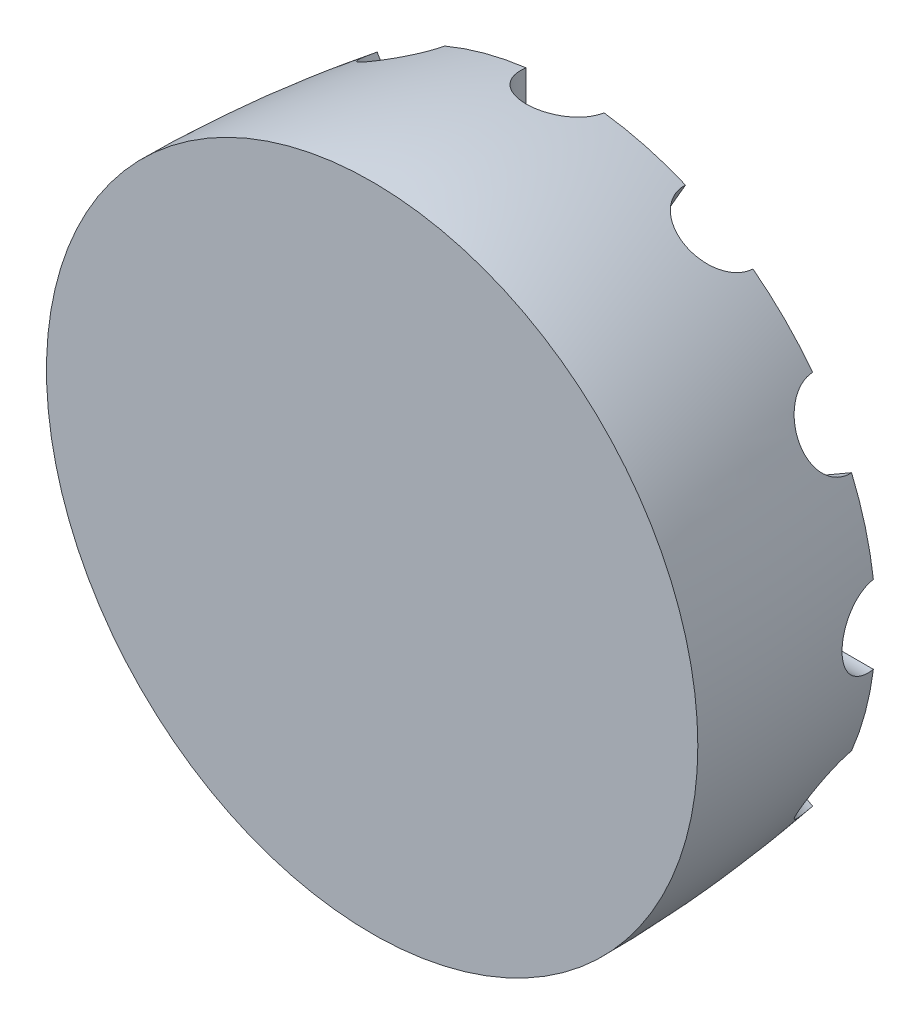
ISO-10303-21;
HEADER;
FILE_DESCRIPTION(('STEP AP214'),'2;1');
FILE_NAME('part.step','',(''),(''),'','','');
FILE_SCHEMA(('AUTOMOTIVE_DESIGN { 1 0 10303 214 1 1 1 1 }'));
ENDSEC;
DATA;
#1=APPLICATION_CONTEXT('core data for automotive mechanical design processes');
#2=APPLICATION_PROTOCOL_DEFINITION('international standard','automotive_design',2000,#1);
#3=PRODUCT_CONTEXT('',#1,'mechanical');
#4=PRODUCT('Part','Part','',(#3));
#5=PRODUCT_RELATED_PRODUCT_CATEGORY('part','',(#4));
#6=PRODUCT_DEFINITION_FORMATION('','',#4);
#7=PRODUCT_DEFINITION_CONTEXT('part definition',#1,'design');
#8=PRODUCT_DEFINITION('design','',#6,#7);
#9=PRODUCT_DEFINITION_SHAPE('','',#8);
#10=(LENGTH_UNIT() NAMED_UNIT(*) SI_UNIT(.MILLI.,.METRE.));
#11=(NAMED_UNIT(*) PLANE_ANGLE_UNIT() SI_UNIT($,.RADIAN.));
#12=(NAMED_UNIT(*) SI_UNIT($,.STERADIAN.) SOLID_ANGLE_UNIT());
#13=UNCERTAINTY_MEASURE_WITH_UNIT(LENGTH_MEASURE(1.E-05),#10,'distance_accuracy_value','');
#14=(GEOMETRIC_REPRESENTATION_CONTEXT(3) GLOBAL_UNCERTAINTY_ASSIGNED_CONTEXT((#13)) GLOBAL_UNIT_ASSIGNED_CONTEXT((#10,
#11,#12)) REPRESENTATION_CONTEXT('',''));
#15=CARTESIAN_POINT('',(0.,0.,0.));
#16=DIRECTION('',(0.,0.,1.));
#17=DIRECTION('',(1.,0.,0.));
#18=AXIS2_PLACEMENT_3D('',#15,#16,#17);
#19=CARTESIAN_POINT('',(-31.496,33.4068915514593,-14.7828));
#20=DIRECTION('',(0.,0.,1.));
#21=DIRECTION('',(1.,0.,0.));
#22=AXIS2_PLACEMENT_3D('',#19,#20,#21);
#23=PLANE('',#22);
#24=DIRECTION('',(-0.86602540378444,0.499999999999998,0.));
#25=VECTOR('',#24,1.);
#26=CARTESIAN_POINT('',(31.0149234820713,-14.4602706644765,-14.7828));
#27=LINE('',#26,#25);
#28=CARTESIAN_POINT('',(11.1383056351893,-2.98449999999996,-14.7828));
#29=VERTEX_POINT('',#28);
#30=CARTESIAN_POINT('',(21.9518672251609,-9.22771269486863,-14.7827999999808));
#31=VERTEX_POINT('',#30);
#32=EDGE_CURVE('E413',#29,#31,#27,.F.);
#33=ORIENTED_EDGE('',*,*,#32,.F.);
#34=DIRECTION('',(-1.,0.,0.));
#35=VECTOR('',#34,1.);
#36=CARTESIAN_POINT('',(24.9555000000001,-2.98449999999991,-14.7828));
#37=LINE('',#36,#35);
#38=CARTESIAN_POINT('',(23.6247310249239,-2.98449999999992,-14.7828));
#39=VERTEX_POINT('',#38);
#40=EDGE_CURVE('E421',#39,#29,#37,.T.);
#41=ORIENTED_EDGE('',*,*,#40,.F.);
#42=CARTESIAN_POINT('',(0.,0.,-14.7828));
#43=DIRECTION('',(0.,0.,1.));
#44=DIRECTION('',(1.,0.,0.));
#45=AXIS2_PLACEMENT_3D('',#42,#43,#44);
#46=CIRCLE('',#45,23.8125);
#47=EDGE_CURVE('E902',#31,#39,#46,.T.);
#48=ORIENTED_EDGE('',*,*,#47,.F.);
#49=EDGE_LOOP('',(#33,#41,#48));
#50=FACE_BOUND('',#49,.T.);
#51=ADVANCED_FACE('F36',(#50),#23,.F.);
#52=DIRECTION('',(-1.,0.,0.));
#53=VECTOR('',#52,1.);
#54=CARTESIAN_POINT('',(24.9555000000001,2.98450000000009,-14.7828));
#55=LINE('',#54,#53);
#56=CARTESIAN_POINT('',(11.1383056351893,2.98450000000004,-14.7828));
#57=VERTEX_POINT('',#56);
#58=CARTESIAN_POINT('',(23.6247310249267,2.98450000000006,-14.7827999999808));
#59=VERTEX_POINT('',#58);
#60=EDGE_CURVE('E418',#57,#59,#55,.F.);
#61=ORIENTED_EDGE('',*,*,#60,.F.);
#62=DIRECTION('',(-0.866025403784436,-0.500000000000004,0.));
#63=VECTOR('',#62,1.);
#64=CARTESIAN_POINT('',(31.0149234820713,14.4602706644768,-14.7828));
#65=LINE('',#64,#63);
#66=CARTESIAN_POINT('',(21.9518672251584,9.22771269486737,-14.7828));
#67=VERTEX_POINT('',#66);
#68=EDGE_CURVE('E426',#67,#57,#65,.T.);
#69=ORIENTED_EDGE('',*,*,#68,.F.);
#70=EDGE_CURVE('E905',#59,#67,#46,.T.);
#71=ORIENTED_EDGE('',*,*,#70,.F.);
#72=EDGE_LOOP('',(#61,#69,#71));
#73=FACE_BOUND('',#72,.T.);
#74=ADVANCED_FACE('F497',(#73),#23,.F.);
#75=DIRECTION('',(-0.866025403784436,-0.500000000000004,0.));
#76=VECTOR('',#75,1.);
#77=CARTESIAN_POINT('',(28.0304234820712,19.6295762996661,-14.7828));
#78=LINE('',#77,#76);
#79=CARTESIAN_POINT('',(8.15380563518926,8.15380563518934,-14.7828));
#80=VERTEX_POINT('',#79);
#81=CARTESIAN_POINT('',(18.9673672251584,14.3970183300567,-14.7828000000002));
#82=VERTEX_POINT('',#81);
#83=EDGE_CURVE('E423',#80,#82,#78,.F.);
#84=ORIENTED_EDGE('',*,*,#83,.F.);
#85=DIRECTION('',(-0.499999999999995,-0.866025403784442,0.));
#86=VECTOR('',#85,1.);
#87=CARTESIAN_POINT('',(19.6295762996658,28.0304234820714,-14.7828));
#88=LINE('',#87,#86);
#89=CARTESIAN_POINT('',(14.3970183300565,18.9673672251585,-14.7828));
#90=VERTEX_POINT('',#89);
#91=EDGE_CURVE('E431',#90,#80,#88,.T.);
#92=ORIENTED_EDGE('',*,*,#91,.F.);
#93=EDGE_CURVE('E839',#82,#90,#46,.T.);
#94=ORIENTED_EDGE('',*,*,#93,.F.);
#95=EDGE_LOOP('',(#84,#92,#94));
#96=FACE_BOUND('',#95,.T.);
#97=ADVANCED_FACE('F502',(#96),#23,.F.);
#98=DIRECTION('',(-0.499999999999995,-0.866025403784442,0.));
#99=VECTOR('',#98,1.);
#100=CARTESIAN_POINT('',(14.4602706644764,31.0149234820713,-14.7828));
#101=LINE('',#100,#99);
#102=CARTESIAN_POINT('',(2.9845,11.1383056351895,-14.7828));
#103=VERTEX_POINT('',#102);
#104=CARTESIAN_POINT('',(9.22771269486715,21.9518672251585,-14.7828000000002));
#105=VERTEX_POINT('',#104);
#106=EDGE_CURVE('E428',#103,#105,#101,.F.);
#107=ORIENTED_EDGE('',*,*,#106,.F.);
#108=DIRECTION('',(0.,-1.,0.));
#109=VECTOR('',#108,1.);
#110=CARTESIAN_POINT('',(2.9845,24.9555,-14.7828));
#111=LINE('',#110,#109);
#112=CARTESIAN_POINT('',(2.9845,23.6247310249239,-14.7828));
#113=VERTEX_POINT('',#112);
#114=EDGE_CURVE('E436',#113,#103,#111,.T.);
#115=ORIENTED_EDGE('',*,*,#114,.F.);
#116=EDGE_CURVE('E410',#105,#113,#46,.T.);
#117=ORIENTED_EDGE('',*,*,#116,.F.);
#118=EDGE_LOOP('',(#107,#115,#117));
#119=FACE_BOUND('',#118,.T.);
#120=ADVANCED_FACE('F799',(#119),#23,.F.);
#121=DIRECTION('',(0.,-1.,0.));
#122=VECTOR('',#121,1.);
#123=CARTESIAN_POINT('',(-2.9845,24.9555,-14.7828));
#124=LINE('',#123,#122);
#125=CARTESIAN_POINT('',(-2.9845,11.1383056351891,-14.7828));
#126=VERTEX_POINT('',#125);
#127=CARTESIAN_POINT('',(-2.9845,23.6247310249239,-14.7828));
#128=VERTEX_POINT('',#127);
#129=EDGE_CURVE('E433',#126,#128,#124,.F.);
#130=ORIENTED_EDGE('',*,*,#129,.F.);
#131=DIRECTION('',(0.500000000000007,-0.866025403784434,0.));
#132=VECTOR('',#131,1.);
#133=CARTESIAN_POINT('',(-14.4602706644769,31.0149234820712,-14.7828));
#134=LINE('',#133,#132);
#135=CARTESIAN_POINT('',(-9.22771269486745,21.9518672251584,-14.7828));
#136=VERTEX_POINT('',#135);
#137=EDGE_CURVE('E441',#136,#126,#134,.T.);
#138=ORIENTED_EDGE('',*,*,#137,.F.);
#139=EDGE_CURVE('E407',#128,#136,#46,.T.);
#140=ORIENTED_EDGE('',*,*,#139,.F.);
#141=EDGE_LOOP('',(#130,#138,#140));
#142=FACE_BOUND('',#141,.T.);
#143=ADVANCED_FACE('F791',(#142),#23,.F.);
#144=DIRECTION('',(0.500000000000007,-0.866025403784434,0.));
#145=VECTOR('',#144,1.);
#146=CARTESIAN_POINT('',(-19.6295762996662,28.0304234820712,-14.7828));
#147=LINE('',#146,#145);
#148=CARTESIAN_POINT('',(-8.15380563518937,8.15380563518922,-14.7828));
#149=VERTEX_POINT('',#148);
#150=CARTESIAN_POINT('',(-14.3970183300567,18.9673672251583,-14.7828000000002));
#151=VERTEX_POINT('',#150);
#152=EDGE_CURVE('E438',#149,#151,#147,.F.);
#153=ORIENTED_EDGE('',*,*,#152,.F.);
#154=DIRECTION('',(0.866025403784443,-0.499999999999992,0.));
#155=VECTOR('',#154,1.);
#156=CARTESIAN_POINT('',(-28.0304234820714,19.6295762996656,-14.7828));
#157=LINE('',#156,#155);
#158=CARTESIAN_POINT('',(-18.9673672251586,14.3970183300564,-14.7828));
#159=VERTEX_POINT('',#158);
#160=EDGE_CURVE('E446',#159,#149,#157,.T.);
#161=ORIENTED_EDGE('',*,*,#160,.F.);
#162=EDGE_CURVE('E409',#151,#159,#46,.T.);
#163=ORIENTED_EDGE('',*,*,#162,.F.);
#164=EDGE_LOOP('',(#153,#161,#163));
#165=FACE_BOUND('',#164,.T.);
#166=ADVANCED_FACE('F783',(#165),#23,.F.);
#167=DIRECTION('',(0.866025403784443,-0.499999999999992,0.));
#168=VECTOR('',#167,1.);
#169=CARTESIAN_POINT('',(-31.0149234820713,14.4602706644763,-14.7828));
#170=LINE('',#169,#168);
#171=CARTESIAN_POINT('',(-11.1383056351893,2.98449999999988,-14.7828));
#172=VERTEX_POINT('',#171);
#173=CARTESIAN_POINT('',(-21.9518672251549,9.22771269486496,-14.7828000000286));
#174=VERTEX_POINT('',#173);
#175=EDGE_CURVE('E443',#172,#174,#170,.F.);
#176=ORIENTED_EDGE('',*,*,#175,.F.);
#177=DIRECTION('',(1.,0.,0.));
#178=VECTOR('',#177,1.);
#179=CARTESIAN_POINT('',(-24.9555000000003,2.98449999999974,-14.7828));
#180=LINE('',#179,#178);
#181=CARTESIAN_POINT('',(-23.6247310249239,2.98449999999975,-14.7828));
#182=VERTEX_POINT('',#181);
#183=EDGE_CURVE('E451',#182,#172,#180,.T.);
#184=ORIENTED_EDGE('',*,*,#183,.F.);
#185=EDGE_CURVE('E868',#174,#182,#46,.T.);
#186=ORIENTED_EDGE('',*,*,#185,.F.);
#187=EDGE_LOOP('',(#176,#184,#186));
#188=FACE_BOUND('',#187,.T.);
#189=ADVANCED_FACE('F775',(#188),#23,.F.);
#190=DIRECTION('',(1.,0.,0.));
#191=VECTOR('',#190,1.);
#192=CARTESIAN_POINT('',(-24.9555000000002,-2.98450000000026,-14.7828));
#193=LINE('',#192,#191);
#194=CARTESIAN_POINT('',(-11.1383056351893,-2.98450000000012,-14.7828));
#195=VERTEX_POINT('',#194);
#196=CARTESIAN_POINT('',(-23.6247310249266,-2.98450000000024,-14.7827999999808));
#197=VERTEX_POINT('',#196);
#198=EDGE_CURVE('E448',#195,#197,#193,.F.);
#199=ORIENTED_EDGE('',*,*,#198,.F.);
#200=DIRECTION('',(0.866025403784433,0.50000000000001,0.));
#201=VECTOR('',#200,1.);
#202=CARTESIAN_POINT('',(-31.0149234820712,-14.460270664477,-14.7828));
#203=LINE('',#202,#201);
#204=CARTESIAN_POINT('',(-21.9518672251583,-9.22771269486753,-14.7828));
#205=VERTEX_POINT('',#204);
#206=EDGE_CURVE('E454',#205,#195,#203,.T.);
#207=ORIENTED_EDGE('',*,*,#206,.F.);
#208=EDGE_CURVE('E949',#197,#205,#46,.T.);
#209=ORIENTED_EDGE('',*,*,#208,.F.);
#210=EDGE_LOOP('',(#199,#207,#209));
#211=FACE_BOUND('',#210,.T.);
#212=ADVANCED_FACE('F767',(#211),#23,.F.);
#213=DIRECTION('',(-0.500000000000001,0.866025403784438,0.));
#214=VECTOR('',#213,1.);
#215=CARTESIAN_POINT('',(19.629576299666,-28.0304234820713,-14.7828));
#216=LINE('',#215,#214);
#217=CARTESIAN_POINT('',(8.15380563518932,-8.1538056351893,-14.7828));
#218=VERTEX_POINT('',#217);
#219=CARTESIAN_POINT('',(14.3970183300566,-18.9673672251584,-14.7828000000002));
#220=VERTEX_POINT('',#219);
#221=EDGE_CURVE('E456',#218,#220,#216,.F.);
#222=ORIENTED_EDGE('',*,*,#221,.F.);
#223=DIRECTION('',(-0.86602540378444,0.499999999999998,0.));
#224=VECTOR('',#223,1.);
#225=CARTESIAN_POINT('',(28.0304234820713,-19.6295762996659,-14.7828));
#226=LINE('',#225,#224);
#227=CARTESIAN_POINT('',(18.9673672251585,-14.3970183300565,-14.7828));
#228=VERTEX_POINT('',#227);
#229=EDGE_CURVE('E416',#228,#218,#226,.T.);
#230=ORIENTED_EDGE('',*,*,#229,.F.);
#231=EDGE_CURVE('E901',#220,#228,#46,.T.);
#232=ORIENTED_EDGE('',*,*,#231,.F.);
#233=EDGE_LOOP('',(#222,#230,#232));
#234=FACE_BOUND('',#233,.T.);
#235=ADVANCED_FACE('F759',(#234),#23,.F.);
#236=DIRECTION('',(0.,1.,0.));
#237=VECTOR('',#236,1.);
#238=CARTESIAN_POINT('',(2.9845,-24.9555,-14.7828));
#239=LINE('',#238,#237);
#240=CARTESIAN_POINT('',(2.9845,-11.1383056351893,-14.7828));
#241=VERTEX_POINT('',#240);
#242=CARTESIAN_POINT('',(2.98450000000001,-23.6247310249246,-14.7827999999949));
#243=VERTEX_POINT('',#242);
#244=EDGE_CURVE('E258',#241,#243,#239,.F.);
#245=ORIENTED_EDGE('',*,*,#244,.F.);
#246=DIRECTION('',(-0.500000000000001,0.866025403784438,0.));
#247=VECTOR('',#246,1.);
#248=CARTESIAN_POINT('',(14.4602706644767,-31.0149234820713,-14.7828));
#249=LINE('',#248,#247);
#250=CARTESIAN_POINT('',(9.2277126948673,-21.9518672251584,-14.7828));
#251=VERTEX_POINT('',#250);
#252=EDGE_CURVE('E459',#251,#241,#249,.T.);
#253=ORIENTED_EDGE('',*,*,#252,.F.);
#254=EDGE_CURVE('E249',#243,#251,#46,.T.);
#255=ORIENTED_EDGE('',*,*,#254,.F.);
#256=EDGE_LOOP('',(#245,#253,#255));
#257=FACE_BOUND('',#256,.T.);
#258=ADVANCED_FACE('F752',(#257),#23,.F.);
#259=DIRECTION('',(0.499999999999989,0.866025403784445,0.));
#260=VECTOR('',#259,1.);
#261=CARTESIAN_POINT('',(-14.4602706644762,-31.0149234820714,-14.7828));
#262=LINE('',#261,#260);
#263=CARTESIAN_POINT('',(-2.9845,-11.1383056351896,-14.7828));
#264=VERTEX_POINT('',#263);
#265=CARTESIAN_POINT('',(-9.22771269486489,-21.9518672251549,-14.7828000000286));
#266=VERTEX_POINT('',#265);
#267=EDGE_CURVE('E254',#264,#266,#262,.F.);
#268=ORIENTED_EDGE('',*,*,#267,.F.);
#269=DIRECTION('',(0.,1.,0.));
#270=VECTOR('',#269,1.);
#271=CARTESIAN_POINT('',(-2.9845,-24.9555,-14.7828));
#272=LINE('',#271,#270);
#273=CARTESIAN_POINT('',(-2.9845,-23.6247310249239,-14.7828));
#274=VERTEX_POINT('',#273);
#275=EDGE_CURVE('E252',#274,#264,#272,.T.);
#276=ORIENTED_EDGE('',*,*,#275,.F.);
#277=EDGE_CURVE('E239',#266,#274,#46,.T.);
#278=ORIENTED_EDGE('',*,*,#277,.F.);
#279=EDGE_LOOP('',(#268,#276,#278));
#280=FACE_BOUND('',#279,.T.);
#281=ADVANCED_FACE('F253',(#280),#23,.F.);
#282=DIRECTION('',(0.866025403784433,0.50000000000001,0.));
#283=VECTOR('',#282,1.);
#284=CARTESIAN_POINT('',(-28.0304234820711,-19.6295762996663,-14.7828));
#285=LINE('',#284,#283);
#286=CARTESIAN_POINT('',(-8.1538056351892,-8.1538056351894,-14.7828));
#287=VERTEX_POINT('',#286);
#288=CARTESIAN_POINT('',(-18.9673672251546,-14.3970183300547,-14.7828000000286));
#289=VERTEX_POINT('',#288);
#290=EDGE_CURVE('E387',#287,#289,#285,.F.);
#291=ORIENTED_EDGE('',*,*,#290,.F.);
#292=DIRECTION('',(0.499999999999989,0.866025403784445,0.));
#293=VECTOR('',#292,1.);
#294=CARTESIAN_POINT('',(-19.6295762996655,-28.0304234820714,-14.7828));
#295=LINE('',#294,#293);
#296=CARTESIAN_POINT('',(-14.3970183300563,-18.9673672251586,-14.7828));
#297=VERTEX_POINT('',#296);
#298=EDGE_CURVE('E393',#297,#287,#295,.T.);
#299=ORIENTED_EDGE('',*,*,#298,.F.);
#300=EDGE_CURVE('E250',#289,#297,#46,.T.);
#301=ORIENTED_EDGE('',*,*,#300,.F.);
#302=EDGE_LOOP('',(#291,#299,#301));
#303=FACE_BOUND('',#302,.T.);
#304=ADVANCED_FACE('F495',(#303),#23,.F.);
#305=DIRECTION('',(0.866025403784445,-0.499999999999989,0.));
#306=VECTOR('',#305,1.);
#307=CARTESIAN_POINT('',(-4.4449999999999,-7.69896583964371,-14.7828));
#308=LINE('',#307,#306);
#309=CARTESIAN_POINT('',(-6.50793167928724,-6.5079316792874,-14.7828));
#310=VERTEX_POINT('',#309);
#311=CARTESIAN_POINT('',(-2.38206832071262,-8.89,-14.7828));
#312=VERTEX_POINT('',#311);
#313=EDGE_CURVE('E400',#310,#312,#308,.T.);
#314=ORIENTED_EDGE('',*,*,#313,.F.);
#315=DIRECTION('',(0.50000000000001,-0.866025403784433,0.));
#316=VECTOR('',#315,1.);
#317=CARTESIAN_POINT('',(-7.69896583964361,-4.44500000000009,-14.7828));
#318=LINE('',#317,#316);
#319=CARTESIAN_POINT('',(-8.88999999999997,-2.38206832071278,-14.7828));
#320=VERTEX_POINT('',#319);
#321=EDGE_CURVE('E402',#320,#310,#318,.T.);
#322=ORIENTED_EDGE('',*,*,#321,.F.);
#323=DIRECTION('',(0.,-1.,0.));
#324=VECTOR('',#323,1.);
#325=CARTESIAN_POINT('',(-8.89,0.,-14.7828));
#326=LINE('',#325,#324);
#327=CARTESIAN_POINT('',(-8.89000000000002,2.38206832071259,-14.7828));
#328=VERTEX_POINT('',#327);
#329=EDGE_CURVE('E405',#328,#320,#326,.T.);
#330=ORIENTED_EDGE('',*,*,#329,.F.);
#331=DIRECTION('',(-0.499999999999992,-0.866025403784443,0.));
#332=VECTOR('',#331,1.);
#333=CARTESIAN_POINT('',(-7.6989658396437,4.44499999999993,-14.7828));
#334=LINE('',#333,#332);
#335=CARTESIAN_POINT('',(-6.50793167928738,6.50793167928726,-14.7828));
#336=VERTEX_POINT('',#335);
#337=EDGE_CURVE('E478',#336,#328,#334,.T.);
#338=ORIENTED_EDGE('',*,*,#337,.F.);
#339=DIRECTION('',(-0.866025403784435,-0.500000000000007,0.));
#340=VECTOR('',#339,1.);
#341=CARTESIAN_POINT('',(-4.44500000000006,7.69896583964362,-14.7828));
#342=LINE('',#341,#340);
#343=CARTESIAN_POINT('',(-2.38206832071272,8.89,-14.7828));
#344=VERTEX_POINT('',#343);
#345=EDGE_CURVE('E476',#344,#336,#342,.T.);
#346=ORIENTED_EDGE('',*,*,#345,.F.);
#347=DIRECTION('',(-1.,0.,0.));
#348=VECTOR('',#347,1.);
#349=CARTESIAN_POINT('',(0.,8.89,-14.7828));
#350=LINE('',#349,#348);
#351=CARTESIAN_POINT('',(2.38206832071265,8.89,-14.7828));
#352=VERTEX_POINT('',#351);
#353=EDGE_CURVE('E474',#352,#344,#350,.T.);
#354=ORIENTED_EDGE('',*,*,#353,.F.);
#355=DIRECTION('',(-0.866025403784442,0.499999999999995,0.));
#356=VECTOR('',#355,1.);
#357=CARTESIAN_POINT('',(4.44499999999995,7.69896583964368,-14.7828));
#358=LINE('',#357,#356);
#359=CARTESIAN_POINT('',(6.50793167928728,6.50793167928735,-14.7828));
#360=VERTEX_POINT('',#359);
#361=EDGE_CURVE('E472',#360,#352,#358,.T.);
#362=ORIENTED_EDGE('',*,*,#361,.F.);
#363=DIRECTION('',(-0.500000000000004,0.866025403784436,0.));
#364=VECTOR('',#363,1.);
#365=CARTESIAN_POINT('',(7.69896583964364,4.44500000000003,-14.7828));
#366=LINE('',#365,#364);
#367=CARTESIAN_POINT('',(8.88999999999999,2.38206832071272,-14.7828));
#368=VERTEX_POINT('',#367);
#369=EDGE_CURVE('E470',#368,#360,#366,.T.);
#370=ORIENTED_EDGE('',*,*,#369,.F.);
#371=DIRECTION('',(0.,1.,0.));
#372=VECTOR('',#371,1.);
#373=CARTESIAN_POINT('',(8.89,0.,-14.7828));
#374=LINE('',#373,#372);
#375=CARTESIAN_POINT('',(8.89000000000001,-2.38206832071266,-14.7828));
#376=VERTEX_POINT('',#375);
#377=EDGE_CURVE('E468',#376,#368,#374,.T.);
#378=ORIENTED_EDGE('',*,*,#377,.F.);
#379=DIRECTION('',(0.499999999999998,0.86602540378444,0.));
#380=VECTOR('',#379,1.);
#381=CARTESIAN_POINT('',(7.69896583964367,-4.44499999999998,-14.7828));
#382=LINE('',#381,#380);
#383=CARTESIAN_POINT('',(6.50793167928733,-6.50793167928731,-14.7828));
#384=VERTEX_POINT('',#383);
#385=EDGE_CURVE('E466',#384,#376,#382,.T.);
#386=ORIENTED_EDGE('',*,*,#385,.F.);
#387=DIRECTION('',(0.866025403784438,0.500000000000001,0.));
#388=VECTOR('',#387,1.);
#389=CARTESIAN_POINT('',(4.44500000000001,-7.69896583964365,-14.7828));
#390=LINE('',#389,#388);
#391=CARTESIAN_POINT('',(2.38206832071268,-8.89,-14.7828));
#392=VERTEX_POINT('',#391);
#393=EDGE_CURVE('E461',#392,#384,#390,.T.);
#394=ORIENTED_EDGE('',*,*,#393,.F.);
#395=DIRECTION('',(1.,0.,0.));
#396=VECTOR('',#395,1.);
#397=CARTESIAN_POINT('',(0.,-8.89,-14.7828));
#398=LINE('',#397,#396);
#399=EDGE_CURVE('E257',#312,#392,#398,.T.);
#400=ORIENTED_EDGE('',*,*,#399,.F.);
#401=EDGE_LOOP('',(#314,#322,#330,#338,#346,#354,#362,#370,#378,#386,#394,#400));
#402=FACE_BOUND('',#401,.T.);
#403=ADVANCED_FACE('F486',(#402),#23,.F.);
#404=CARTESIAN_POINT('',(0.,24.9555,0.));
#405=DIRECTION('',(0.,0.,-1.));
#406=DIRECTION('',(-1.,0.,0.));
#407=AXIS2_PLACEMENT_3D('',#404,#405,#406);
#408=PLANE('',#407);
#409=CARTESIAN_POINT('',(0.,0.,0.));
#410=DIRECTION('',(0.,0.,1.));
#411=DIRECTION('',(1.,0.,0.));
#412=AXIS2_PLACEMENT_3D('',#409,#410,#411);
#413=CIRCLE('',#412,24.9555);
#414=CARTESIAN_POINT('',(24.9555,0.,0.));
#415=VERTEX_POINT('',#414);
#416=EDGE_CURVE('E265',#415,#415,#413,.T.);
#417=ORIENTED_EDGE('',*,*,#416,.T.);
#418=EDGE_LOOP('',(#417));
#419=FACE_BOUND('',#418,.T.);
#420=ADVANCED_FACE('F494',(#419),#408,.F.);
#421=CARTESIAN_POINT('',(17.0449234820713,-29.5226734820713,-14.7828));
#422=DIRECTION('',(-0.500000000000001,0.866025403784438,0.));
#423=DIRECTION('',(-0.866025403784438,-0.500000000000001,0.));
#424=AXIS2_PLACEMENT_3D('',#421,#422,#423);
#425=CYLINDRICAL_SURFACE('',#424,2.9845);
#426=CARTESIAN_POINT('',(0.,0.,-14.7828));
#427=DIRECTION('',(0.707106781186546,0.707106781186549,0.));
#428=DIRECTION('',(-0.707106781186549,0.707106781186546,0.));
#429=AXIS2_PLACEMENT_3D('',#426,#427,#428);
#430=ELLIPSE('',#429,11.5312225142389,2.9845);
#431=CARTESIAN_POINT('',(6.50793167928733,-6.50793167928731,-12.9847480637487));
#432=VERTEX_POINT('',#431);
#433=EDGE_CURVE('E312',#432,#218,#430,.T.);
#434=ORIENTED_EDGE('',*,*,#433,.T.);
#435=ORIENTED_EDGE('',*,*,#221,.T.);
#436=CARTESIAN_POINT('',(9.2277126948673,-21.9518672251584,-14.7828));
#437=CARTESIAN_POINT('',(9.23396939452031,-21.9627068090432,-14.697730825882));
#438=CARTESIAN_POINT('',(9.24355845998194,-21.9720360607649,-14.6127280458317));
#439=CARTESIAN_POINT('',(9.26929879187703,-21.9876134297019,-14.4434267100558));
#440=CARTESIAN_POINT('',(9.28545043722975,-21.993861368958,-14.359128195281));
#441=CARTESIAN_POINT('',(9.32418719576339,-22.0032175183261,-14.1917701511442));
#442=CARTESIAN_POINT('',(9.34677749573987,-22.006323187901,-14.1087116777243));
#443=CARTESIAN_POINT('',(9.3981995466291,-22.0093381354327,-13.9444316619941));
#444=CARTESIAN_POINT('',(9.42703682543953,-22.0092445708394,-13.8632118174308));
#445=CARTESIAN_POINT('',(9.52246906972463,-22.0040915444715,-13.6234918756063));
#446=CARTESIAN_POINT('',(9.59807237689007,-21.9941809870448,-13.4685545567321));
#447=CARTESIAN_POINT('',(9.77091856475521,-21.9611490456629,-13.172796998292));
#448=CARTESIAN_POINT('',(9.86816135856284,-21.9380277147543,-13.0319767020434));
#449=CARTESIAN_POINT('',(10.0280923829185,-21.8934332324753,-12.8341395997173));
#450=CARTESIAN_POINT('',(10.083891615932,-21.8768668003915,-12.7702950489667));
#451=CARTESIAN_POINT('',(10.199711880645,-21.8404557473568,-12.6476531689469));
#452=CARTESIAN_POINT('',(10.2597288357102,-21.8206142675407,-12.5888510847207));
#453=CARTESIAN_POINT('',(10.3835923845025,-21.7776823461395,-12.4766668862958));
#454=CARTESIAN_POINT('',(10.447440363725,-21.7545907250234,-12.4232867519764));
#455=CARTESIAN_POINT('',(10.5784487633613,-21.7052460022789,-12.3223784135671));
#456=CARTESIAN_POINT('',(10.6456098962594,-21.6789922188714,-12.2748514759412));
#457=CARTESIAN_POINT('',(10.8493253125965,-21.5964259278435,-12.1429328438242));
#458=CARTESIAN_POINT('',(10.9900274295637,-21.5356489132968,-12.0674746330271));
#459=CARTESIAN_POINT('',(11.2779578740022,-21.4033832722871,-11.9433722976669));
#460=CARTESIAN_POINT('',(11.4251850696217,-21.331896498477,-11.8947235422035));
#461=CARTESIAN_POINT('',(11.7178728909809,-21.181879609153,-11.8267183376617));
#462=CARTESIAN_POINT('',(11.8632826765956,-21.1035758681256,-11.8066458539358));
#463=CARTESIAN_POINT('',(12.1516709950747,-20.9405782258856,-11.7941781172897));
#464=CARTESIAN_POINT('',(12.2946497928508,-20.8558850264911,-11.8017798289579));
#465=CARTESIAN_POINT('',(12.5719000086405,-20.6839667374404,-11.8440624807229));
#466=CARTESIAN_POINT('',(12.7062706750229,-20.596799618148,-11.87833049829));
#467=CARTESIAN_POINT('',(12.9650330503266,-20.4214052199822,-11.9723258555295));
#468=CARTESIAN_POINT('',(13.0894244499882,-20.3331779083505,-12.0320539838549));
#469=CARTESIAN_POINT('',(13.3261200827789,-20.1576982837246,-12.1757195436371));
#470=CARTESIAN_POINT('',(13.4383136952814,-20.0704604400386,-12.2598566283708));
#471=CARTESIAN_POINT('',(13.6468046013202,-19.9005141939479,-12.4496417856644));
#472=CARTESIAN_POINT('',(13.7430999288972,-19.8178063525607,-12.5552925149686));
#473=CARTESIAN_POINT('',(13.919859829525,-19.6576422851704,-12.7879670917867));
#474=CARTESIAN_POINT('',(13.9998826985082,-19.5803625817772,-12.9154480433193));
#475=CARTESIAN_POINT('',(14.1394119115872,-19.4359297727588,-13.1863798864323));
#476=CARTESIAN_POINT('',(14.1989156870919,-19.3687779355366,-13.3298327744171));
#477=CARTESIAN_POINT('',(14.2971655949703,-19.2456634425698,-13.6318944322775));
#478=CARTESIAN_POINT('',(14.335469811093,-19.1899532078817,-13.7907501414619));
#479=CARTESIAN_POINT('',(14.3886101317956,-19.0934737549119,-14.1167158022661));
#480=CARTESIAN_POINT('',(14.4034458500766,-19.0527047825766,-14.2838258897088));
#481=CARTESIAN_POINT('',(14.4092826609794,-18.987563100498,-14.6219685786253));
#482=CARTESIAN_POINT('',(14.4002376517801,-18.9632222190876,-14.7930081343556));
#483=CARTESIAN_POINT('',(14.358307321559,-18.9319112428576,-15.1337522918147));
#484=CARTESIAN_POINT('',(14.3254235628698,-18.9249400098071,-15.3034569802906));
#485=CARTESIAN_POINT('',(14.2369607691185,-18.9283594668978,-15.6344820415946));
#486=CARTESIAN_POINT('',(14.1816586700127,-18.9385429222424,-15.7958785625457));
#487=CARTESIAN_POINT('',(14.0495887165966,-18.9752388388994,-16.1076578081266));
#488=CARTESIAN_POINT('',(13.9728220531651,-19.001750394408,-16.2580411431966));
#489=CARTESIAN_POINT('',(13.8005933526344,-19.0694817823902,-16.5417523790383));
#490=CARTESIAN_POINT('',(13.7053414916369,-19.1105401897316,-16.6752464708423));
#491=CARTESIAN_POINT('',(13.497988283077,-19.205713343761,-16.9231266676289));
#492=CARTESIAN_POINT('',(13.3858874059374,-19.2598277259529,-17.0375133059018));
#493=CARTESIAN_POINT('',(13.1482816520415,-19.37877202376,-17.2433407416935));
#494=CARTESIAN_POINT('',(13.0228412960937,-19.4435511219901,-17.3348854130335));
#495=CARTESIAN_POINT('',(12.7614375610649,-19.5817193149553,-17.4930634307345));
#496=CARTESIAN_POINT('',(12.6254742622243,-19.6551083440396,-17.5596969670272));
#497=CARTESIAN_POINT('',(12.3468371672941,-19.8079996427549,-17.666075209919));
#498=CARTESIAN_POINT('',(12.2041701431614,-19.8874957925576,-17.7058464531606));
#499=CARTESIAN_POINT('',(11.9159335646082,-20.0502060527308,-17.7574633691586));
#500=CARTESIAN_POINT('',(11.7703640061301,-20.1334201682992,-17.7693090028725));
#501=CARTESIAN_POINT('',(11.4804211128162,-20.3011425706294,-17.7647344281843));
#502=CARTESIAN_POINT('',(11.3360477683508,-20.3856508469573,-17.7483144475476));
#503=CARTESIAN_POINT('',(11.0526427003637,-20.5536475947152,-17.687680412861));
#504=CARTESIAN_POINT('',(10.913610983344,-20.6371360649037,-17.6434663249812));
#505=CARTESIAN_POINT('',(10.6449637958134,-20.8009488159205,-17.5285145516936));
#506=CARTESIAN_POINT('',(10.5153484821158,-20.881273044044,-17.4577764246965));
#507=CARTESIAN_POINT('',(10.2694232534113,-21.0368251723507,-17.2918200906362));
#508=CARTESIAN_POINT('',(10.1531127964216,-21.1120532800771,-17.1966028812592));
#509=CARTESIAN_POINT('',(9.93735720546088,-21.2557348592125,-16.9844557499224));
#510=CARTESIAN_POINT('',(9.8379104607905,-21.3241889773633,-16.8675279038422));
#511=CARTESIAN_POINT('',(9.65894421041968,-21.4529421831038,-16.6153159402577));
#512=CARTESIAN_POINT('',(9.5794292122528,-21.5132394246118,-16.480027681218));
#513=CARTESIAN_POINT('',(9.44276425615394,-21.6246013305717,-16.1948678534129));
#514=CARTESIAN_POINT('',(9.38564639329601,-21.6756526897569,-16.0449757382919));
#515=CARTESIAN_POINT('',(9.29579241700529,-21.7674930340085,-15.7352166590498));
#516=CARTESIAN_POINT('',(9.26302919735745,-21.8082933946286,-15.575360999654));
#517=CARTESIAN_POINT('',(9.23007012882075,-21.866181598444,-15.3092718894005));
#518=CARTESIAN_POINT('',(9.22237579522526,-21.8865050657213,-15.2045930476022));
#519=CARTESIAN_POINT('',(9.21731240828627,-21.9226177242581,-14.9941753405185));
#520=CARTESIAN_POINT('',(9.21994330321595,-21.9384069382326,-14.8884364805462));
#521=CARTESIAN_POINT('',(9.2277126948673,-21.9518672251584,-14.7828));
#522=B_SPLINE_CURVE_WITH_KNOTS('',3,(#436,#437,#438,#439,#440,#441,#442,#443,#444,#445,#446,
#447,#448,#449,#450,#451,#452,#453,#454,#455,#456,#457,#458,#459,#460,#461,#462,#463,#464,#465,
#466,#467,#468,#469,#470,#471,#472,#473,#474,#475,#476,#477,#478,#479,#480,#481,#482,#483,#484,
#485,#486,#487,#488,#489,#490,#491,#492,#493,#494,#495,#496,#497,#498,#499,#500,#501,#502,#503,
#504,#505,#506,#507,#508,#509,#510,#511,#512,#513,#514,#515,#516,#517,#518,#519,#520,#521),
.UNSPECIFIED.,.T.,.F.,(4,2,2,2,2,2,2,2,2,2,2,2,2,2,2,2,2,2,2,2,2,2,2,2,2,2,2,2,2,2,2,2,2,2,2,2,
2,2,2,2,2,2,4),(0.,0.257853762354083,0.515722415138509,0.773799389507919,1.0321056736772,
1.54757042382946,2.06303310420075,2.32195622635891,2.58063244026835,2.83940277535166,
3.09822900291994,3.60799596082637,4.11767483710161,4.61434331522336,5.11095731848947,
5.60003075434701,6.08911934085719,6.58232701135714,7.07559562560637,7.58085440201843,
8.08617640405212,8.60166951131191,9.11717110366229,9.63366860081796,10.1501322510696,
10.6604014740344,11.1706423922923,11.6753899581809,12.1801234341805,12.6825179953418,
13.1849087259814,13.6868024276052,14.1886968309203,14.6905871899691,15.1924781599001,
15.694377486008,16.1962563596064,16.698087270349,17.2000315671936,17.7026925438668,
18.2047932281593,18.5249902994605,18.8451857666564),.UNSPECIFIED.);
#523=EDGE_CURVE('E893',#251,#220,#522,.T.);
#524=ORIENTED_EDGE('',*,*,#523,.F.);
#525=ORIENTED_EDGE('',*,*,#252,.T.);
#526=CARTESIAN_POINT('',(0.,0.,-14.7828));
#527=DIRECTION('',(0.965925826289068,0.258819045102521,0.));
#528=DIRECTION('',(-0.258819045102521,0.965925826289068,0.));
#529=AXIS2_PLACEMENT_3D('',#526,#527,#528);
#530=ELLIPSE('',#529,11.5312225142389,2.9845);
#531=CARTESIAN_POINT('',(2.38206832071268,-8.89,-12.9847480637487));
#532=VERTEX_POINT('',#531);
#533=EDGE_CURVE('E304',#532,#241,#530,.T.);
#534=ORIENTED_EDGE('',*,*,#533,.F.);
#535=CARTESIAN_POINT('',(4.44500000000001,-7.69896583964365,-14.7828));
#536=DIRECTION('',(-0.500000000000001,0.866025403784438,0.));
#537=DIRECTION('',(0.,0.,1.));
#538=AXIS2_PLACEMENT_3D('',#535,#536,#537);
#539=CIRCLE('',#538,2.9845);
#540=EDGE_CURVE('E309',#532,#432,#539,.T.);
#541=ORIENTED_EDGE('',*,*,#540,.T.);
#542=EDGE_LOOP('',(#434,#435,#524,#525,#534,#541));
#543=FACE_BOUND('',#542,.T.);
#544=ADVANCED_FACE('F284',(#543),#425,.F.);
#545=CARTESIAN_POINT('',(0.,0.,-44.45));
#546=CARTESIAN_POINT('',(0.,5.96848817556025,-44.45));
#547=CARTESIAN_POINT('',(0.,13.4271545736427,-39.4810967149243));
#548=CARTESIAN_POINT('',(0.,19.66408736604,-29.2641108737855));
#549=CARTESIAN_POINT('',(0.,22.7476422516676,-21.345045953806));
#550=CARTESIAN_POINT('',(0.,24.3795613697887,-11.6371238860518));
#551=CARTESIAN_POINT('',(0.,24.9555,-4.85205528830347));
#552=CARTESIAN_POINT('',(0.,24.9555,0.));
#553=B_SPLINE_CURVE_WITH_KNOTS('',3,(#545,#546,#547,#548,#549,#550,#551,#552),.UNSPECIFIED.,.F.,
.F.,(4,1,1,1,1,4),(0.,0.27662534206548,0.467743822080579,0.638682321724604,0.732745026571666,
1.),.UNSPECIFIED.);
#554=CARTESIAN_POINT('',(0.,0.,0.));
#555=DIRECTION('',(0.,0.,1.));
#556=AXIS1_PLACEMENT('',#554,#555);
#557=SURFACE_OF_REVOLUTION('',#553,#556);
#558=ORIENTED_EDGE('',*,*,#416,.F.);
#559=EDGE_LOOP('',(#558));
#560=FACE_BOUND('',#559,.T.);
#561=CARTESIAN_POINT('',(0.,23.3213584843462,-17.7673));
#562=CARTESIAN_POINT('',(0.167336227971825,23.3213580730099,-17.7672928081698));
#563=CARTESIAN_POINT('',(0.334784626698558,23.3222166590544,-17.7531799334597));
#564=CARTESIAN_POINT('',(0.665059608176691,23.3257110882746,-17.6970842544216));
#565=CARTESIAN_POINT('',(0.827880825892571,23.3283489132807,-17.6550703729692));
#566=CARTESIAN_POINT('',(1.14408427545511,23.3355746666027,-17.5443839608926));
#567=CARTESIAN_POINT('',(1.29747062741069,23.3401617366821,-17.4757231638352));
#568=CARTESIAN_POINT('',(1.59047390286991,23.3515496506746,-17.3137391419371));
#569=CARTESIAN_POINT('',(1.73009402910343,23.3583499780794,-17.2204216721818));
#570=CARTESIAN_POINT('',(1.99166889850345,23.3744899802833,-17.0118089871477));
#571=CARTESIAN_POINT('',(2.11362211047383,23.3838298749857,-16.8965118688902));
#572=CARTESIAN_POINT('',(2.336418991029,23.4053829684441,-16.6472906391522));
#573=CARTESIAN_POINT('',(2.43726201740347,23.41759625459,-16.5133659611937));
#574=CARTESIAN_POINT('',(2.6151195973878,23.4451857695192,-16.2306614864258));
#575=CARTESIAN_POINT('',(2.69211299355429,23.4605647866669,-16.0818686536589));
#576=CARTESIAN_POINT('',(2.82008540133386,23.4946280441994,-15.7738470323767));
#577=CARTESIAN_POINT('',(2.8710642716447,23.5133123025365,-15.6146181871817));
#578=CARTESIAN_POINT('',(2.94590349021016,23.5540155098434,-15.2895809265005));
#579=CARTESIAN_POINT('',(2.96964419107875,23.5760486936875,-15.1237467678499));
#580=CARTESIAN_POINT('',(2.98914369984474,23.6230874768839,-14.7908630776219));
#581=CARTESIAN_POINT('',(2.98490086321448,23.6480932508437,-14.6238134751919));
#582=CARTESIAN_POINT('',(2.94855807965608,23.7006229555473,-14.2913797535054));
#583=CARTESIAN_POINT('',(2.91616919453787,23.7281703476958,-14.1260309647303));
#584=CARTESIAN_POINT('',(2.82417670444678,23.7844723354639,-13.8032958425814));
#585=CARTESIAN_POINT('',(2.76457052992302,23.8132270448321,-13.645910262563));
#586=CARTESIAN_POINT('',(2.61889841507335,23.8710247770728,-13.3414679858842));
#587=CARTESIAN_POINT('',(2.53251313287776,23.9000669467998,-13.1945637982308));
#588=CARTESIAN_POINT('',(2.33586661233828,23.9566189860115,-12.917365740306));
#589=CARTESIAN_POINT('',(2.2256047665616,23.9841288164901,-12.7870722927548));
#590=CARTESIAN_POINT('',(1.98418961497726,24.0360994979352,-12.5469095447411));
#591=CARTESIAN_POINT('',(1.85304551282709,24.0605616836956,-12.4370312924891));
#592=CARTESIAN_POINT('',(1.57340666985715,24.1050044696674,-12.2409940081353));
#593=CARTESIAN_POINT('',(1.42491389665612,24.1249855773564,-12.1548322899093));
#594=CARTESIAN_POINT('',(1.11783677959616,24.158871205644,-12.010453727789));
#595=CARTESIAN_POINT('',(0.959505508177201,24.1728865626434,-11.9517249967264));
#596=CARTESIAN_POINT('',(0.634806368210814,24.1944935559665,-11.8617336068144));
#597=CARTESIAN_POINT('',(0.468439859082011,24.2020862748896,-11.8304663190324));
#598=CARTESIAN_POINT('',(0.136811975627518,24.2102424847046,-11.7968975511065));
#599=CARTESIAN_POINT('',(-0.0283749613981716,24.2109751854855,-11.7938987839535));
#600=CARTESIAN_POINT('',(-0.356872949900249,24.2058068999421,-11.8151464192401));
#601=CARTESIAN_POINT('',(-0.520184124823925,24.1999063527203,-11.839391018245));
#602=CARTESIAN_POINT('',(-0.838902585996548,24.181925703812,-11.9139937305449));
#603=CARTESIAN_POINT('',(-0.994364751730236,24.1698979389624,-11.9641307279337));
#604=CARTESIAN_POINT('',(-1.29461823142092,24.1404242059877,-12.0888004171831));
#605=CARTESIAN_POINT('',(-1.43940883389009,24.1229778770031,-12.1633347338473));
#606=CARTESIAN_POINT('',(-1.7166172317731,24.0833807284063,-12.3358595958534));
#607=CARTESIAN_POINT('',(-1.84881647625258,24.0611631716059,-12.4341856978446));
#608=CARTESIAN_POINT('',(-2.09496640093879,24.0134285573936,-12.650840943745));
#609=CARTESIAN_POINT('',(-2.20891460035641,23.9879110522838,-12.7691728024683));
#610=CARTESIAN_POINT('',(-2.41834834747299,23.9342368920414,-13.0258283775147));
#611=CARTESIAN_POINT('',(-2.51329506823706,23.9060298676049,-13.1645814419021));
#612=CARTESIAN_POINT('',(-2.67856828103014,23.8489746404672,-13.4559352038));
#613=CARTESIAN_POINT('',(-2.74889228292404,23.8201263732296,-13.6085372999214));
#614=CARTESIAN_POINT('',(-2.86389191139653,23.7626889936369,-13.925900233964));
#615=CARTESIAN_POINT('',(-2.90815918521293,23.7341105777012,-14.090811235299));
#616=CARTESIAN_POINT('',(-2.96799337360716,23.678888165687,-14.4260790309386));
#617=CARTESIAN_POINT('',(-2.98356087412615,23.6522441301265,-14.5964357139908));
#618=CARTESIAN_POINT('',(-2.98535308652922,23.6019428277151,-14.937108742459));
#619=CARTESIAN_POINT('',(-2.97168624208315,23.5782748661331,-15.107422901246));
#620=CARTESIAN_POINT('',(-2.9154027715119,23.5342712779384,-15.4436434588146));
#621=CARTESIAN_POINT('',(-2.87278801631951,23.5139354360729,-15.6095501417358));
#622=CARTESIAN_POINT('',(-2.76041181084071,23.4769873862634,-15.9298851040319));
#623=CARTESIAN_POINT('',(-2.69101049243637,23.4603302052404,-16.0844345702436));
#624=CARTESIAN_POINT('',(-2.52691980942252,23.4303160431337,-16.3798141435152));
#625=CARTESIAN_POINT('',(-2.43223258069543,23.4169587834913,-16.520645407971));
#626=CARTESIAN_POINT('',(-2.22119180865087,23.3933954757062,-16.7832168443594));
#627=CARTESIAN_POINT('',(-2.10503975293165,23.3831622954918,-16.9051165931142));
#628=CARTESIAN_POINT('',(-1.85376728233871,23.3653565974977,-17.1277877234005));
#629=CARTESIAN_POINT('',(-1.71864288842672,23.3577846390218,-17.2285546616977));
#630=CARTESIAN_POINT('',(-1.43370424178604,23.3449850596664,-17.4057403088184));
#631=CARTESIAN_POINT('',(-1.28393071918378,23.3397511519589,-17.4822241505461));
#632=CARTESIAN_POINT('',(-0.973743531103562,23.3313123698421,-17.6089408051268));
#633=CARTESIAN_POINT('',(-0.813341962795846,23.3281052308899,-17.6592029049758));
#634=CARTESIAN_POINT('',(-0.543359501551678,23.3243114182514,-17.7194578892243));
#635=CARTESIAN_POINT('',(-0.435487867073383,23.3232014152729,-17.7373748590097));
#636=CARTESIAN_POINT('',(-0.218426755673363,23.3217250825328,-17.7612982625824));
#637=CARTESIAN_POINT('',(-0.109237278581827,23.3213587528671,-17.7673046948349));
#638=CARTESIAN_POINT('',(0.,23.3213584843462,-17.7673));
#639=B_SPLINE_CURVE_WITH_KNOTS('',3,(#561,#562,#563,#564,#565,#566,#567,#568,#569,#570,#571,
#572,#573,#574,#575,#576,#577,#578,#579,#580,#581,#582,#583,#584,#585,#586,#587,#588,#589,#590,
#591,#592,#593,#594,#595,#596,#597,#598,#599,#600,#601,#602,#603,#604,#605,#606,#607,#608,#609,
#610,#611,#612,#613,#614,#615,#616,#617,#618,#619,#620,#621,#622,#623,#624,#625,#626,#627,#628,
#629,#630,#631,#632,#633,#634,#635,#636,#637,#638),.UNSPECIFIED.,.T.,.F.,(4,2,2,2,2,2,2,2,2,2,2,
2,2,2,2,2,2,2,2,2,2,2,2,2,2,2,2,2,2,2,2,2,2,2,2,2,2,2,4),(0.,0.501611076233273,1.00378180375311,
1.50573165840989,2.00756445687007,2.5094407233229,3.01133225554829,3.51366775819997,
4.01600598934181,4.5205424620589,5.0251085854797,5.53491643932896,6.04477243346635,
6.56095892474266,7.07715854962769,7.59313129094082,8.10904556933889,8.61490528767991,
9.12067972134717,9.61394478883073,10.1071772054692,10.5962655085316,11.0853863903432,
11.5818552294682,12.0783914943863,12.5874652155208,13.0965904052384,13.6134955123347,
14.1303900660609,14.6453705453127,15.1603177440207,15.6685702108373,16.1767797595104,
16.6804410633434,17.1842081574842,17.6866123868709,18.1884542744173,18.5159065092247,
18.8433587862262),.UNSPECIFIED.);
#640=EDGE_CURVE('E878',#113,#128,#639,.T.);
#641=ORIENTED_EDGE('',*,*,#640,.T.);
#642=ORIENTED_EDGE('',*,*,#139,.T.);
#643=CARTESIAN_POINT('',(-9.22771269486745,21.9518672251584,-14.7828));
#644=CARTESIAN_POINT('',(-9.23396939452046,21.9627068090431,-14.697730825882));
#645=CARTESIAN_POINT('',(-9.24355845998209,21.9720360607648,-14.6127280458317));
#646=CARTESIAN_POINT('',(-9.26929879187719,21.9876134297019,-14.4434267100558));
#647=CARTESIAN_POINT('',(-9.2854504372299,21.993861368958,-14.359128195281));
#648=CARTESIAN_POINT('',(-9.32418719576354,22.003217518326,-14.1917701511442));
#649=CARTESIAN_POINT('',(-9.34677749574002,22.006323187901,-14.1087116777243));
#650=CARTESIAN_POINT('',(-9.39819954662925,22.0093381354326,-13.9444316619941));
#651=CARTESIAN_POINT('',(-9.42703682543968,22.0092445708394,-13.8632118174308));
#652=CARTESIAN_POINT('',(-9.52246906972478,22.0040915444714,-13.6234918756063));
#653=CARTESIAN_POINT('',(-9.59807237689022,21.9941809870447,-13.4685545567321));
#654=CARTESIAN_POINT('',(-9.77091856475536,21.9611490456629,-13.172796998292));
#655=CARTESIAN_POINT('',(-9.86816135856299,21.9380277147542,-13.0319767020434));
#656=CARTESIAN_POINT('',(-10.0280923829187,21.8934332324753,-12.8341395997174));
#657=CARTESIAN_POINT('',(-10.0838916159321,21.8768668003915,-12.7702950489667));
#658=CARTESIAN_POINT('',(-10.1997118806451,21.8404557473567,-12.647653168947));
#659=CARTESIAN_POINT('',(-10.2597288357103,21.8206142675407,-12.5888510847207));
#660=CARTESIAN_POINT('',(-10.3835923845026,21.7776823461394,-12.4766668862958));
#661=CARTESIAN_POINT('',(-10.4474403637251,21.7545907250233,-12.4232867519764));
#662=CARTESIAN_POINT('',(-10.5784487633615,21.7052460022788,-12.3223784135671));
#663=CARTESIAN_POINT('',(-10.6456098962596,21.6789922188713,-12.2748514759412));
#664=CARTESIAN_POINT('',(-10.8493253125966,21.5964259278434,-12.1429328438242));
#665=CARTESIAN_POINT('',(-10.9900274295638,21.5356489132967,-12.0674746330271));
#666=CARTESIAN_POINT('',(-11.2779578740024,21.403383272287,-11.9433722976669));
#667=CARTESIAN_POINT('',(-11.4251850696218,21.3318964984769,-11.8947235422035));
#668=CARTESIAN_POINT('',(-11.717872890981,21.181879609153,-11.8267183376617));
#669=CARTESIAN_POINT('',(-11.8632826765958,21.1035758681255,-11.8066458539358));
#670=CARTESIAN_POINT('',(-12.1516709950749,20.9405782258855,-11.7941781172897));
#671=CARTESIAN_POINT('',(-12.294649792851,20.855885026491,-11.8017798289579));
#672=CARTESIAN_POINT('',(-12.5719000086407,20.6839667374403,-11.8440624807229));
#673=CARTESIAN_POINT('',(-12.706270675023,20.5967996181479,-11.87833049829));
#674=CARTESIAN_POINT('',(-12.9650330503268,20.4214052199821,-11.9723258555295));
#675=CARTESIAN_POINT('',(-13.0894244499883,20.3331779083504,-12.0320539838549));
#676=CARTESIAN_POINT('',(-13.326120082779,20.1576982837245,-12.1757195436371));
#677=CARTESIAN_POINT('',(-13.4383136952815,20.0704604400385,-12.2598566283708));
#678=CARTESIAN_POINT('',(-13.6468046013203,19.9005141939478,-12.4496417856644));
#679=CARTESIAN_POINT('',(-13.7430999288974,19.8178063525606,-12.5552925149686));
#680=CARTESIAN_POINT('',(-13.9198598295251,19.6576422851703,-12.7879670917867));
#681=CARTESIAN_POINT('',(-13.9998826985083,19.5803625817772,-12.9154480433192));
#682=CARTESIAN_POINT('',(-14.1394119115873,19.4359297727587,-13.1863798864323));
#683=CARTESIAN_POINT('',(-14.1989156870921,19.3687779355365,-13.3298327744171));
#684=CARTESIAN_POINT('',(-14.2971655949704,19.2456634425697,-13.6318944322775));
#685=CARTESIAN_POINT('',(-14.3354698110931,19.1899532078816,-13.7907501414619));
#686=CARTESIAN_POINT('',(-14.3886101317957,19.0934737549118,-14.1167158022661));
#687=CARTESIAN_POINT('',(-14.4034458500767,19.0527047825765,-14.2838258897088));
#688=CARTESIAN_POINT('',(-14.4092826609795,18.9875631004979,-14.6219685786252));
#689=CARTESIAN_POINT('',(-14.4002376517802,18.9632222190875,-14.7930081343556));
#690=CARTESIAN_POINT('',(-14.3583073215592,18.9319112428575,-15.1337522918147));
#691=CARTESIAN_POINT('',(-14.3254235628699,18.924940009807,-15.3034569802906));
#692=CARTESIAN_POINT('',(-14.2369607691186,18.9283594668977,-15.6344820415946));
#693=CARTESIAN_POINT('',(-14.1816586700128,18.9385429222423,-15.7958785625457));
#694=CARTESIAN_POINT('',(-14.0495887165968,18.9752388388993,-16.1076578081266));
#695=CARTESIAN_POINT('',(-13.9728220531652,19.0017503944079,-16.2580411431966));
#696=CARTESIAN_POINT('',(-13.8005933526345,19.0694817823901,-16.5417523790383));
#697=CARTESIAN_POINT('',(-13.7053414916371,19.1105401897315,-16.6752464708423));
#698=CARTESIAN_POINT('',(-13.4979882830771,19.2057133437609,-16.9231266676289));
#699=CARTESIAN_POINT('',(-13.3858874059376,19.2598277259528,-17.0375133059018));
#700=CARTESIAN_POINT('',(-13.1482816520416,19.3787720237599,-17.2433407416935));
#701=CARTESIAN_POINT('',(-13.0228412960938,19.44355112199,-17.3348854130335));
#702=CARTESIAN_POINT('',(-12.7614375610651,19.5817193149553,-17.4930634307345));
#703=CARTESIAN_POINT('',(-12.6254742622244,19.6551083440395,-17.5596969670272));
#704=CARTESIAN_POINT('',(-12.3468371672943,19.8079996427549,-17.666075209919));
#705=CARTESIAN_POINT('',(-12.2041701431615,19.8874957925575,-17.7058464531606));
#706=CARTESIAN_POINT('',(-11.9159335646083,20.0502060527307,-17.7574633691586));
#707=CARTESIAN_POINT('',(-11.7703640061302,20.1334201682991,-17.7693090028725));
#708=CARTESIAN_POINT('',(-11.4804211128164,20.3011425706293,-17.7647344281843));
#709=CARTESIAN_POINT('',(-11.3360477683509,20.3856508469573,-17.7483144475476));
#710=CARTESIAN_POINT('',(-11.0526427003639,20.5536475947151,-17.687680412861));
#711=CARTESIAN_POINT('',(-10.9136109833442,20.6371360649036,-17.6434663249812));
#712=CARTESIAN_POINT('',(-10.6449637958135,20.8009488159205,-17.5285145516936));
#713=CARTESIAN_POINT('',(-10.5153484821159,20.8812730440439,-17.4577764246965));
#714=CARTESIAN_POINT('',(-10.2694232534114,21.0368251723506,-17.2918200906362));
#715=CARTESIAN_POINT('',(-10.1531127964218,21.112053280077,-17.1966028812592));
#716=CARTESIAN_POINT('',(-9.93735720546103,21.2557348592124,-16.9844557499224));
#717=CARTESIAN_POINT('',(-9.83791046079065,21.3241889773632,-16.8675279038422));
#718=CARTESIAN_POINT('',(-9.65894421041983,21.4529421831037,-16.6153159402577));
#719=CARTESIAN_POINT('',(-9.57942921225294,21.5132394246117,-16.480027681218));
#720=CARTESIAN_POINT('',(-9.44276425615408,21.6246013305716,-16.1948678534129));
#721=CARTESIAN_POINT('',(-9.38564639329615,21.6756526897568,-16.0449757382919));
#722=CARTESIAN_POINT('',(-9.29579241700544,21.7674930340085,-15.7352166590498));
#723=CARTESIAN_POINT('',(-9.2630291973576,21.8082933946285,-15.5753609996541));
#724=CARTESIAN_POINT('',(-9.2300701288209,21.8661815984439,-15.3092718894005));
#725=CARTESIAN_POINT('',(-9.22237579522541,21.8865050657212,-15.2045930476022));
#726=CARTESIAN_POINT('',(-9.21731240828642,21.922617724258,-14.9941753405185));
#727=CARTESIAN_POINT('',(-9.21994330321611,21.9384069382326,-14.8884364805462));
#728=CARTESIAN_POINT('',(-9.22771269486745,21.9518672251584,-14.7828));
#729=B_SPLINE_CURVE_WITH_KNOTS('',3,(#643,#644,#645,#646,#647,#648,#649,#650,#651,#652,#653,
#654,#655,#656,#657,#658,#659,#660,#661,#662,#663,#664,#665,#666,#667,#668,#669,#670,#671,#672,
#673,#674,#675,#676,#677,#678,#679,#680,#681,#682,#683,#684,#685,#686,#687,#688,#689,#690,#691,
#692,#693,#694,#695,#696,#697,#698,#699,#700,#701,#702,#703,#704,#705,#706,#707,#708,#709,#710,
#711,#712,#713,#714,#715,#716,#717,#718,#719,#720,#721,#722,#723,#724,#725,#726,#727,#728),
.UNSPECIFIED.,.T.,.F.,(4,2,2,2,2,2,2,2,2,2,2,2,2,2,2,2,2,2,2,2,2,2,2,2,2,2,2,2,2,2,2,2,2,2,2,2,
2,2,2,2,2,2,4),(0.,0.257853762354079,0.515722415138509,0.773799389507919,1.0321056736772,
1.54757042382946,2.06303310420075,2.32195622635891,2.58063244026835,2.83940277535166,
3.09822900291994,3.60799596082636,4.11767483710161,4.61434331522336,5.11095731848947,
5.60003075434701,6.08911934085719,6.58232701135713,7.07559562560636,7.58085440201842,
8.08617640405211,8.60166951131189,9.11717110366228,9.63366860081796,10.1501322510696,
10.6604014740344,11.1706423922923,11.6753899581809,12.1801234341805,12.6825179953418,
13.1849087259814,13.6868024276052,14.1886968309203,14.6905871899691,15.1924781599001,
15.694377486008,16.1962563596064,16.6980872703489,17.2000315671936,17.7026925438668,
18.2047932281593,18.5249902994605,18.8451857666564),.UNSPECIFIED.);
#730=EDGE_CURVE('E874',#136,#151,#729,.T.);
#731=ORIENTED_EDGE('',*,*,#730,.T.);
#732=ORIENTED_EDGE('',*,*,#162,.T.);
#733=CARTESIAN_POINT('',(-18.9673672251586,14.3970183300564,-14.7828));
#734=CARTESIAN_POINT('',(-18.9782054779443,14.4032773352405,-14.697730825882));
#735=CARTESIAN_POINT('',(-18.9911744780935,14.406562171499,-14.6127280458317));
#736=CARTESIAN_POINT('',(-19.021254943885,14.4071824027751,-14.4434267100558));
#737=CARTESIAN_POINT('',(-19.0383666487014,14.4045174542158,-14.359128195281));
#738=CARTESIAN_POINT('',(-19.0765917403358,14.3932517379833,-14.1917701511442));
#739=CARTESIAN_POINT('',(-19.0977083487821,14.3846461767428,-14.1087116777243));
#740=CARTESIAN_POINT('',(-19.1437486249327,14.3615461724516,-13.9444316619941));
#741=CARTESIAN_POINT('',(-19.1686756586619,14.3470465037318,-13.8632118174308));
#742=CARTESIAN_POINT('',(-19.248745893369,14.2948677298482,-13.6234918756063));
#743=CARTESIAN_POINT('',(-19.309264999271,14.2484832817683,-13.4685545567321));
#744=CARTESIAN_POINT('',(-19.4424382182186,14.1334536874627,-13.172796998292));
#745=CARTESIAN_POINT('',(-19.5150922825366,14.0648086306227,-13.0319767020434));
#746=CARTESIAN_POINT('',(-19.6312993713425,13.9462231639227,-12.8341395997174));
#747=CARTESIAN_POINT('',(-19.6713397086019,13.9039765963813,-12.7702950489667));
#748=CARTESIAN_POINT('',(-19.753437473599,13.8145335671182,-12.6476531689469));
#749=CARTESIAN_POINT('',(-19.7954929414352,13.7673418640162,-12.5888510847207));
#750=CARTESIAN_POINT('',(-19.8812959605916,13.6682299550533,-12.4766668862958));
#751=CARTESIAN_POINT('',(-19.9250441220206,13.6163080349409,-12.4232867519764));
#752=CARTESIAN_POINT('',(-20.0138283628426,13.5080700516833,-12.3223784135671));
#753=CARTESIAN_POINT('',(-20.0588647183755,13.4517530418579,-12.2748514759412));
#754=CARTESIAN_POINT('',(-20.1940042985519,13.278390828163,-12.1429328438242));
#755=CARTESIAN_POINT('',(-20.2854673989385,13.1554053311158,-12.0674746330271));
#756=CARTESIAN_POINT('',(-20.4686896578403,12.8968947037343,-11.9433722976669));
#757=CARTESIAN_POINT('',(-20.5604487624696,12.7613717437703,-11.8947235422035));
#758=CARTESIAN_POINT('',(-20.7389154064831,12.4851093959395,-11.8267183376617));
#759=CARTESIAN_POINT('',(-20.8256921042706,12.344591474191,-11.8066458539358));
#760=CARTESIAN_POINT('',(-20.9939448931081,12.0592372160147,-11.7941781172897));
#761=CARTESIAN_POINT('',(-21.0754215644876,11.9144013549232,-11.8017798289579));
#762=CARTESIAN_POINT('',(-21.2295681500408,11.6268906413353,-11.8440624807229));
#763=CARTESIAN_POINT('',(-21.3023530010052,11.4842163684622,-11.87833049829));
#764=CARTESIAN_POINT('',(-21.4387505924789,11.2029391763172,-11.9723258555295));
#765=CARTESIAN_POINT('',(-21.5023630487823,11.0643363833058,-12.0320539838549));
#766=CARTESIAN_POINT('',(-21.6196076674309,10.7940187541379,-12.1757195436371));
#767=CARTESIAN_POINT('',(-21.6731512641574,10.6623717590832,-12.2598566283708));
#768=CARTESIAN_POINT('',(-21.7687365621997,10.4109485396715,-12.4496417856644));
#769=CARTESIAN_POINT('',(-21.8107768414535,10.2911737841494,-12.5552925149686));
#770=CARTESIAN_POINT('',(-21.8837733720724,10.0640876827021,-12.7879670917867));
#771=CARTESIAN_POINT('',(-21.914435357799,9.9571500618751,-12.9154480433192));
#772=CARTESIAN_POINT('',(-21.9630547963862,9.76230297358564,-13.1863798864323));
#773=CARTESIAN_POINT('',(-21.9810106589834,9.67439588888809,-13.3298327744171));
#774=CARTESIAN_POINT('',(-22.0045403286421,9.51865065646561,-13.6318944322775));
#775=CARTESIAN_POINT('',(-22.0098576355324,9.45125206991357,-13.7907501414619));
#776=CARTESIAN_POINT('',(-22.0076387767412,9.34112825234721,-14.1167158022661));
#777=CARTESIAN_POINT('',(-22.0001023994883,9.29840342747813,-14.2838258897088));
#778=CARTESIAN_POINT('',(-21.9725863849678,9.2390706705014,-14.6219685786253));
#779=CARTESIAN_POINT('',(-21.9525827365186,9.22251335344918,-14.7930081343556));
#780=CARTESIAN_POINT('',(-21.9006145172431,9.21636241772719,-15.1337522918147));
#781=CARTESIAN_POINT('',(-21.868650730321,9.2267670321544,-15.3034569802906));
#782=CARTESIAN_POINT('',(-21.793749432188,9.27395976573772,-15.6344820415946));
#783=CARTESIAN_POINT('',(-21.7509481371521,9.31042994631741,-15.7958785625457));
#784=CARTESIAN_POINT('',(-21.6549201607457,9.40824451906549,-16.1076578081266));
#785=CARTESIAN_POINT('',(-21.6016940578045,9.46958753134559,-16.2580411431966));
#786=CARTESIAN_POINT('',(-21.4864053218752,9.61435898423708,-16.5417523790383));
#787=CARTESIAN_POINT('',(-21.4244439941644,9.69754253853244,-16.6752464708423));
#788=CARTESIAN_POINT('',(-21.2924574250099,9.88364151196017,-16.9231266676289));
#789=CARTESIAN_POINT('',(-21.2224324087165,9.98655638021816,-17.0375133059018));
#790=CARTESIAN_POINT('',(-21.0761319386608,10.2083680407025,-17.2433407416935));
#791=CARTESIAN_POINT('',(-20.9998869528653,10.3271885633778,-17.3348854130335));
#792=CARTESIAN_POINT('',(-20.8425887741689,10.5775475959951,-17.4930634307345));
#793=CARTESIAN_POINT('',(-20.7615356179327,10.7090860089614,-17.5596969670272));
#794=CARTESIAN_POINT('',(-20.5966744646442,10.9808123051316,-17.666075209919));
#795=CARTESIAN_POINT('',(-20.5128692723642,11.1209915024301,-17.7058464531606));
#796=CARTESIAN_POINT('',(-20.3446042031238,11.4060210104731,-17.7574633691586));
#797=CARTESIAN_POINT('',(-20.2601443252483,11.5508713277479,-17.7693090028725));
#798=CARTESIAN_POINT('',(-20.0929076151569,11.8410946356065,-17.7647344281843));
#799=CARTESIAN_POINT('',(-20.0101307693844,11.9864676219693,-17.7483144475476));
#800=CARTESIAN_POINT('',(-19.8486931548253,12.2736596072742,-17.687680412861));
#801=CARTESIAN_POINT('',(-19.7700323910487,12.4154786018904,-17.6434663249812));
#802=CARTESIAN_POINT('',(-19.6192834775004,12.6916681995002,-17.5285145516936));
#803=CARTESIAN_POINT('',(-19.5471954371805,12.8260386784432,-17.4577764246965));
#804=CARTESIAN_POINT('',(-19.4119940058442,13.0837133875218,-17.2918200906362));
#805=CARTESIAN_POINT('',(-19.3488802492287,13.2070180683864,-17.1966028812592));
#806=CARTESIAN_POINT('',(-19.2338712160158,13.4393277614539,-16.9844557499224));
#807=CARTESIAN_POINT('',(-19.181974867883,13.5483341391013,-16.8675279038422));
#808=CARTESIAN_POINT('',(-19.0913621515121,13.7493208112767,-16.6153159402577));
#809=CARTESIAN_POINT('',(-19.0526487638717,13.8412972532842,-16.480027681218));
#810=CARTESIAN_POINT('',(-18.9899743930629,14.0060719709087,-16.1948678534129));
#811=CARTESIAN_POINT('',(-18.9660345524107,14.0788426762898,-16.0449757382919));
#812=CARTESIAN_POINT('',(-18.9341388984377,14.2033057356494,-15.7352166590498));
#813=CARTESIAN_POINT('',(-18.9261652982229,14.2550214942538,-15.5753609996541));
#814=CARTESIAN_POINT('',(-18.9265660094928,14.3216336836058,-15.3092718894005));
#815=CARTESIAN_POINT('',(-18.9300642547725,14.3430814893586,-15.2045930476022));
#816=CARTESIAN_POINT('',(-18.9437355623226,14.3768876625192,-14.9941753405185));
#817=CARTESIAN_POINT('',(-18.9539085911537,14.3892460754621,-14.8884364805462));
#818=CARTESIAN_POINT('',(-18.9673672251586,14.3970183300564,-14.7828));
#819=B_SPLINE_CURVE_WITH_KNOTS('',3,(#733,#734,#735,#736,#737,#738,#739,#740,#741,#742,#743,
#744,#745,#746,#747,#748,#749,#750,#751,#752,#753,#754,#755,#756,#757,#758,#759,#760,#761,#762,
#763,#764,#765,#766,#767,#768,#769,#770,#771,#772,#773,#774,#775,#776,#777,#778,#779,#780,#781,
#782,#783,#784,#785,#786,#787,#788,#789,#790,#791,#792,#793,#794,#795,#796,#797,#798,#799,#800,
#801,#802,#803,#804,#805,#806,#807,#808,#809,#810,#811,#812,#813,#814,#815,#816,#817,#818),
.UNSPECIFIED.,.T.,.F.,(4,2,2,2,2,2,2,2,2,2,2,2,2,2,2,2,2,2,2,2,2,2,2,2,2,2,2,2,2,2,2,2,2,2,2,2,
2,2,2,2,2,2,4),(0.,0.25785376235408,0.515722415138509,0.773799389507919,1.0321056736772,
1.54757042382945,2.06303310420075,2.32195622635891,2.58063244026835,2.83940277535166,
3.09822900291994,3.60799596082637,4.11767483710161,4.61434331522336,5.11095731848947,
5.60003075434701,6.0891193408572,6.58232701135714,7.07559562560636,7.58085440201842,
8.08617640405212,8.6016695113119,9.11717110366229,9.63366860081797,10.1501322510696,
10.6604014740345,11.1706423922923,11.6753899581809,12.1801234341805,12.6825179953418,
13.1849087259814,13.6868024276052,14.1886968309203,14.6905871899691,15.1924781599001,
15.694377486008,16.1962563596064,16.698087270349,17.2000315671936,17.7026925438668,
18.2047932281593,18.5249902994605,18.8451857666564),.UNSPECIFIED.);
#820=EDGE_CURVE('E871',#159,#174,#819,.T.);
#821=ORIENTED_EDGE('',*,*,#820,.T.);
#822=ORIENTED_EDGE('',*,*,#185,.T.);
#823=CARTESIAN_POINT('',(-23.6247310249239,2.98449999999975,-14.7828));
#824=CARTESIAN_POINT('',(-23.637246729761,2.98450133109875,-14.697730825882));
#825=CARTESIAN_POINT('',(-23.6501206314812,2.9808615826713,-14.6127280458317));
#826=CARTESIAN_POINT('',(-23.6764811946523,2.96635848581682,-14.4434267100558));
#827=CARTESIAN_POINT('',(-23.6899678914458,2.95549472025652,-14.359128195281));
#828=CARTESIAN_POINT('',(-23.7174389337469,2.92662577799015,-14.1917701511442));
#829=CARTESIAN_POINT('',(-23.7314236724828,2.90861483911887,-14.1087116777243));
#830=CARTESIAN_POINT('',(-23.7597457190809,2.86558951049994,-13.9444316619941));
#831=CARTESIAN_POINT('',(-23.7740833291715,2.84056891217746,-13.8632118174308));
#832=CARTESIAN_POINT('',(-23.817336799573,2.75534565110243,-13.6234918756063));
#833=CARTESIAN_POINT('',(-23.8465556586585,2.68491598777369,-13.4685545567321));
#834=CARTESIAN_POINT('',(-23.9043722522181,2.51871082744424,-13.172796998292));
#835=CARTESIAN_POINT('',(-23.9329699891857,2.42293543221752,-13.0319767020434));
#836=CARTESIAN_POINT('',(-23.9743155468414,2.26213386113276,-12.8341395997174));
#837=CARTESIAN_POINT('',(-23.9878682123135,2.20552709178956,-12.7702950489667));
#838=CARTESIAN_POINT('',(-24.0142454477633,2.08701827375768,-12.6476531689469));
#839=CARTESIAN_POINT('',(-24.0270706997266,2.02512132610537,-12.5888510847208));
#840=CARTESIAN_POINT('',(-24.051822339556,1.89638638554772,-12.4766668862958));
#841=CARTESIAN_POINT('',(-24.0637483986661,1.82954660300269,-12.4232867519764));
#842=CARTESIAN_POINT('',(-24.0865188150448,1.69141763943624,-12.3223784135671));
#843=CARTESIAN_POINT('',(-24.0973629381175,1.6201275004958,-12.2748514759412));
#844=CARTESIAN_POINT('',(-24.1277161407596,1.40242162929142,-12.1429328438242));
#845=CARTESIAN_POINT('',(-24.1454327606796,1.25018151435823,-12.0674746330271));
#846=CARTESIAN_POINT('',(-24.1748525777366,0.934693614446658,-11.9433722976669));
#847=CARTESIAN_POINT('',(-24.1865568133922,0.771447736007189,-11.8947235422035));
#848=CARTESIAN_POINT('',(-24.2029822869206,0.442964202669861,-11.8267183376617));
#849=CARTESIAN_POINT('',(-24.2078741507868,0.2778837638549,-11.8066458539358));
#850=CARTESIAN_POINT('',(-24.2109082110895,-0.0533666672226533,-11.7941781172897));
#851=CARTESIAN_POINT('',(-24.2090511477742,-0.219536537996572,-11.8017798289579));
#852=CARTESIAN_POINT('',(-24.198790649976,-0.545601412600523,-11.8440624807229));
#853=CARTESIAN_POINT('',(-24.1904870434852,-0.705553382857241,-11.87833049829));
#854=CARTESIAN_POINT('',(-24.167972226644,-1.01734537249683,-11.9723258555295));
#855=CARTESIAN_POINT('',(-24.1537608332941,-1.16918514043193,-12.0320539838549));
#856=CARTESIAN_POINT('',(-24.1201388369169,-1.46190938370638,-12.1757195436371));
#857=CARTESIAN_POINT('',(-24.1006854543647,-1.60269082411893,-12.2598566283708));
#858=CARTESIAN_POINT('',(-24.0577531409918,-1.86822236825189,-12.4496417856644));
#859=CARTESIAN_POINT('',(-24.0342737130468,-1.992970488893,-12.5552925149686));
#860=CARTESIAN_POINT('',(-23.9839475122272,-2.22613108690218,-12.7879670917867));
#861=CARTESIAN_POINT('',(-23.9570327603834,-2.3340727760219,-12.9154480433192));
#862=CARTESIAN_POINT('',(-23.9017148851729,-2.5271250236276,-13.1863798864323));
#863=CARTESIAN_POINT('',(-23.8733115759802,-2.6122327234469,-13.3298327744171));
#864=CARTESIAN_POINT('',(-23.8158162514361,-2.75887688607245,-13.6318944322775));
#865=CARTESIAN_POINT('',(-23.7867218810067,-2.81990442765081,-13.7907501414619));
#866=CARTESIAN_POINT('',(-23.729738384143,-2.9141650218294,-14.1167158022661));
#867=CARTESIAN_POINT('',(-23.7018492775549,-2.94739761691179,-14.2838258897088));
#868=CARTESIAN_POINT('',(-23.6483533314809,-2.98502328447,-14.6219685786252));
#869=CARTESIAN_POINT('',(-23.6227510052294,-2.98936051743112,-14.7930081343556));
#870=CARTESIAN_POINT('',(-23.5746697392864,-2.96870327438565,-15.1337522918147));
#871=CARTESIAN_POINT('',(-23.5521905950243,-2.94371072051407,-15.3034569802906));
#872=CARTESIAN_POINT('',(-23.5109205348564,-2.86538996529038,-15.6344820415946));
#873=CARTESIAN_POINT('',(-23.4920886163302,-2.8124052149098,-15.7958785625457));
#874=CARTESIAN_POINT('',(-23.4578332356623,-2.67968132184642,-16.1076578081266));
#875=CARTESIAN_POINT('',(-23.4424095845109,-2.59994366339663,-16.2580411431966));
#876=CARTESIAN_POINT('',(-23.4149523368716,-2.41692353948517,-16.5417523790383));
#877=CARTESIAN_POINT('',(-23.4028840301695,-2.31390380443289,-16.6752464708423));
#878=CARTESIAN_POINT('',(-23.3816297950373,-2.08674408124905,-16.9231266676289));
#879=CARTESIAN_POINT('',(-23.3724437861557,-1.96260468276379,-17.0375133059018));
#880=CARTESIAN_POINT('',(-23.3566496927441,-1.69735991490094,-17.2433407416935));
#881=CARTESIAN_POINT('',(-23.3500298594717,-1.55633583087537,-17.3348854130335));
#882=CARTESIAN_POINT('',(-23.3389851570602,-1.26086945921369,-17.4930634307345));
#883=CARTESIAN_POINT('',(-23.3345602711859,-1.10642727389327,-17.5596969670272));
#884=CARTESIAN_POINT('',(-23.3276494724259,-0.788674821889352,-17.666075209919));
#885=CARTESIAN_POINT('',(-23.3251616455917,-0.625373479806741,-17.7058464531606));
#886=CARTESIAN_POINT('',(-23.3219545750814,-0.294398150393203,-17.7574633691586));
#887=CARTESIAN_POINT('',(-23.3212353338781,-0.126724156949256,-17.7693090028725));
#888=CARTESIAN_POINT('',(-23.3215157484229,0.208234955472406,-17.7647344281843));
#889=CARTESIAN_POINT('',(-23.3225153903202,0.375520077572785,-17.7483144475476));
#890=CARTESIAN_POINT('',(-23.3263023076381,0.704954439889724,-17.687680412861));
#891=CARTESIAN_POINT('',(-23.3290895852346,0.867103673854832,-17.6434663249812));
#892=CARTESIAN_POINT('',(-23.3366319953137,1.18166533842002,-17.5285145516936));
#893=CARTESIAN_POINT('',(-23.3413871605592,1.33407760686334,-17.4577764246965));
#894=CARTESIAN_POINT('',(-23.3531366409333,1.62483116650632,-17.2918200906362));
#895=CARTESIAN_POINT('',(-23.3601308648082,1.76317303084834,-17.1966028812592));
#896=CARTESIAN_POINT('',(-23.3766849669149,2.02186364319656,-16.9844557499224));
#897=CARTESIAN_POINT('',(-23.386244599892,2.14221410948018,-16.8675279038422));
#898=CARTESIAN_POINT('',(-23.4082650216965,2.36158003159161,-16.6153159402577));
#899=CARTESIAN_POINT('',(-23.4207264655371,2.46059066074,-16.480027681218));
#900=CARTESIAN_POINT('',(-23.4488362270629,2.63462693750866,-16.1948678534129));
#901=CARTESIAN_POINT('',(-23.464489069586,2.7096181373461,-16.0449757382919));
#902=CARTESIAN_POINT('',(-23.4990981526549,2.83335413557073,-15.7352166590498));
#903=CARTESIAN_POINT('',(-23.5180506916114,2.88212809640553,-15.5753609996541));
#904=CARTESIAN_POINT('',(-23.5517038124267,2.93961558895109,-15.3092718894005));
#905=CARTESIAN_POINT('',(-23.5654572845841,2.95644081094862,-15.2045930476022));
#906=CARTESIAN_POINT('',(-23.5942000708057,2.97888216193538,-14.9941753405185));
#907=CARTESIAN_POINT('',(-23.6091893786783,2.98449834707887,-14.8884364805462));
#908=CARTESIAN_POINT('',(-23.6247310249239,2.98449999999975,-14.7828));
#909=B_SPLINE_CURVE_WITH_KNOTS('',3,(#823,#824,#825,#826,#827,#828,#829,#830,#831,#832,#833,
#834,#835,#836,#837,#838,#839,#840,#841,#842,#843,#844,#845,#846,#847,#848,#849,#850,#851,#852,
#853,#854,#855,#856,#857,#858,#859,#860,#861,#862,#863,#864,#865,#866,#867,#868,#869,#870,#871,
#872,#873,#874,#875,#876,#877,#878,#879,#880,#881,#882,#883,#884,#885,#886,#887,#888,#889,#890,
#891,#892,#893,#894,#895,#896,#897,#898,#899,#900,#901,#902,#903,#904,#905,#906,#907,#908),
.UNSPECIFIED.,.T.,.F.,(4,2,2,2,2,2,2,2,2,2,2,2,2,2,2,2,2,2,2,2,2,2,2,2,2,2,2,2,2,2,2,2,2,2,2,2,
2,2,2,2,2,2,4),(0.,0.25785376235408,0.515722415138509,0.773799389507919,1.0321056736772,
1.54757042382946,2.06303310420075,2.32195622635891,2.58063244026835,2.83940277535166,
3.09822900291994,3.60799596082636,4.11767483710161,4.61434331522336,5.11095731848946,
5.60003075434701,6.08911934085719,6.58232701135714,7.07559562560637,7.58085440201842,
8.08617640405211,8.6016695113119,9.11717110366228,9.63366860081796,10.1501322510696,
10.6604014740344,11.1706423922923,11.6753899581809,12.1801234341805,12.6825179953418,
13.1849087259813,13.6868024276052,14.1886968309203,14.6905871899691,15.1924781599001,
15.694377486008,16.1962563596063,16.6980872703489,17.2000315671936,17.7026925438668,
18.2047932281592,18.5249902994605,18.8451857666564),.UNSPECIFIED.);
#910=EDGE_CURVE('E867',#182,#197,#909,.T.);
#911=ORIENTED_EDGE('',*,*,#910,.T.);
#912=ORIENTED_EDGE('',*,*,#208,.T.);
#913=CARTESIAN_POINT('',(-21.9518672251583,-9.22771269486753,-14.7828));
#914=CARTESIAN_POINT('',(-21.9627068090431,-9.23396939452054,-14.697730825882));
#915=CARTESIAN_POINT('',(-21.9720360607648,-9.24355845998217,-14.6127280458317));
#916=CARTESIAN_POINT('',(-21.9876134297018,-9.26929879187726,-14.4434267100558));
#917=CARTESIAN_POINT('',(-21.9938613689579,-9.28545043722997,-14.359128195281));
#918=CARTESIAN_POINT('',(-22.003217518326,-9.32418719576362,-14.1917701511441));
#919=CARTESIAN_POINT('',(-22.0063231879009,-9.3467774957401,-14.1087116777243));
#920=CARTESIAN_POINT('',(-22.0093381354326,-9.39819954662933,-13.9444316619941));
#921=CARTESIAN_POINT('',(-22.0092445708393,-9.42703682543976,-13.8632118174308));
#922=CARTESIAN_POINT('',(-22.0040915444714,-9.52246906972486,-13.6234918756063));
#923=CARTESIAN_POINT('',(-21.9941809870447,-9.5980723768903,-13.4685545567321));
#924=CARTESIAN_POINT('',(-21.9611490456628,-9.77091856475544,-13.172796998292));
#925=CARTESIAN_POINT('',(-21.9380277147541,-9.86816135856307,-13.0319767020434));
#926=CARTESIAN_POINT('',(-21.8934332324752,-10.0280923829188,-12.8341395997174));
#927=CARTESIAN_POINT('',(-21.8768668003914,-10.0838916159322,-12.7702950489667));
#928=CARTESIAN_POINT('',(-21.8404557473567,-10.1997118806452,-12.6476531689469));
#929=CARTESIAN_POINT('',(-21.8206142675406,-10.2597288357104,-12.5888510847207));
#930=CARTESIAN_POINT('',(-21.7776823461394,-10.3835923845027,-12.4766668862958));
#931=CARTESIAN_POINT('',(-21.7545907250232,-10.4474403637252,-12.4232867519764));
#932=CARTESIAN_POINT('',(-21.7052460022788,-10.5784487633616,-12.3223784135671));
#933=CARTESIAN_POINT('',(-21.6789922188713,-10.6456098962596,-12.2748514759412));
#934=CARTESIAN_POINT('',(-21.5964259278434,-10.8493253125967,-12.1429328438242));
#935=CARTESIAN_POINT('',(-21.5356489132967,-10.9900274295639,-12.0674746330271));
#936=CARTESIAN_POINT('',(-21.403383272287,-11.2779578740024,-11.9433722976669));
#937=CARTESIAN_POINT('',(-21.3318964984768,-11.4251850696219,-11.8947235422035));
#938=CARTESIAN_POINT('',(-21.1818796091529,-11.7178728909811,-11.8267183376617));
#939=CARTESIAN_POINT('',(-21.1035758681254,-11.8632826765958,-11.8066458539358));
#940=CARTESIAN_POINT('',(-20.9405782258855,-12.1516709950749,-11.7941781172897));
#941=CARTESIAN_POINT('',(-20.855885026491,-12.2946497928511,-11.8017798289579));
#942=CARTESIAN_POINT('',(-20.6839667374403,-12.5719000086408,-11.8440624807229));
#943=CARTESIAN_POINT('',(-20.5967996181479,-12.7062706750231,-11.87833049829));
#944=CARTESIAN_POINT('',(-20.421405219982,-12.9650330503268,-11.9723258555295));
#945=CARTESIAN_POINT('',(-20.3331779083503,-13.0894244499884,-12.0320539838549));
#946=CARTESIAN_POINT('',(-20.1576982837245,-13.3261200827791,-12.1757195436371));
#947=CARTESIAN_POINT('',(-20.0704604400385,-13.4383136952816,-12.2598566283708));
#948=CARTESIAN_POINT('',(-19.9005141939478,-13.6468046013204,-12.4496417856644));
#949=CARTESIAN_POINT('',(-19.8178063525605,-13.7430999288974,-12.5552925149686));
#950=CARTESIAN_POINT('',(-19.6576422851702,-13.9198598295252,-12.7879670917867));
#951=CARTESIAN_POINT('',(-19.5803625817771,-13.9998826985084,-12.9154480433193));
#952=CARTESIAN_POINT('',(-19.4359297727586,-14.1394119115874,-13.1863798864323));
#953=CARTESIAN_POINT('',(-19.3687779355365,-14.1989156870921,-13.3298327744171));
#954=CARTESIAN_POINT('',(-19.2456634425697,-14.2971655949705,-13.6318944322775));
#955=CARTESIAN_POINT('',(-19.1899532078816,-14.3354698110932,-13.7907501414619));
#956=CARTESIAN_POINT('',(-19.0934737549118,-14.3886101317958,-14.1167158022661));
#957=CARTESIAN_POINT('',(-19.0527047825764,-14.4034458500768,-14.2838258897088));
#958=CARTESIAN_POINT('',(-18.9875631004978,-14.4092826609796,-14.6219685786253));
#959=CARTESIAN_POINT('',(-18.9632222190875,-14.4002376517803,-14.7930081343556));
#960=CARTESIAN_POINT('',(-18.9319112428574,-14.3583073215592,-15.1337522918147));
#961=CARTESIAN_POINT('',(-18.9249400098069,-14.32542356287,-15.3034569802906));
#962=CARTESIAN_POINT('',(-18.9283594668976,-14.2369607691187,-15.6344820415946));
#963=CARTESIAN_POINT('',(-18.9385429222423,-14.1816586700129,-15.7958785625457));
#964=CARTESIAN_POINT('',(-18.9752388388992,-14.0495887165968,-16.1076578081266));
#965=CARTESIAN_POINT('',(-19.0017503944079,-13.9728220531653,-16.2580411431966));
#966=CARTESIAN_POINT('',(-19.06948178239,-13.8005933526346,-16.5417523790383));
#967=CARTESIAN_POINT('',(-19.1105401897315,-13.7053414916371,-16.6752464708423));
#968=CARTESIAN_POINT('',(-19.2057133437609,-13.4979882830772,-16.9231266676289));
#969=CARTESIAN_POINT('',(-19.2598277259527,-13.3858874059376,-17.0375133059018));
#970=CARTESIAN_POINT('',(-19.3787720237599,-13.1482816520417,-17.2433407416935));
#971=CARTESIAN_POINT('',(-19.44355112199,-13.0228412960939,-17.3348854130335));
#972=CARTESIAN_POINT('',(-19.5817193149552,-12.7614375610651,-17.4930634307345));
#973=CARTESIAN_POINT('',(-19.6551083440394,-12.6254742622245,-17.5596969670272));
#974=CARTESIAN_POINT('',(-19.8079996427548,-12.3468371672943,-17.666075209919));
#975=CARTESIAN_POINT('',(-19.8874957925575,-12.2041701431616,-17.7058464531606));
#976=CARTESIAN_POINT('',(-20.0502060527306,-11.9159335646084,-17.7574633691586));
#977=CARTESIAN_POINT('',(-20.1334201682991,-11.7703640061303,-17.7693090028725));
#978=CARTESIAN_POINT('',(-20.3011425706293,-11.4804211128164,-17.7647344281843));
#979=CARTESIAN_POINT('',(-20.3856508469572,-11.336047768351,-17.7483144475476));
#980=CARTESIAN_POINT('',(-20.5536475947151,-11.052642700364,-17.687680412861));
#981=CARTESIAN_POINT('',(-20.6371360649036,-10.9136109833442,-17.6434663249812));
#982=CARTESIAN_POINT('',(-20.8009488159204,-10.6449637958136,-17.5285145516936));
#983=CARTESIAN_POINT('',(-20.8812730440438,-10.515348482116,-17.4577764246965));
#984=CARTESIAN_POINT('',(-21.0368251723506,-10.2694232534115,-17.2918200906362));
#985=CARTESIAN_POINT('',(-21.112053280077,-10.1531127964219,-17.1966028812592));
#986=CARTESIAN_POINT('',(-21.2557348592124,-9.9373572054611,-16.9844557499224));
#987=CARTESIAN_POINT('',(-21.3241889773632,-9.83791046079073,-16.8675279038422));
#988=CARTESIAN_POINT('',(-21.4529421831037,-9.6589442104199,-16.6153159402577));
#989=CARTESIAN_POINT('',(-21.5132394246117,-9.57942921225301,-16.480027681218));
#990=CARTESIAN_POINT('',(-21.6246013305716,-9.44276425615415,-16.1948678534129));
#991=CARTESIAN_POINT('',(-21.6756526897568,-9.38564639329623,-16.0449757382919));
#992=CARTESIAN_POINT('',(-21.7674930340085,-9.29579241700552,-15.7352166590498));
#993=CARTESIAN_POINT('',(-21.8082933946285,-9.26302919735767,-15.575360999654));
#994=CARTESIAN_POINT('',(-21.8661815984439,-9.23007012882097,-15.3092718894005));
#995=CARTESIAN_POINT('',(-21.8865050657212,-9.22237579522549,-15.2045930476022));
#996=CARTESIAN_POINT('',(-21.922617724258,-9.21731240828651,-14.9941753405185));
#997=CARTESIAN_POINT('',(-21.9384069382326,-9.21994330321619,-14.8884364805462));
#998=CARTESIAN_POINT('',(-21.9518672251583,-9.22771269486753,-14.7828));
#999=B_SPLINE_CURVE_WITH_KNOTS('',3,(#913,#914,#915,#916,#917,#918,#919,#920,#921,#922,#923,
#924,#925,#926,#927,#928,#929,#930,#931,#932,#933,#934,#935,#936,#937,#938,#939,#940,#941,#942,
#943,#944,#945,#946,#947,#948,#949,#950,#951,#952,#953,#954,#955,#956,#957,#958,#959,#960,#961,
#962,#963,#964,#965,#966,#967,#968,#969,#970,#971,#972,#973,#974,#975,#976,#977,#978,#979,#980,
#981,#982,#983,#984,#985,#986,#987,#988,#989,#990,#991,#992,#993,#994,#995,#996,#997,#998),
.UNSPECIFIED.,.T.,.F.,(4,2,2,2,2,2,2,2,2,2,2,2,2,2,2,2,2,2,2,2,2,2,2,2,2,2,2,2,2,2,2,2,2,2,2,2,
2,2,2,2,2,2,4),(0.,0.257853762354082,0.515722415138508,0.773799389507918,1.0321056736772,
1.54757042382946,2.06303310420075,2.32195622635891,2.58063244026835,2.83940277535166,
3.09822900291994,3.60799596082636,4.11767483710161,4.61434331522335,5.11095731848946,
5.600030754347,6.08911934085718,6.58232701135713,7.07559562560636,7.58085440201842,
8.08617640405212,8.6016695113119,9.11717110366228,9.63366860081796,10.1501322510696,
10.6604014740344,11.1706423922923,11.6753899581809,12.1801234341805,12.6825179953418,
13.1849087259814,13.6868024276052,14.1886968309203,14.6905871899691,15.1924781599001,
15.694377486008,16.1962563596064,16.698087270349,17.2000315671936,17.7026925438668,
18.2047932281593,18.5249902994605,18.8451857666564),.UNSPECIFIED.);
#1000=EDGE_CURVE('E876',#205,#289,#999,.T.);
#1001=ORIENTED_EDGE('',*,*,#1000,.T.);
#1002=ORIENTED_EDGE('',*,*,#300,.T.);
#1003=CARTESIAN_POINT('',(-14.3970183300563,-18.9673672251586,-14.7828));
#1004=CARTESIAN_POINT('',(-14.4032773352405,-18.9782054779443,-14.697730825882));
#1005=CARTESIAN_POINT('',(-14.406562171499,-18.9911744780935,-14.6127280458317));
#1006=CARTESIAN_POINT('',(-14.407182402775,-19.021254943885,-14.4434267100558));
#1007=CARTESIAN_POINT('',(-14.4045174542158,-19.0383666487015,-14.359128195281));
#1008=CARTESIAN_POINT('',(-14.3932517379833,-19.0765917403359,-14.1917701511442));
#1009=CARTESIAN_POINT('',(-14.3846461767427,-19.0977083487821,-14.1087116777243));
#1010=CARTESIAN_POINT('',(-14.3615461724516,-19.1437486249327,-13.9444316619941));
#1011=CARTESIAN_POINT('',(-14.3470465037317,-19.1686756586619,-13.8632118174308));
#1012=CARTESIAN_POINT('',(-14.2948677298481,-19.248745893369,-13.6234918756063));
#1013=CARTESIAN_POINT('',(-14.2484832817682,-19.309264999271,-13.4685545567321));
#1014=CARTESIAN_POINT('',(-14.1334536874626,-19.4424382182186,-13.172796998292));
#1015=CARTESIAN_POINT('',(-14.0648086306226,-19.5150922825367,-13.0319767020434));
#1016=CARTESIAN_POINT('',(-13.9462231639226,-19.6312993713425,-12.8341395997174));
#1017=CARTESIAN_POINT('',(-13.9039765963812,-19.6713397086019,-12.7702950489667));
#1018=CARTESIAN_POINT('',(-13.8145335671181,-19.753437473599,-12.6476531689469));
#1019=CARTESIAN_POINT('',(-13.7673418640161,-19.7954929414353,-12.5888510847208));
#1020=CARTESIAN_POINT('',(-13.6682299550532,-19.8812959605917,-12.4766668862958));
#1021=CARTESIAN_POINT('',(-13.6163080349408,-19.9250441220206,-12.4232867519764));
#1022=CARTESIAN_POINT('',(-13.5080700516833,-20.0138283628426,-12.3223784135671));
#1023=CARTESIAN_POINT('',(-13.4517530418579,-20.0588647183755,-12.2748514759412));
#1024=CARTESIAN_POINT('',(-13.2783908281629,-20.194004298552,-12.1429328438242));
#1025=CARTESIAN_POINT('',(-13.1554053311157,-20.2854673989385,-12.0674746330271));
#1026=CARTESIAN_POINT('',(-12.8968947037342,-20.4686896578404,-11.9433722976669));
#1027=CARTESIAN_POINT('',(-12.7613717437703,-20.5604487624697,-11.8947235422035));
#1028=CARTESIAN_POINT('',(-12.4851093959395,-20.7389154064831,-11.8267183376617));
#1029=CARTESIAN_POINT('',(-12.3445914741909,-20.8256921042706,-11.8066458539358));
#1030=CARTESIAN_POINT('',(-12.0592372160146,-20.9939448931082,-11.7941781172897));
#1031=CARTESIAN_POINT('',(-11.9144013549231,-21.0754215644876,-11.8017798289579));
#1032=CARTESIAN_POINT('',(-11.6268906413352,-21.2295681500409,-11.8440624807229));
#1033=CARTESIAN_POINT('',(-11.4842163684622,-21.3023530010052,-11.87833049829));
#1034=CARTESIAN_POINT('',(-11.2029391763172,-21.4387505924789,-11.9723258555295));
#1035=CARTESIAN_POINT('',(-11.0643363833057,-21.5023630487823,-12.0320539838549));
#1036=CARTESIAN_POINT('',(-10.7940187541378,-21.6196076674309,-12.1757195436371));
#1037=CARTESIAN_POINT('',(-10.6623717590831,-21.6731512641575,-12.2598566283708));
#1038=CARTESIAN_POINT('',(-10.4109485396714,-21.7687365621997,-12.4496417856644));
#1039=CARTESIAN_POINT('',(-10.2911737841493,-21.8107768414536,-12.5552925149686));
#1040=CARTESIAN_POINT('',(-10.064087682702,-21.8837733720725,-12.7879670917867));
#1041=CARTESIAN_POINT('',(-9.95715006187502,-21.914435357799,-12.9154480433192));
#1042=CARTESIAN_POINT('',(-9.76230297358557,-21.9630547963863,-13.1863798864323));
#1043=CARTESIAN_POINT('',(-9.67439588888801,-21.9810106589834,-13.3298327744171));
#1044=CARTESIAN_POINT('',(-9.51865065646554,-22.0045403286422,-13.6318944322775));
#1045=CARTESIAN_POINT('',(-9.4512520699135,-22.0098576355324,-13.7907501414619));
#1046=CARTESIAN_POINT('',(-9.34112825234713,-22.0076387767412,-14.1167158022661));
#1047=CARTESIAN_POINT('',(-9.29840342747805,-22.0001023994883,-14.2838258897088));
#1048=CARTESIAN_POINT('',(-9.23907067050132,-21.9725863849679,-14.6219685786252));
#1049=CARTESIAN_POINT('',(-9.22251335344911,-21.9525827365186,-14.7930081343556));
#1050=CARTESIAN_POINT('',(-9.21636241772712,-21.9006145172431,-15.1337522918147));
#1051=CARTESIAN_POINT('',(-9.22676703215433,-21.8686507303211,-15.3034569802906));
#1052=CARTESIAN_POINT('',(-9.27395976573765,-21.793749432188,-15.6344820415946));
#1053=CARTESIAN_POINT('',(-9.31042994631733,-21.7509481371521,-15.7958785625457));
#1054=CARTESIAN_POINT('',(-9.40824451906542,-21.6549201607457,-16.1076578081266));
#1055=CARTESIAN_POINT('',(-9.46958753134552,-21.6016940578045,-16.2580411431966));
#1056=CARTESIAN_POINT('',(-9.61435898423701,-21.4864053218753,-16.5417523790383));
#1057=CARTESIAN_POINT('',(-9.69754253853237,-21.4244439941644,-16.6752464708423));
#1058=CARTESIAN_POINT('',(-9.88364151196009,-21.29245742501,-16.9231266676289));
#1059=CARTESIAN_POINT('',(-9.98655638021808,-21.2224324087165,-17.0375133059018));
#1060=CARTESIAN_POINT('',(-10.2083680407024,-21.0761319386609,-17.2433407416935));
#1061=CARTESIAN_POINT('',(-10.3271885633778,-20.9998869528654,-17.3348854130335));
#1062=CARTESIAN_POINT('',(-10.577547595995,-20.8425887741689,-17.4930634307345));
#1063=CARTESIAN_POINT('',(-10.7090860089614,-20.7615356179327,-17.5596969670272));
#1064=CARTESIAN_POINT('',(-10.9808123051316,-20.5966744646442,-17.666075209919));
#1065=CARTESIAN_POINT('',(-11.1209915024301,-20.5128692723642,-17.7058464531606));
#1066=CARTESIAN_POINT('',(-11.406021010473,-20.3446042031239,-17.7574633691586));
#1067=CARTESIAN_POINT('',(-11.5508713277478,-20.2601443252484,-17.7693090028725));
#1068=CARTESIAN_POINT('',(-11.8410946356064,-20.0929076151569,-17.7647344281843));
#1069=CARTESIAN_POINT('',(-11.9864676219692,-20.0101307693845,-17.7483144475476));
#1070=CARTESIAN_POINT('',(-12.2736596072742,-19.8486931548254,-17.687680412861));
#1071=CARTESIAN_POINT('',(-12.4154786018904,-19.7700323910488,-17.6434663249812));
#1072=CARTESIAN_POINT('',(-12.6916681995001,-19.6192834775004,-17.5285145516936));
#1073=CARTESIAN_POINT('',(-12.8260386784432,-19.5471954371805,-17.4577764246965));
#1074=CARTESIAN_POINT('',(-13.0837133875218,-19.4119940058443,-17.2918200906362));
#1075=CARTESIAN_POINT('',(-13.2070180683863,-19.3488802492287,-17.1966028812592));
#1076=CARTESIAN_POINT('',(-13.4393277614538,-19.2338712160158,-16.9844557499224));
#1077=CARTESIAN_POINT('',(-13.5483341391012,-19.1819748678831,-16.8675279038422));
#1078=CARTESIAN_POINT('',(-13.7493208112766,-19.0913621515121,-16.6153159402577));
#1079=CARTESIAN_POINT('',(-13.8412972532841,-19.0526487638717,-16.480027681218));
#1080=CARTESIAN_POINT('',(-14.0060719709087,-18.989974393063,-16.1948678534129));
#1081=CARTESIAN_POINT('',(-14.0788426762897,-18.9660345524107,-16.0449757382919));
#1082=CARTESIAN_POINT('',(-14.2033057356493,-18.9341388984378,-15.7352166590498));
#1083=CARTESIAN_POINT('',(-14.2550214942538,-18.926165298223,-15.5753609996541));
#1084=CARTESIAN_POINT('',(-14.3216336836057,-18.9265660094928,-15.3092718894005));
#1085=CARTESIAN_POINT('',(-14.3430814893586,-18.9300642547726,-15.2045930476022));
#1086=CARTESIAN_POINT('',(-14.3768876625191,-18.9437355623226,-14.9941753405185));
#1087=CARTESIAN_POINT('',(-14.3892460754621,-18.9539085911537,-14.8884364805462));
#1088=CARTESIAN_POINT('',(-14.3970183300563,-18.9673672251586,-14.7828));
#1089=B_SPLINE_CURVE_WITH_KNOTS('',3,(#1003,#1004,#1005,#1006,#1007,#1008,#1009,#1010,#1011,
#1012,#1013,#1014,#1015,#1016,#1017,#1018,#1019,#1020,#1021,#1022,#1023,#1024,#1025,#1026,#1027,
#1028,#1029,#1030,#1031,#1032,#1033,#1034,#1035,#1036,#1037,#1038,#1039,#1040,#1041,#1042,#1043,
#1044,#1045,#1046,#1047,#1048,#1049,#1050,#1051,#1052,#1053,#1054,#1055,#1056,#1057,#1058,#1059,
#1060,#1061,#1062,#1063,#1064,#1065,#1066,#1067,#1068,#1069,#1070,#1071,#1072,#1073,#1074,#1075,
#1076,#1077,#1078,#1079,#1080,#1081,#1082,#1083,#1084,#1085,#1086,#1087,#1088),.UNSPECIFIED.,
.T.,.F.,(4,2,2,2,2,2,2,2,2,2,2,2,2,2,2,2,2,2,2,2,2,2,2,2,2,2,2,2,2,2,2,2,2,2,2,2,2,2,2,2,2,2,4),
(0.,0.257853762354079,0.515722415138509,0.773799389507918,1.0321056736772,1.54757042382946,
2.06303310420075,2.32195622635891,2.58063244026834,2.83940277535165,3.09822900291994,
3.60799596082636,4.1176748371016,4.61434331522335,5.11095731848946,5.60003075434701,
6.0891193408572,6.58232701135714,7.07559562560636,7.58085440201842,8.08617640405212,
8.6016695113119,9.11717110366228,9.63366860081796,10.1501322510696,10.6604014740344,
11.1706423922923,11.6753899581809,12.1801234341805,12.6825179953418,13.1849087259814,
13.6868024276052,14.1886968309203,14.6905871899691,15.1924781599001,15.694377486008,
16.1962563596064,16.6980872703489,17.2000315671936,17.7026925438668,18.2047932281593,
18.5249902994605,18.8451857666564),.UNSPECIFIED.);
#1090=EDGE_CURVE('E245',#297,#266,#1089,.T.);
#1091=ORIENTED_EDGE('',*,*,#1090,.T.);
#1092=ORIENTED_EDGE('',*,*,#277,.T.);
#1093=CARTESIAN_POINT('',(0.,-24.2099052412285,-11.7983));
#1094=CARTESIAN_POINT('',(0.164470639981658,-24.2099017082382,-11.7983098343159));
#1095=CARTESIAN_POINT('',(0.329062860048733,-24.2065738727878,-11.8119485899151));
#1096=CARTESIAN_POINT('',(0.653618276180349,-24.1934608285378,-11.8660968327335));
#1097=CARTESIAN_POINT('',(0.813576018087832,-24.1836683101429,-11.9066367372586));
#1098=CARTESIAN_POINT('',(1.12405456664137,-24.1582545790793,-12.0132083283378));
#1099=CARTESIAN_POINT('',(1.27458636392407,-24.1426403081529,-12.0792096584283));
#1100=CARTESIAN_POINT('',(1.56232412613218,-24.1065224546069,-12.2346382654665));
#1101=CARTESIAN_POINT('',(1.69953201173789,-24.0860195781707,-12.3240621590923));
#1102=CARTESIAN_POINT('',(1.95906986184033,-24.0409488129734,-12.5252258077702));
#1103=CARTESIAN_POINT('',(2.08114728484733,-24.0163248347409,-12.6372786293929));
#1104=CARTESIAN_POINT('',(2.30490796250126,-23.9645716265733,-12.8796820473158));
#1105=CARTESIAN_POINT('',(2.4065880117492,-23.9374420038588,-13.0100355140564));
#1106=CARTESIAN_POINT('',(2.58918393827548,-23.8813764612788,-13.2888782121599));
#1107=CARTESIAN_POINT('',(2.66953881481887,-23.8524127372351,-13.4377295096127));
#1108=CARTESIAN_POINT('',(2.80402369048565,-23.794703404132,-13.7468886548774));
#1109=CARTESIAN_POINT('',(2.85815186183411,-23.7659578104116,-13.9071973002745));
#1110=CARTESIAN_POINT('',(2.93900316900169,-23.7096763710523,-14.2364473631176));
#1111=CARTESIAN_POINT('',(2.96546362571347,-23.6821544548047,-14.4054558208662));
#1112=CARTESIAN_POINT('',(2.98914549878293,-23.6296991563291,-14.7459085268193));
#1113=CARTESIAN_POINT('',(2.98636846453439,-23.6047656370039,-14.917352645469));
#1114=CARTESIAN_POINT('',(2.95158582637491,-23.5583350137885,-15.2562456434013));
#1115=CARTESIAN_POINT('',(2.91982596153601,-23.5368108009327,-15.4237159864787));
#1116=CARTESIAN_POINT('',(2.82813931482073,-23.4971899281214,-15.7511870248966));
#1117=CARTESIAN_POINT('',(2.76821425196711,-23.4790930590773,-15.9111881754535));
#1118=CARTESIAN_POINT('',(2.6227236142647,-23.4465254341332,-16.2169797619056));
#1119=CARTESIAN_POINT('',(2.53748966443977,-23.4320119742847,-16.36292349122));
#1120=CARTESIAN_POINT('',(2.34347907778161,-23.4061170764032,-16.638532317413));
#1121=CARTESIAN_POINT('',(2.23470338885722,-23.3947355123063,-16.7681980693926));
#1122=CARTESIAN_POINT('',(1.9975168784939,-23.374861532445,-17.0065911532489));
#1123=CARTESIAN_POINT('',(1.86924578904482,-23.3663498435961,-17.1154559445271));
#1124=CARTESIAN_POINT('',(1.5961649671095,-23.3517685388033,-17.3101738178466));
#1125=CARTESIAN_POINT('',(1.45135544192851,-23.3456988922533,-17.3960271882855));
#1126=CARTESIAN_POINT('',(1.14961992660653,-23.3356993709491,-17.5420850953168));
#1127=CARTESIAN_POINT('',(0.992718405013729,-23.3317652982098,-17.6023399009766));
#1128=CARTESIAN_POINT('',(0.671003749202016,-23.3257804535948,-17.6957106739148));
#1129=CARTESIAN_POINT('',(0.506190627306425,-23.3237296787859,-17.7288266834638));
#1130=CARTESIAN_POINT('',(0.173363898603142,-23.3213747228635,-17.7669644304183));
#1131=CARTESIAN_POINT('',(0.00535088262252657,-23.321070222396,-17.7719913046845));
#1132=CARTESIAN_POINT('',(-0.329136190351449,-23.3221858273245,-17.7538204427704));
#1133=CARTESIAN_POINT('',(-0.495610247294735,-23.3236059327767,-17.7306227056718));
#1134=CARTESIAN_POINT('',(-0.822299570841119,-23.3282675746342,-17.6566673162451));
#1135=CARTESIAN_POINT('',(-0.982514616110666,-23.3315091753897,-17.6059086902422));
#1136=CARTESIAN_POINT('',(-1.2921307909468,-23.340018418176,-17.4782916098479));
#1137=CARTESIAN_POINT('',(-1.44153195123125,-23.3452860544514,-17.4014332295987));
#1138=CARTESIAN_POINT('',(-1.72527598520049,-23.3581359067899,-17.2238395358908));
#1139=CARTESIAN_POINT('',(-1.85961953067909,-23.3657180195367,-17.1231052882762));
#1140=CARTESIAN_POINT('',(-2.10945606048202,-23.3835307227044,-16.9006781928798));
#1141=CARTESIAN_POINT('',(-2.22494915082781,-23.3937612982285,-16.7789854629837));
#1142=CARTESIAN_POINT('',(-2.43388956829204,-23.4171991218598,-16.5181266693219));
#1143=CARTESIAN_POINT('',(-2.52732816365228,-23.4304075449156,-16.3789537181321));
#1144=CARTESIAN_POINT('',(-2.68953150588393,-23.4600429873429,-16.0872214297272));
#1145=CARTESIAN_POINT('',(-2.75829626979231,-23.476470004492,-15.9346621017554));
#1146=CARTESIAN_POINT('',(-2.86950066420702,-23.5126835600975,-15.6201243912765));
#1147=CARTESIAN_POINT('',(-2.91186540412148,-23.5324794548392,-15.4581206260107));
#1148=CARTESIAN_POINT('',(-2.96894910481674,-23.5752644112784,-15.1297228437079));
#1149=CARTESIAN_POINT('',(-2.98366698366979,-23.5982535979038,-14.9633286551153));
#1150=CARTESIAN_POINT('',(-2.98527124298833,-23.647213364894,-14.6294676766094));
#1151=CARTESIAN_POINT('',(-2.97192655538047,-23.6732070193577,-14.4620033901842));
#1152=CARTESIAN_POINT('',(-2.91744896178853,-23.7271580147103,-14.131888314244));
#1153=CARTESIAN_POINT('',(-2.87631343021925,-23.7551155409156,-13.9692379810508));
#1154=CARTESIAN_POINT('',(-2.79443242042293,-23.797815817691,-13.731334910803));
#1155=CARTESIAN_POINT('',(-2.76349121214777,-23.8122788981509,-13.6525246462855));
#1156=CARTESIAN_POINT('',(-2.69503446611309,-23.8412446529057,-13.497819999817));
#1157=CARTESIAN_POINT('',(-2.65752049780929,-23.8557473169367,-13.4219249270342));
#1158=CARTESIAN_POINT('',(-2.57618314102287,-23.8846129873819,-13.2736041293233));
#1159=CARTESIAN_POINT('',(-2.53236207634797,-23.8989760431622,-13.2011771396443));
#1160=CARTESIAN_POINT('',(-2.43866365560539,-23.9273984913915,-13.0602037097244));
#1161=CARTESIAN_POINT('',(-2.38878010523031,-23.9414575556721,-12.99166134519));
#1162=CARTESIAN_POINT('',(-2.23003949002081,-23.9830179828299,-12.7920432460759));
#1163=CARTESIAN_POINT('',(-2.11243693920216,-24.0097789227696,-12.6676044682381));
#1164=CARTESIAN_POINT('',(-1.85726739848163,-24.0597604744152,-12.440371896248));
#1165=CARTESIAN_POINT('',(-1.71970400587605,-24.0829817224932,-12.3375742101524));
#1166=CARTESIAN_POINT('',(-1.50234785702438,-24.1139661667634,-12.2026109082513));
#1167=CARTESIAN_POINT('',(-1.42852834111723,-24.1236072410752,-12.1610188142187));
#1168=CARTESIAN_POINT('',(-1.27753607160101,-24.1415340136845,-12.0842262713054));
#1169=CARTESIAN_POINT('',(-1.20036629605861,-24.1498208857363,-12.0490202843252));
#1170=CARTESIAN_POINT('',(-1.04325409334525,-24.1649054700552,-11.9852933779));
#1171=CARTESIAN_POINT('',(-0.963314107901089,-24.1717044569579,-11.9567667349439));
#1172=CARTESIAN_POINT('',(-0.801197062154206,-24.1837113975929,-11.9066002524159));
#1173=CARTESIAN_POINT('',(-0.719020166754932,-24.1889194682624,-11.8849599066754));
#1174=CARTESIAN_POINT('',(-0.531744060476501,-24.198776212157,-11.8441155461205));
#1175=CARTESIAN_POINT('',(-0.426164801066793,-24.2029399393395,-11.8269552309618));
#1176=CARTESIAN_POINT('',(-0.213740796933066,-24.2085055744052,-11.8040443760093));
#1177=CARTESIAN_POINT('',(-0.106896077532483,-24.2099075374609,-11.7982936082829));
#1178=CARTESIAN_POINT('',(0.,-24.2099052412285,-11.7983));
#1179=B_SPLINE_CURVE_WITH_KNOTS('',3,(#1093,#1094,#1095,#1096,#1097,#1098,#1099,#1100,#1101,
#1102,#1103,#1104,#1105,#1106,#1107,#1108,#1109,#1110,#1111,#1112,#1113,#1114,#1115,#1116,#1117,
#1118,#1119,#1120,#1121,#1122,#1123,#1124,#1125,#1126,#1127,#1128,#1129,#1130,#1131,#1132,#1133,
#1134,#1135,#1136,#1137,#1138,#1139,#1140,#1141,#1142,#1143,#1144,#1145,#1146,#1147,#1148,#1149,
#1150,#1151,#1152,#1153,#1154,#1155,#1156,#1157,#1158,#1159,#1160,#1161,#1162,#1163,#1164,#1165,
#1166,#1167,#1168,#1169,#1170,#1171,#1172,#1173,#1174,#1175,#1176,#1177,#1178),.UNSPECIFIED.,
.T.,.F.,(4,2,2,2,2,2,2,2,2,2,2,2,2,2,2,2,2,2,2,2,2,2,2,2,2,2,2,2,2,2,2,2,2,2,2,2,2,2,2,2,2,2,4),
(0.,0.493031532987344,0.986621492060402,1.47962477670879,1.97255688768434,2.47284405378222,
2.97320977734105,3.48566408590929,3.99815410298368,4.51546673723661,5.03275195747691,
5.5456915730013,6.05859988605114,6.5650636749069,7.07150707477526,7.57447828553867,
8.07744319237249,8.57941578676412,9.08138759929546,9.58326760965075,10.085147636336,
10.5870453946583,11.0889417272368,11.5908156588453,12.0926867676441,12.5947562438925,
13.0968253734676,13.6003123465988,14.1038190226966,14.6114878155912,15.1192045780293,
15.3766344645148,15.6340029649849,15.8912768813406,16.14881591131,16.6660467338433,
17.1831844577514,17.4387521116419,17.6940970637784,17.9492224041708,18.2043289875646,
18.5247763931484,18.8452173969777),.UNSPECIFIED.);
#1180=EDGE_CURVE('E243',#274,#243,#1179,.T.);
#1181=ORIENTED_EDGE('',*,*,#1180,.T.);
#1182=ORIENTED_EDGE('',*,*,#254,.T.);
#1183=ORIENTED_EDGE('',*,*,#523,.T.);
#1184=ORIENTED_EDGE('',*,*,#231,.T.);
#1185=CARTESIAN_POINT('',(18.9673672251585,-14.3970183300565,-14.7828));
#1186=CARTESIAN_POINT('',(18.9782054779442,-14.4032773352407,-14.697730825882));
#1187=CARTESIAN_POINT('',(18.9911744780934,-14.4065621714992,-14.6127280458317));
#1188=CARTESIAN_POINT('',(19.0212549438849,-14.4071824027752,-14.4434267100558));
#1189=CARTESIAN_POINT('',(19.0383666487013,-14.404517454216,-14.359128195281));
#1190=CARTESIAN_POINT('',(19.0765917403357,-14.3932517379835,-14.1917701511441));
#1191=CARTESIAN_POINT('',(19.097708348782,-14.3846461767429,-14.1087116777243));
#1192=CARTESIAN_POINT('',(19.1437486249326,-14.3615461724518,-13.9444316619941));
#1193=CARTESIAN_POINT('',(19.1686756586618,-14.3470465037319,-13.8632118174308));
#1194=CARTESIAN_POINT('',(19.2487458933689,-14.2948677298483,-13.6234918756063));
#1195=CARTESIAN_POINT('',(19.3092649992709,-14.2484832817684,-13.4685545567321));
#1196=CARTESIAN_POINT('',(19.4424382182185,-14.1334536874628,-13.172796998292));
#1197=CARTESIAN_POINT('',(19.5150922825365,-14.0648086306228,-13.0319767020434));
#1198=CARTESIAN_POINT('',(19.6312993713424,-13.9462231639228,-12.8341395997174));
#1199=CARTESIAN_POINT('',(19.6713397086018,-13.9039765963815,-12.7702950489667));
#1200=CARTESIAN_POINT('',(19.7534374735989,-13.8145335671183,-12.647653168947));
#1201=CARTESIAN_POINT('',(19.7954929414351,-13.7673418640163,-12.5888510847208));
#1202=CARTESIAN_POINT('',(19.8812959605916,-13.6682299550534,-12.4766668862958));
#1203=CARTESIAN_POINT('',(19.9250441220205,-13.6163080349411,-12.4232867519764));
#1204=CARTESIAN_POINT('',(20.0138283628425,-13.5080700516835,-12.3223784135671));
#1205=CARTESIAN_POINT('',(20.0588647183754,-13.4517530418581,-12.2748514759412));
#1206=CARTESIAN_POINT('',(20.1940042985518,-13.2783908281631,-12.1429328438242));
#1207=CARTESIAN_POINT('',(20.2854673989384,-13.1554053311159,-12.0674746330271));
#1208=CARTESIAN_POINT('',(20.4686896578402,-12.8968947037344,-11.9433722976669));
#1209=CARTESIAN_POINT('',(20.5604487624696,-12.7613717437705,-11.8947235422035));
#1210=CARTESIAN_POINT('',(20.738915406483,-12.4851093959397,-11.8267183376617));
#1211=CARTESIAN_POINT('',(20.8256921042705,-12.3445914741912,-11.8066458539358));
#1212=CARTESIAN_POINT('',(20.993944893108,-12.0592372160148,-11.7941781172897));
#1213=CARTESIAN_POINT('',(21.0754215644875,-11.9144013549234,-11.8017798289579));
#1214=CARTESIAN_POINT('',(21.2295681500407,-11.6268906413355,-11.8440624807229));
#1215=CARTESIAN_POINT('',(21.3023530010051,-11.4842163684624,-11.87833049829));
#1216=CARTESIAN_POINT('',(21.4387505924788,-11.2029391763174,-11.9723258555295));
#1217=CARTESIAN_POINT('',(21.5023630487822,-11.0643363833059,-12.0320539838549));
#1218=CARTESIAN_POINT('',(21.6196076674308,-10.7940187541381,-12.1757195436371));
#1219=CARTESIAN_POINT('',(21.6731512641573,-10.6623717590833,-12.2598566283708));
#1220=CARTESIAN_POINT('',(21.7687365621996,-10.4109485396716,-12.4496417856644));
#1221=CARTESIAN_POINT('',(21.8107768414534,-10.2911737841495,-12.5552925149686));
#1222=CARTESIAN_POINT('',(21.8837733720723,-10.0640876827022,-12.7879670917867));
#1223=CARTESIAN_POINT('',(21.9144353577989,-9.95715006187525,-12.9154480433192));
#1224=CARTESIAN_POINT('',(21.9630547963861,-9.7623029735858,-13.1863798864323));
#1225=CARTESIAN_POINT('',(21.9810106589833,-9.67439588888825,-13.3298327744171));
#1226=CARTESIAN_POINT('',(22.0045403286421,-9.51865065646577,-13.6318944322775));
#1227=CARTESIAN_POINT('',(22.0098576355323,-9.45125206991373,-13.7907501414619));
#1228=CARTESIAN_POINT('',(22.0076387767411,-9.34112825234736,-14.1167158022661));
#1229=CARTESIAN_POINT('',(22.0001023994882,-9.29840342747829,-14.2838258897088));
#1230=CARTESIAN_POINT('',(21.9725863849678,-9.23907067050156,-14.6219685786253));
#1231=CARTESIAN_POINT('',(21.9525827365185,-9.22251335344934,-14.7930081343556));
#1232=CARTESIAN_POINT('',(21.900614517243,-9.21636241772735,-15.1337522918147));
#1233=CARTESIAN_POINT('',(21.868650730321,-9.22676703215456,-15.3034569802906));
#1234=CARTESIAN_POINT('',(21.7937494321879,-9.27395976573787,-15.6344820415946));
#1235=CARTESIAN_POINT('',(21.750948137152,-9.31042994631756,-15.7958785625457));
#1236=CARTESIAN_POINT('',(21.6549201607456,-9.40824451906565,-16.1076578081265));
#1237=CARTESIAN_POINT('',(21.6016940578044,-9.46958753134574,-16.2580411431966));
#1238=CARTESIAN_POINT('',(21.4864053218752,-9.61435898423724,-16.5417523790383));
#1239=CARTESIAN_POINT('',(21.4244439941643,-9.69754253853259,-16.6752464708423));
#1240=CARTESIAN_POINT('',(21.2924574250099,-9.88364151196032,-16.9231266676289));
#1241=CARTESIAN_POINT('',(21.2224324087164,-9.98655638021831,-17.0375133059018));
#1242=CARTESIAN_POINT('',(21.0761319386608,-10.2083680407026,-17.2433407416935));
#1243=CARTESIAN_POINT('',(20.9998869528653,-10.327188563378,-17.3348854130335));
#1244=CARTESIAN_POINT('',(20.8425887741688,-10.5775475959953,-17.4930634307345));
#1245=CARTESIAN_POINT('',(20.7615356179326,-10.7090860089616,-17.5596969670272));
#1246=CARTESIAN_POINT('',(20.5966744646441,-10.9808123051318,-17.666075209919));
#1247=CARTESIAN_POINT('',(20.5128692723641,-11.1209915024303,-17.7058464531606));
#1248=CARTESIAN_POINT('',(20.3446042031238,-11.4060210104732,-17.7574633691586));
#1249=CARTESIAN_POINT('',(20.2601443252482,-11.550871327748,-17.7693090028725));
#1250=CARTESIAN_POINT('',(20.0929076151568,-11.8410946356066,-17.7647344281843));
#1251=CARTESIAN_POINT('',(20.0101307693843,-11.9864676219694,-17.7483144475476));
#1252=CARTESIAN_POINT('',(19.8486931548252,-12.2736596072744,-17.687680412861));
#1253=CARTESIAN_POINT('',(19.7700323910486,-12.4154786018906,-17.6434663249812));
#1254=CARTESIAN_POINT('',(19.6192834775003,-12.6916681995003,-17.5285145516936));
#1255=CARTESIAN_POINT('',(19.5471954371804,-12.8260386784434,-17.4577764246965));
#1256=CARTESIAN_POINT('',(19.4119940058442,-13.083713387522,-17.2918200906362));
#1257=CARTESIAN_POINT('',(19.3488802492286,-13.2070180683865,-17.1966028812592));
#1258=CARTESIAN_POINT('',(19.2338712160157,-13.439327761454,-16.9844557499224));
#1259=CARTESIAN_POINT('',(19.1819748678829,-13.5483341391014,-16.8675279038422));
#1260=CARTESIAN_POINT('',(19.091362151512,-13.7493208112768,-16.6153159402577));
#1261=CARTESIAN_POINT('',(19.0526487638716,-13.8412972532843,-16.480027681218));
#1262=CARTESIAN_POINT('',(18.9899743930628,-14.0060719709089,-16.1948678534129));
#1263=CARTESIAN_POINT('',(18.9660345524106,-14.0788426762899,-16.0449757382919));
#1264=CARTESIAN_POINT('',(18.9341388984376,-14.2033057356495,-15.7352166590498));
#1265=CARTESIAN_POINT('',(18.9261652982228,-14.2550214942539,-15.5753609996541));
#1266=CARTESIAN_POINT('',(18.9265660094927,-14.3216336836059,-15.3092718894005));
#1267=CARTESIAN_POINT('',(18.9300642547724,-14.3430814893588,-15.2045930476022));
#1268=CARTESIAN_POINT('',(18.9437355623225,-14.3768876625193,-14.9941753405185));
#1269=CARTESIAN_POINT('',(18.9539085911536,-14.3892460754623,-14.8884364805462));
#1270=CARTESIAN_POINT('',(18.9673672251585,-14.3970183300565,-14.7828));
#1271=B_SPLINE_CURVE_WITH_KNOTS('',3,(#1185,#1186,#1187,#1188,#1189,#1190,#1191,#1192,#1193,
#1194,#1195,#1196,#1197,#1198,#1199,#1200,#1201,#1202,#1203,#1204,#1205,#1206,#1207,#1208,#1209,
#1210,#1211,#1212,#1213,#1214,#1215,#1216,#1217,#1218,#1219,#1220,#1221,#1222,#1223,#1224,#1225,
#1226,#1227,#1228,#1229,#1230,#1231,#1232,#1233,#1234,#1235,#1236,#1237,#1238,#1239,#1240,#1241,
#1242,#1243,#1244,#1245,#1246,#1247,#1248,#1249,#1250,#1251,#1252,#1253,#1254,#1255,#1256,#1257,
#1258,#1259,#1260,#1261,#1262,#1263,#1264,#1265,#1266,#1267,#1268,#1269,#1270),.UNSPECIFIED.,
.T.,.F.,(4,2,2,2,2,2,2,2,2,2,2,2,2,2,2,2,2,2,2,2,2,2,2,2,2,2,2,2,2,2,2,2,2,2,2,2,2,2,2,2,2,2,4),
(0.,0.25785376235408,0.515722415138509,0.773799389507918,1.0321056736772,1.54757042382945,
2.06303310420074,2.3219562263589,2.58063244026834,2.83940277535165,3.09822900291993,
3.60799596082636,4.1176748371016,4.61434331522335,5.11095731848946,5.600030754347,
6.08911934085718,6.58232701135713,7.07559562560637,7.58085440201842,8.08617640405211,
8.6016695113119,9.11717110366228,9.63366860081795,10.1501322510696,10.6604014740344,
11.1706423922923,11.6753899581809,12.1801234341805,12.6825179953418,13.1849087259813,
13.6868024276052,14.1886968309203,14.6905871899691,15.1924781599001,15.694377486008,
16.1962563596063,16.6980872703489,17.2000315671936,17.7026925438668,18.2047932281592,
18.5249902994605,18.8451857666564),.UNSPECIFIED.);
#1272=EDGE_CURVE('E268',#228,#31,#1271,.T.);
#1273=ORIENTED_EDGE('',*,*,#1272,.T.);
#1274=ORIENTED_EDGE('',*,*,#47,.T.);
#1275=CARTESIAN_POINT('',(23.6247310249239,-2.98449999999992,-14.7828));
#1276=CARTESIAN_POINT('',(23.637246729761,-2.98450133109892,-14.697730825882));
#1277=CARTESIAN_POINT('',(23.6501206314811,-2.98086158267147,-14.6127280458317));
#1278=CARTESIAN_POINT('',(23.6764811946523,-2.96635848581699,-14.4434267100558));
#1279=CARTESIAN_POINT('',(23.6899678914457,-2.95549472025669,-14.359128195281));
#1280=CARTESIAN_POINT('',(23.7174389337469,-2.92662577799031,-14.1917701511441));
#1281=CARTESIAN_POINT('',(23.7314236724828,-2.90861483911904,-14.1087116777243));
#1282=CARTESIAN_POINT('',(23.7597457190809,-2.8655895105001,-13.9444316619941));
#1283=CARTESIAN_POINT('',(23.7740833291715,-2.84056891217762,-13.8632118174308));
#1284=CARTESIAN_POINT('',(23.817336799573,-2.75534565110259,-13.6234918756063));
#1285=CARTESIAN_POINT('',(23.8465556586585,-2.68491598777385,-13.4685545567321));
#1286=CARTESIAN_POINT('',(23.9043722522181,-2.51871082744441,-13.172796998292));
#1287=CARTESIAN_POINT('',(23.9329699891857,-2.4229354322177,-13.0319767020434));
#1288=CARTESIAN_POINT('',(23.9743155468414,-2.26213386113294,-12.8341395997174));
#1289=CARTESIAN_POINT('',(23.9878682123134,-2.20552709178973,-12.7702950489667));
#1290=CARTESIAN_POINT('',(24.0142454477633,-2.08701827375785,-12.647653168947));
#1291=CARTESIAN_POINT('',(24.0270706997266,-2.02512132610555,-12.5888510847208));
#1292=CARTESIAN_POINT('',(24.0518223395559,-1.89638638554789,-12.4766668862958));
#1293=CARTESIAN_POINT('',(24.0637483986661,-1.82954660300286,-12.4232867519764));
#1294=CARTESIAN_POINT('',(24.0865188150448,-1.6914176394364,-12.3223784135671));
#1295=CARTESIAN_POINT('',(24.0973629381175,-1.62012750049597,-12.2748514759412));
#1296=CARTESIAN_POINT('',(24.1277161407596,-1.40242162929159,-12.1429328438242));
#1297=CARTESIAN_POINT('',(24.1454327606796,-1.2501815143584,-12.0674746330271));
#1298=CARTESIAN_POINT('',(24.1748525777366,-0.934693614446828,-11.9433722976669));
#1299=CARTESIAN_POINT('',(24.1865568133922,-0.771447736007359,-11.8947235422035));
#1300=CARTESIAN_POINT('',(24.2029822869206,-0.442964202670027,-11.8267183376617));
#1301=CARTESIAN_POINT('',(24.2078741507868,-0.277883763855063,-11.8066458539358));
#1302=CARTESIAN_POINT('',(24.2109082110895,0.0533666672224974,-11.7941781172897));
#1303=CARTESIAN_POINT('',(24.2090511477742,0.219536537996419,-11.8017798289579));
#1304=CARTESIAN_POINT('',(24.198790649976,0.545601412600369,-11.8440624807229));
#1305=CARTESIAN_POINT('',(24.1904870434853,0.705553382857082,-11.87833049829));
#1306=CARTESIAN_POINT('',(24.167972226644,1.01734537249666,-11.9723258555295));
#1307=CARTESIAN_POINT('',(24.1537608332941,1.16918514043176,-12.0320539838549));
#1308=CARTESIAN_POINT('',(24.1201388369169,1.4619093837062,-12.1757195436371));
#1309=CARTESIAN_POINT('',(24.1006854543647,1.60269082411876,-12.2598566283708));
#1310=CARTESIAN_POINT('',(24.0577531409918,1.86822236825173,-12.4496417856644));
#1311=CARTESIAN_POINT('',(24.0342737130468,1.99297048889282,-12.5552925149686));
#1312=CARTESIAN_POINT('',(23.9839475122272,2.22613108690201,-12.7879670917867));
#1313=CARTESIAN_POINT('',(23.9570327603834,2.33407277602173,-12.9154480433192));
#1314=CARTESIAN_POINT('',(23.901714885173,2.52712502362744,-13.1863798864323));
#1315=CARTESIAN_POINT('',(23.8733115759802,2.61223272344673,-13.3298327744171));
#1316=CARTESIAN_POINT('',(23.8158162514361,2.75887688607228,-13.6318944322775));
#1317=CARTESIAN_POINT('',(23.7867218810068,2.81990442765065,-13.7907501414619));
#1318=CARTESIAN_POINT('',(23.729738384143,2.91416502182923,-14.1167158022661));
#1319=CARTESIAN_POINT('',(23.7018492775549,2.94739761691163,-14.2838258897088));
#1320=CARTESIAN_POINT('',(23.648353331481,2.98502328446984,-14.6219685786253));
#1321=CARTESIAN_POINT('',(23.6227510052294,2.98936051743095,-14.7930081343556));
#1322=CARTESIAN_POINT('',(23.5746697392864,2.96870327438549,-15.1337522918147));
#1323=CARTESIAN_POINT('',(23.5521905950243,2.94371072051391,-15.3034569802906));
#1324=CARTESIAN_POINT('',(23.5109205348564,2.86538996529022,-15.6344820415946));
#1325=CARTESIAN_POINT('',(23.4920886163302,2.81240521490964,-15.7958785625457));
#1326=CARTESIAN_POINT('',(23.4578332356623,2.67968132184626,-16.1076578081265));
#1327=CARTESIAN_POINT('',(23.4424095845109,2.59994366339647,-16.2580411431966));
#1328=CARTESIAN_POINT('',(23.4149523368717,2.41692353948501,-16.5417523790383));
#1329=CARTESIAN_POINT('',(23.4028840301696,2.31390380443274,-16.6752464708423));
#1330=CARTESIAN_POINT('',(23.3816297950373,2.08674408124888,-16.9231266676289));
#1331=CARTESIAN_POINT('',(23.3724437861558,1.96260468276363,-17.0375133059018));
#1332=CARTESIAN_POINT('',(23.3566496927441,1.69735991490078,-17.2433407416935));
#1333=CARTESIAN_POINT('',(23.3500298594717,1.5563358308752,-17.3348854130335));
#1334=CARTESIAN_POINT('',(23.3389851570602,1.26086945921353,-17.4930634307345));
#1335=CARTESIAN_POINT('',(23.3345602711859,1.10642727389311,-17.5596969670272));
#1336=CARTESIAN_POINT('',(23.3276494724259,0.788674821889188,-17.666075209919));
#1337=CARTESIAN_POINT('',(23.3251616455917,0.625373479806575,-17.7058464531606));
#1338=CARTESIAN_POINT('',(23.3219545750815,0.294398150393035,-17.7574633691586));
#1339=CARTESIAN_POINT('',(23.3212353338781,0.126724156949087,-17.7693090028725));
#1340=CARTESIAN_POINT('',(23.3215157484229,-0.208234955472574,-17.7647344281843));
#1341=CARTESIAN_POINT('',(23.3225153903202,-0.375520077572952,-17.7483144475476));
#1342=CARTESIAN_POINT('',(23.3263023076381,-0.704954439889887,-17.687680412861));
#1343=CARTESIAN_POINT('',(23.3290895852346,-0.867103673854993,-17.6434663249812));
#1344=CARTESIAN_POINT('',(23.3366319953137,-1.18166533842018,-17.5285145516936));
#1345=CARTESIAN_POINT('',(23.3413871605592,-1.33407760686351,-17.4577764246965));
#1346=CARTESIAN_POINT('',(23.3531366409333,-1.62483116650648,-17.2918200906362));
#1347=CARTESIAN_POINT('',(23.3601308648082,-1.76317303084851,-17.1966028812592));
#1348=CARTESIAN_POINT('',(23.3766849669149,-2.02186364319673,-16.9844557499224));
#1349=CARTESIAN_POINT('',(23.386244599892,-2.14221410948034,-16.8675279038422));
#1350=CARTESIAN_POINT('',(23.4082650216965,-2.36158003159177,-16.6153159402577));
#1351=CARTESIAN_POINT('',(23.4207264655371,-2.46059066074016,-16.480027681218));
#1352=CARTESIAN_POINT('',(23.4488362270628,-2.63462693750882,-16.1948678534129));
#1353=CARTESIAN_POINT('',(23.464489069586,-2.70961813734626,-16.0449757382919));
#1354=CARTESIAN_POINT('',(23.4990981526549,-2.83335413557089,-15.7352166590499));
#1355=CARTESIAN_POINT('',(23.5180506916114,-2.88212809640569,-15.5753609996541));
#1356=CARTESIAN_POINT('',(23.5517038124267,-2.93961558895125,-15.3092718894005));
#1357=CARTESIAN_POINT('',(23.5654572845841,-2.95644081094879,-15.2045930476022));
#1358=CARTESIAN_POINT('',(23.5942000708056,-2.97888216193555,-14.9941753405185));
#1359=CARTESIAN_POINT('',(23.6091893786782,-2.98449834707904,-14.8884364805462));
#1360=CARTESIAN_POINT('',(23.6247310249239,-2.98449999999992,-14.7828));
#1361=B_SPLINE_CURVE_WITH_KNOTS('',3,(#1275,#1276,#1277,#1278,#1279,#1280,#1281,#1282,#1283,
#1284,#1285,#1286,#1287,#1288,#1289,#1290,#1291,#1292,#1293,#1294,#1295,#1296,#1297,#1298,#1299,
#1300,#1301,#1302,#1303,#1304,#1305,#1306,#1307,#1308,#1309,#1310,#1311,#1312,#1313,#1314,#1315,
#1316,#1317,#1318,#1319,#1320,#1321,#1322,#1323,#1324,#1325,#1326,#1327,#1328,#1329,#1330,#1331,
#1332,#1333,#1334,#1335,#1336,#1337,#1338,#1339,#1340,#1341,#1342,#1343,#1344,#1345,#1346,#1347,
#1348,#1349,#1350,#1351,#1352,#1353,#1354,#1355,#1356,#1357,#1358,#1359,#1360),.UNSPECIFIED.,
.T.,.F.,(4,2,2,2,2,2,2,2,2,2,2,2,2,2,2,2,2,2,2,2,2,2,2,2,2,2,2,2,2,2,2,2,2,2,2,2,2,2,2,2,2,2,4),
(0.,0.257853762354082,0.515722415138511,0.773799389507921,1.0321056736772,1.54757042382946,
2.06303310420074,2.3219562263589,2.58063244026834,2.83940277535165,3.09822900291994,
3.60799596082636,4.11767483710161,4.61434331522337,5.11095731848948,5.60003075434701,
6.08911934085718,6.58232701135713,7.07559562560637,7.58085440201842,8.08617640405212,
8.6016695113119,9.11717110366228,9.63366860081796,10.1501322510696,10.6604014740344,
11.1706423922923,11.6753899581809,12.1801234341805,12.6825179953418,13.1849087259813,
13.6868024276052,14.1886968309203,14.6905871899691,15.1924781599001,15.694377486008,
16.1962563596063,16.6980872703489,17.2000315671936,17.7026925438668,18.2047932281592,
18.5249902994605,18.8451857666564),.UNSPECIFIED.);
#1362=EDGE_CURVE('E928',#39,#59,#1361,.T.);
#1363=ORIENTED_EDGE('',*,*,#1362,.T.);
#1364=ORIENTED_EDGE('',*,*,#70,.T.);
#1365=CARTESIAN_POINT('',(21.9518672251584,9.22771269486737,-14.7828));
#1366=CARTESIAN_POINT('',(21.9627068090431,9.23396939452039,-14.697730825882));
#1367=CARTESIAN_POINT('',(21.9720360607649,9.24355845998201,-14.6127280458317));
#1368=CARTESIAN_POINT('',(21.9876134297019,9.26929879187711,-14.4434267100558));
#1369=CARTESIAN_POINT('',(21.993861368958,9.28545043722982,-14.359128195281));
#1370=CARTESIAN_POINT('',(22.0032175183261,9.32418719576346,-14.1917701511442));
#1371=CARTESIAN_POINT('',(22.006323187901,9.34677749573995,-14.1087116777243));
#1372=CARTESIAN_POINT('',(22.0093381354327,9.39819954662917,-13.9444316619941));
#1373=CARTESIAN_POINT('',(22.0092445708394,9.4270368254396,-13.8632118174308));
#1374=CARTESIAN_POINT('',(22.0040915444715,9.52246906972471,-13.6234918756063));
#1375=CARTESIAN_POINT('',(21.9941809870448,9.59807237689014,-13.4685545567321));
#1376=CARTESIAN_POINT('',(21.9611490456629,9.77091856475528,-13.172796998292));
#1377=CARTESIAN_POINT('',(21.9380277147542,9.86816135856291,-13.0319767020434));
#1378=CARTESIAN_POINT('',(21.8934332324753,10.0280923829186,-12.8341395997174));
#1379=CARTESIAN_POINT('',(21.8768668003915,10.083891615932,-12.7702950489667));
#1380=CARTESIAN_POINT('',(21.8404557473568,10.199711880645,-12.647653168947));
#1381=CARTESIAN_POINT('',(21.8206142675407,10.2597288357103,-12.5888510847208));
#1382=CARTESIAN_POINT('',(21.7776823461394,10.3835923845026,-12.4766668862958));
#1383=CARTESIAN_POINT('',(21.7545907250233,10.447440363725,-12.4232867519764));
#1384=CARTESIAN_POINT('',(21.7052460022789,10.5784487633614,-12.3223784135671));
#1385=CARTESIAN_POINT('',(21.6789922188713,10.6456098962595,-12.2748514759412));
#1386=CARTESIAN_POINT('',(21.5964259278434,10.8493253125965,-12.1429328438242));
#1387=CARTESIAN_POINT('',(21.5356489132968,10.9900274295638,-12.0674746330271));
#1388=CARTESIAN_POINT('',(21.4033832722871,11.2779578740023,-11.9433722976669));
#1389=CARTESIAN_POINT('',(21.3318964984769,11.4251850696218,-11.8947235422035));
#1390=CARTESIAN_POINT('',(21.181879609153,11.7178728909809,-11.8267183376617));
#1391=CARTESIAN_POINT('',(21.1035758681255,11.8632826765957,-11.8066458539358));
#1392=CARTESIAN_POINT('',(20.9405782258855,12.1516709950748,-11.7941781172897));
#1393=CARTESIAN_POINT('',(20.8558850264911,12.2946497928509,-11.8017798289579));
#1394=CARTESIAN_POINT('',(20.6839667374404,12.5719000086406,-11.8440624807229));
#1395=CARTESIAN_POINT('',(20.596799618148,12.7062706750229,-11.87833049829));
#1396=CARTESIAN_POINT('',(20.4214052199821,12.9650330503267,-11.9723258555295));
#1397=CARTESIAN_POINT('',(20.3331779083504,13.0894244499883,-12.0320539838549));
#1398=CARTESIAN_POINT('',(20.1576982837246,13.3261200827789,-12.1757195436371));
#1399=CARTESIAN_POINT('',(20.0704604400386,13.4383136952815,-12.2598566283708));
#1400=CARTESIAN_POINT('',(19.9005141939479,13.6468046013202,-12.4496417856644));
#1401=CARTESIAN_POINT('',(19.8178063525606,13.7430999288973,-12.5552925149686));
#1402=CARTESIAN_POINT('',(19.6576422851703,13.919859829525,-12.7879670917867));
#1403=CARTESIAN_POINT('',(19.5803625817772,13.9998826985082,-12.9154480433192));
#1404=CARTESIAN_POINT('',(19.4359297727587,14.1394119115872,-13.1863798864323));
#1405=CARTESIAN_POINT('',(19.3687779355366,14.198915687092,-13.3298327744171));
#1406=CARTESIAN_POINT('',(19.2456634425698,14.2971655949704,-13.6318944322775));
#1407=CARTESIAN_POINT('',(19.1899532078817,14.3354698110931,-13.7907501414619));
#1408=CARTESIAN_POINT('',(19.0934737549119,14.3886101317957,-14.1167158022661));
#1409=CARTESIAN_POINT('',(19.0527047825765,14.4034458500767,-14.2838258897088));
#1410=CARTESIAN_POINT('',(18.9875631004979,14.4092826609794,-14.6219685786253));
#1411=CARTESIAN_POINT('',(18.9632222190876,14.4002376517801,-14.7930081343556));
#1412=CARTESIAN_POINT('',(18.9319112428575,14.3583073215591,-15.1337522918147));
#1413=CARTESIAN_POINT('',(18.924940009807,14.3254235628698,-15.3034569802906));
#1414=CARTESIAN_POINT('',(18.9283594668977,14.2369607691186,-15.6344820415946));
#1415=CARTESIAN_POINT('',(18.9385429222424,14.1816586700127,-15.7958785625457));
#1416=CARTESIAN_POINT('',(18.9752388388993,14.0495887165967,-16.1076578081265));
#1417=CARTESIAN_POINT('',(19.001750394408,13.9728220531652,-16.2580411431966));
#1418=CARTESIAN_POINT('',(19.0694817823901,13.8005933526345,-16.5417523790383));
#1419=CARTESIAN_POINT('',(19.1105401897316,13.705341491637,-16.6752464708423));
#1420=CARTESIAN_POINT('',(19.205713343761,13.497988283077,-16.9231266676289));
#1421=CARTESIAN_POINT('',(19.2598277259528,13.3858874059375,-17.0375133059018));
#1422=CARTESIAN_POINT('',(19.37877202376,13.1482816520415,-17.2433407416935));
#1423=CARTESIAN_POINT('',(19.4435511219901,13.0228412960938,-17.3348854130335));
#1424=CARTESIAN_POINT('',(19.5817193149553,12.761437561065,-17.4930634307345));
#1425=CARTESIAN_POINT('',(19.6551083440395,12.6254742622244,-17.5596969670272));
#1426=CARTESIAN_POINT('',(19.8079996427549,12.3468371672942,-17.666075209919));
#1427=CARTESIAN_POINT('',(19.8874957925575,12.2041701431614,-17.7058464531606));
#1428=CARTESIAN_POINT('',(20.0502060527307,11.9159335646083,-17.7574633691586));
#1429=CARTESIAN_POINT('',(20.1334201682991,11.7703640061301,-17.7693090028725));
#1430=CARTESIAN_POINT('',(20.3011425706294,11.4804211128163,-17.7647344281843));
#1431=CARTESIAN_POINT('',(20.3856508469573,11.3360477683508,-17.7483144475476));
#1432=CARTESIAN_POINT('',(20.5536475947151,11.0526427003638,-17.687680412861));
#1433=CARTESIAN_POINT('',(20.6371360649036,10.9136109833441,-17.6434663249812));
#1434=CARTESIAN_POINT('',(20.8009488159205,10.6449637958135,-17.5285145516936));
#1435=CARTESIAN_POINT('',(20.8812730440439,10.5153484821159,-17.4577764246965));
#1436=CARTESIAN_POINT('',(21.0368251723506,10.2694232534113,-17.2918200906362));
#1437=CARTESIAN_POINT('',(21.1120532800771,10.1531127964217,-17.1966028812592));
#1438=CARTESIAN_POINT('',(21.2557348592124,9.93735720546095,-16.9844557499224));
#1439=CARTESIAN_POINT('',(21.3241889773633,9.83791046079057,-16.8675279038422));
#1440=CARTESIAN_POINT('',(21.4529421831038,9.65894421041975,-16.6153159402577));
#1441=CARTESIAN_POINT('',(21.5132394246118,9.57942921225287,-16.480027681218));
#1442=CARTESIAN_POINT('',(21.6246013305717,9.44276425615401,-16.1948678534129));
#1443=CARTESIAN_POINT('',(21.6756526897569,9.38564639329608,-16.0449757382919));
#1444=CARTESIAN_POINT('',(21.7674930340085,9.29579241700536,-15.7352166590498));
#1445=CARTESIAN_POINT('',(21.8082933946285,9.26302919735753,-15.575360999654));
#1446=CARTESIAN_POINT('',(21.8661815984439,9.23007012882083,-15.3092718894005));
#1447=CARTESIAN_POINT('',(21.8865050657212,9.22237579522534,-15.2045930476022));
#1448=CARTESIAN_POINT('',(21.922617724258,9.21731240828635,-14.9941753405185));
#1449=CARTESIAN_POINT('',(21.9384069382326,9.21994330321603,-14.8884364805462));
#1450=CARTESIAN_POINT('',(21.9518672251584,9.22771269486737,-14.7828));
#1451=B_SPLINE_CURVE_WITH_KNOTS('',3,(#1365,#1366,#1367,#1368,#1369,#1370,#1371,#1372,#1373,
#1374,#1375,#1376,#1377,#1378,#1379,#1380,#1381,#1382,#1383,#1384,#1385,#1386,#1387,#1388,#1389,
#1390,#1391,#1392,#1393,#1394,#1395,#1396,#1397,#1398,#1399,#1400,#1401,#1402,#1403,#1404,#1405,
#1406,#1407,#1408,#1409,#1410,#1411,#1412,#1413,#1414,#1415,#1416,#1417,#1418,#1419,#1420,#1421,
#1422,#1423,#1424,#1425,#1426,#1427,#1428,#1429,#1430,#1431,#1432,#1433,#1434,#1435,#1436,#1437,
#1438,#1439,#1440,#1441,#1442,#1443,#1444,#1445,#1446,#1447,#1448,#1449,#1450),.UNSPECIFIED.,
.T.,.F.,(4,2,2,2,2,2,2,2,2,2,2,2,2,2,2,2,2,2,2,2,2,2,2,2,2,2,2,2,2,2,2,2,2,2,2,2,2,2,2,2,2,2,4),
(0.,0.257853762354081,0.515722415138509,0.773799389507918,1.0321056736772,1.54757042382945,
2.06303310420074,2.3219562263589,2.58063244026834,2.83940277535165,3.09822900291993,
3.60799596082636,4.11767483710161,4.61434331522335,5.11095731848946,5.600030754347,
6.08911934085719,6.58232701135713,7.07559562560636,7.58085440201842,8.08617640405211,
8.6016695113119,9.11717110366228,9.63366860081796,10.1501322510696,10.6604014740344,
11.1706423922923,11.6753899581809,12.1801234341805,12.6825179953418,13.1849087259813,
13.6868024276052,14.1886968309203,14.6905871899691,15.1924781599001,15.694377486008,
16.1962563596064,16.6980872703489,17.2000315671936,17.7026925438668,18.2047932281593,
18.5249902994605,18.8451857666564),.UNSPECIFIED.);
#1452=EDGE_CURVE('E914',#67,#82,#1451,.T.);
#1453=ORIENTED_EDGE('',*,*,#1452,.T.);
#1454=ORIENTED_EDGE('',*,*,#93,.T.);
#1455=CARTESIAN_POINT('',(14.3970183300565,18.9673672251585,-14.7828));
#1456=CARTESIAN_POINT('',(14.4032773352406,18.9782054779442,-14.697730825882));
#1457=CARTESIAN_POINT('',(14.4065621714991,18.9911744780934,-14.6127280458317));
#1458=CARTESIAN_POINT('',(14.4071824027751,19.0212549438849,-14.4434267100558));
#1459=CARTESIAN_POINT('',(14.4045174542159,19.0383666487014,-14.359128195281));
#1460=CARTESIAN_POINT('',(14.3932517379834,19.0765917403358,-14.1917701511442));
#1461=CARTESIAN_POINT('',(14.3846461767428,19.097708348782,-14.1087116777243));
#1462=CARTESIAN_POINT('',(14.3615461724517,19.1437486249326,-13.9444316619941));
#1463=CARTESIAN_POINT('',(14.3470465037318,19.1686756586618,-13.8632118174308));
#1464=CARTESIAN_POINT('',(14.2948677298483,19.2487458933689,-13.6234918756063));
#1465=CARTESIAN_POINT('',(14.2484832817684,19.309264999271,-13.4685545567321));
#1466=CARTESIAN_POINT('',(14.1334536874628,19.4424382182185,-13.172796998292));
#1467=CARTESIAN_POINT('',(14.0648086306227,19.5150922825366,-13.0319767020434));
#1468=CARTESIAN_POINT('',(13.9462231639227,19.6312993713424,-12.8341395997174));
#1469=CARTESIAN_POINT('',(13.9039765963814,19.6713397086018,-12.7702950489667));
#1470=CARTESIAN_POINT('',(13.8145335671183,19.753437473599,-12.647653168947));
#1471=CARTESIAN_POINT('',(13.7673418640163,19.7954929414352,-12.5888510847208));
#1472=CARTESIAN_POINT('',(13.6682299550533,19.8812959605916,-12.4766668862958));
#1473=CARTESIAN_POINT('',(13.616308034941,19.9250441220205,-12.4232867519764));
#1474=CARTESIAN_POINT('',(13.5080700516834,20.0138283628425,-12.3223784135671));
#1475=CARTESIAN_POINT('',(13.451753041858,20.0588647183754,-12.2748514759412));
#1476=CARTESIAN_POINT('',(13.278390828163,20.1940042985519,-12.1429328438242));
#1477=CARTESIAN_POINT('',(13.1554053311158,20.2854673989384,-12.0674746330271));
#1478=CARTESIAN_POINT('',(12.8968947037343,20.4686896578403,-11.9433722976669));
#1479=CARTESIAN_POINT('',(12.7613717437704,20.5604487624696,-11.8947235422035));
#1480=CARTESIAN_POINT('',(12.4851093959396,20.738915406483,-11.8267183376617));
#1481=CARTESIAN_POINT('',(12.3445914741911,20.8256921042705,-11.8066458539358));
#1482=CARTESIAN_POINT('',(12.0592372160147,20.9939448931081,-11.7941781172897));
#1483=CARTESIAN_POINT('',(11.9144013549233,21.0754215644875,-11.8017798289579));
#1484=CARTESIAN_POINT('',(11.6268906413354,21.2295681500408,-11.8440624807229));
#1485=CARTESIAN_POINT('',(11.4842163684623,21.3023530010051,-11.87833049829));
#1486=CARTESIAN_POINT('',(11.2029391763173,21.4387505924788,-11.9723258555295));
#1487=CARTESIAN_POINT('',(11.0643363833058,21.5023630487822,-12.0320539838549));
#1488=CARTESIAN_POINT('',(10.794018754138,21.6196076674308,-12.1757195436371));
#1489=CARTESIAN_POINT('',(10.6623717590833,21.6731512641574,-12.2598566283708));
#1490=CARTESIAN_POINT('',(10.4109485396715,21.7687365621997,-12.4496417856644));
#1491=CARTESIAN_POINT('',(10.2911737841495,21.8107768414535,-12.5552925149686));
#1492=CARTESIAN_POINT('',(10.0640876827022,21.8837733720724,-12.7879670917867));
#1493=CARTESIAN_POINT('',(9.95715006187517,21.914435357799,-12.9154480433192));
#1494=CARTESIAN_POINT('',(9.76230297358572,21.9630547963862,-13.1863798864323));
#1495=CARTESIAN_POINT('',(9.67439588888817,21.9810106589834,-13.3298327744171));
#1496=CARTESIAN_POINT('',(9.5186506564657,22.0045403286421,-13.6318944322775));
#1497=CARTESIAN_POINT('',(9.45125206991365,22.0098576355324,-13.7907501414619));
#1498=CARTESIAN_POINT('',(9.34112825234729,22.0076387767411,-14.1167158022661));
#1499=CARTESIAN_POINT('',(9.29840342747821,22.0001023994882,-14.2838258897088));
#1500=CARTESIAN_POINT('',(9.23907067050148,21.9725863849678,-14.6219685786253));
#1501=CARTESIAN_POINT('',(9.22251335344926,21.9525827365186,-14.7930081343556));
#1502=CARTESIAN_POINT('',(9.21636241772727,21.9006145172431,-15.1337522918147));
#1503=CARTESIAN_POINT('',(9.22676703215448,21.868650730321,-15.3034569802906));
#1504=CARTESIAN_POINT('',(9.2739597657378,21.793749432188,-15.6344820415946));
#1505=CARTESIAN_POINT('',(9.31042994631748,21.7509481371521,-15.7958785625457));
#1506=CARTESIAN_POINT('',(9.40824451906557,21.6549201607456,-16.1076578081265));
#1507=CARTESIAN_POINT('',(9.46958753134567,21.6016940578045,-16.2580411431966));
#1508=CARTESIAN_POINT('',(9.61435898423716,21.4864053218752,-16.5417523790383));
#1509=CARTESIAN_POINT('',(9.69754253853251,21.4244439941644,-16.6752464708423));
#1510=CARTESIAN_POINT('',(9.88364151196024,21.2924574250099,-16.9231266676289));
#1511=CARTESIAN_POINT('',(9.98655638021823,21.2224324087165,-17.0375133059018));
#1512=CARTESIAN_POINT('',(10.2083680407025,21.0761319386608,-17.2433407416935));
#1513=CARTESIAN_POINT('',(10.3271885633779,20.9998869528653,-17.3348854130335));
#1514=CARTESIAN_POINT('',(10.5775475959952,20.8425887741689,-17.4930634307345));
#1515=CARTESIAN_POINT('',(10.7090860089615,20.7615356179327,-17.5596969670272));
#1516=CARTESIAN_POINT('',(10.9808123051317,20.5966744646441,-17.666075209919));
#1517=CARTESIAN_POINT('',(11.1209915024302,20.5128692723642,-17.7058464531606));
#1518=CARTESIAN_POINT('',(11.4060210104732,20.3446042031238,-17.7574633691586));
#1519=CARTESIAN_POINT('',(11.5508713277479,20.2601443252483,-17.7693090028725));
#1520=CARTESIAN_POINT('',(11.8410946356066,20.0929076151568,-17.7647344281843));
#1521=CARTESIAN_POINT('',(11.9864676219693,20.0101307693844,-17.7483144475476));
#1522=CARTESIAN_POINT('',(12.2736596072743,19.8486931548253,-17.687680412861));
#1523=CARTESIAN_POINT('',(12.4154786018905,19.7700323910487,-17.6434663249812));
#1524=CARTESIAN_POINT('',(12.6916681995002,19.6192834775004,-17.5285145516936));
#1525=CARTESIAN_POINT('',(12.8260386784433,19.5471954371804,-17.4577764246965));
#1526=CARTESIAN_POINT('',(13.0837133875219,19.4119940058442,-17.2918200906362));
#1527=CARTESIAN_POINT('',(13.2070180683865,19.3488802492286,-17.1966028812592));
#1528=CARTESIAN_POINT('',(13.4393277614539,19.2338712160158,-16.9844557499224));
#1529=CARTESIAN_POINT('',(13.5483341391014,19.181974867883,-16.8675279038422));
#1530=CARTESIAN_POINT('',(13.7493208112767,19.091362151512,-16.6153159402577));
#1531=CARTESIAN_POINT('',(13.8412972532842,19.0526487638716,-16.480027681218));
#1532=CARTESIAN_POINT('',(14.0060719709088,18.9899743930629,-16.1948678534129));
#1533=CARTESIAN_POINT('',(14.0788426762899,18.9660345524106,-16.0449757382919));
#1534=CARTESIAN_POINT('',(14.2033057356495,18.9341388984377,-15.7352166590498));
#1535=CARTESIAN_POINT('',(14.2550214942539,18.9261652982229,-15.5753609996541));
#1536=CARTESIAN_POINT('',(14.3216336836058,18.9265660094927,-15.3092718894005));
#1537=CARTESIAN_POINT('',(14.3430814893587,18.9300642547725,-15.2045930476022));
#1538=CARTESIAN_POINT('',(14.3768876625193,18.9437355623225,-14.9941753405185));
#1539=CARTESIAN_POINT('',(14.3892460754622,18.9539085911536,-14.8884364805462));
#1540=CARTESIAN_POINT('',(14.3970183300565,18.9673672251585,-14.7828));
#1541=B_SPLINE_CURVE_WITH_KNOTS('',3,(#1455,#1456,#1457,#1458,#1459,#1460,#1461,#1462,#1463,
#1464,#1465,#1466,#1467,#1468,#1469,#1470,#1471,#1472,#1473,#1474,#1475,#1476,#1477,#1478,#1479,
#1480,#1481,#1482,#1483,#1484,#1485,#1486,#1487,#1488,#1489,#1490,#1491,#1492,#1493,#1494,#1495,
#1496,#1497,#1498,#1499,#1500,#1501,#1502,#1503,#1504,#1505,#1506,#1507,#1508,#1509,#1510,#1511,
#1512,#1513,#1514,#1515,#1516,#1517,#1518,#1519,#1520,#1521,#1522,#1523,#1524,#1525,#1526,#1527,
#1528,#1529,#1530,#1531,#1532,#1533,#1534,#1535,#1536,#1537,#1538,#1539,#1540),.UNSPECIFIED.,
.T.,.F.,(4,2,2,2,2,2,2,2,2,2,2,2,2,2,2,2,2,2,2,2,2,2,2,2,2,2,2,2,2,2,2,2,2,2,2,2,2,2,2,2,2,2,4),
(0.,0.25785376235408,0.515722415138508,0.77379938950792,1.0321056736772,1.54757042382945,
2.06303310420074,2.3219562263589,2.58063244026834,2.83940277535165,3.09822900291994,
3.60799596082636,4.11767483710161,4.61434331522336,5.11095731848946,5.600030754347,
6.08911934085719,6.58232701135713,7.07559562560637,7.58085440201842,8.08617640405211,
8.6016695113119,9.11717110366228,9.63366860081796,10.1501322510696,10.6604014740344,
11.1706423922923,11.6753899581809,12.1801234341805,12.6825179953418,13.1849087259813,
13.6868024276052,14.1886968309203,14.6905871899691,15.1924781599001,15.694377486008,
16.1962563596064,16.6980872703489,17.2000315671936,17.7026925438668,18.2047932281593,
18.5249902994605,18.8451857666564),.UNSPECIFIED.);
#1542=EDGE_CURVE('E912',#90,#105,#1541,.T.);
#1543=ORIENTED_EDGE('',*,*,#1542,.T.);
#1544=ORIENTED_EDGE('',*,*,#116,.T.);
#1545=EDGE_LOOP('',(#641,#642,#731,#732,#821,#822,#911,#912,#1001,#1002,#1091,#1092,#1181,#1182,
#1183,#1184,#1273,#1274,#1363,#1364,#1453,#1454,#1543,#1544));
#1546=FACE_BOUND('',#1545,.T.);
#1547=ADVANCED_FACE('F38',(#560,#1546),#557,.T.);
#1548=CARTESIAN_POINT('',(0.,-24.9555,-14.7828));
#1549=DIRECTION('',(0.,1.,0.));
#1550=DIRECTION('',(0.,0.,1.));
#1551=AXIS2_PLACEMENT_3D('',#1548,#1549,#1550);
#1552=CYLINDRICAL_SURFACE('',#1551,2.9845);
#1553=ORIENTED_EDGE('',*,*,#533,.T.);
#1554=ORIENTED_EDGE('',*,*,#244,.T.);
#1555=ORIENTED_EDGE('',*,*,#1180,.F.);
#1556=ORIENTED_EDGE('',*,*,#275,.T.);
#1557=CARTESIAN_POINT('',(0.,0.,-14.7828));
#1558=DIRECTION('',(-0.96592582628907,0.258819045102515,0.));
#1559=DIRECTION('',(0.258819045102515,0.96592582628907,0.));
#1560=AXIS2_PLACEMENT_3D('',#1557,#1558,#1559);
#1561=ELLIPSE('',#1560,11.5312225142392,2.9845);
#1562=CARTESIAN_POINT('',(-2.38206832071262,-8.89,-12.9847480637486));
#1563=VERTEX_POINT('',#1562);
#1564=EDGE_CURVE('E303',#264,#1563,#1561,.T.);
#1565=ORIENTED_EDGE('',*,*,#1564,.T.);
#1566=CARTESIAN_POINT('',(0.,-8.89,-14.7828));
#1567=DIRECTION('',(0.,1.,0.));
#1568=DIRECTION('',(0.,0.,1.));
#1569=AXIS2_PLACEMENT_3D('',#1566,#1567,#1568);
#1570=CIRCLE('',#1569,2.9845);
#1571=EDGE_CURVE('E264',#1563,#532,#1570,.T.);
#1572=ORIENTED_EDGE('',*,*,#1571,.T.);
#1573=EDGE_LOOP('',(#1553,#1554,#1555,#1556,#1565,#1572));
#1574=FACE_BOUND('',#1573,.T.);
#1575=ADVANCED_FACE('F262',(#1574),#1552,.F.);
#1576=CARTESIAN_POINT('',(-17.0449234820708,-29.5226734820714,-14.7828));
#1577=DIRECTION('',(0.499999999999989,0.866025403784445,0.));
#1578=DIRECTION('',(-0.866025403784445,0.499999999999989,0.));
#1579=AXIS2_PLACEMENT_3D('',#1576,#1577,#1578);
#1580=CYLINDRICAL_SURFACE('',#1579,2.9845);
#1581=ORIENTED_EDGE('',*,*,#1564,.F.);
#1582=ORIENTED_EDGE('',*,*,#267,.T.);
#1583=ORIENTED_EDGE('',*,*,#1090,.F.);
#1584=ORIENTED_EDGE('',*,*,#298,.T.);
#1585=CARTESIAN_POINT('',(0.,0.,-14.7828));
#1586=DIRECTION('',(0.707106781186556,-0.707106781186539,0.));
#1587=DIRECTION('',(0.707106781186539,0.707106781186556,0.));
#1588=AXIS2_PLACEMENT_3D('',#1585,#1586,#1587);
#1589=ELLIPSE('',#1588,11.5312225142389,2.9845);
#1590=CARTESIAN_POINT('',(-6.50793167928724,-6.5079316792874,-12.9847480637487));
#1591=VERTEX_POINT('',#1590);
#1592=EDGE_CURVE('E48',#1591,#287,#1589,.T.);
#1593=ORIENTED_EDGE('',*,*,#1592,.F.);
#1594=CARTESIAN_POINT('',(-4.4449999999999,-7.69896583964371,-14.7828));
#1595=DIRECTION('',(0.499999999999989,0.866025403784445,0.));
#1596=DIRECTION('',(0.,0.,1.));
#1597=AXIS2_PLACEMENT_3D('',#1594,#1595,#1596);
#1598=CIRCLE('',#1597,2.9845);
#1599=EDGE_CURVE('E11',#1591,#1563,#1598,.T.);
#1600=ORIENTED_EDGE('',*,*,#1599,.T.);
#1601=EDGE_LOOP('',(#1581,#1582,#1583,#1584,#1593,#1600));
#1602=FACE_BOUND('',#1601,.T.);
#1603=ADVANCED_FACE('F283',(#1602),#1580,.F.);
#1604=CARTESIAN_POINT('',(0.,-8.89,-14.7828));
#1605=DIRECTION('',(0.,1.,0.));
#1606=DIRECTION('',(0.,0.,1.));
#1607=AXIS2_PLACEMENT_3D('',#1604,#1605,#1606);
#1608=PLANE('',#1607);
#1609=DIRECTION('',(0.,0.,-1.));
#1610=VECTOR('',#1609,1.);
#1611=CARTESIAN_POINT('',(-2.38206832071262,-8.89,-14.7828));
#1612=LINE('',#1611,#1610);
#1613=EDGE_CURVE('E271',#1563,#312,#1612,.T.);
#1614=ORIENTED_EDGE('',*,*,#1613,.T.);
#1615=ORIENTED_EDGE('',*,*,#399,.T.);
#1616=DIRECTION('',(0.,0.,1.));
#1617=VECTOR('',#1616,1.);
#1618=CARTESIAN_POINT('',(2.38206832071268,-8.89,-14.7828));
#1619=LINE('',#1618,#1617);
#1620=EDGE_CURVE('E401',#392,#532,#1619,.T.);
#1621=ORIENTED_EDGE('',*,*,#1620,.T.);
#1622=ORIENTED_EDGE('',*,*,#1571,.F.);
#1623=EDGE_LOOP('',(#1614,#1615,#1621,#1622));
#1624=FACE_BOUND('',#1623,.T.);
#1625=ADVANCED_FACE('F287',(#1624),#1608,.F.);
#1626=CARTESIAN_POINT('',(29.5226734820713,-17.0449234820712,-14.7828));
#1627=DIRECTION('',(-0.86602540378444,0.499999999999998,0.));
#1628=DIRECTION('',(-0.499999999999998,-0.86602540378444,0.));
#1629=AXIS2_PLACEMENT_3D('',#1626,#1627,#1628);
#1630=CYLINDRICAL_SURFACE('',#1629,2.9845);
#1631=CARTESIAN_POINT('',(0.,0.,-14.7828));
#1632=DIRECTION('',(0.258819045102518,0.965925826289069,0.));
#1633=DIRECTION('',(-0.965925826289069,0.258819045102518,0.));
#1634=AXIS2_PLACEMENT_3D('',#1631,#1632,#1633);
#1635=ELLIPSE('',#1634,11.5312225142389,2.9845);
#1636=CARTESIAN_POINT('',(8.89000000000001,-2.38206832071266,-12.9847480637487));
#1637=VERTEX_POINT('',#1636);
#1638=EDGE_CURVE('E320',#1637,#29,#1635,.T.);
#1639=ORIENTED_EDGE('',*,*,#1638,.T.);
#1640=ORIENTED_EDGE('',*,*,#32,.T.);
#1641=ORIENTED_EDGE('',*,*,#1272,.F.);
#1642=ORIENTED_EDGE('',*,*,#229,.T.);
#1643=ORIENTED_EDGE('',*,*,#433,.F.);
#1644=CARTESIAN_POINT('',(7.69896583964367,-4.44499999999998,-14.7828));
#1645=DIRECTION('',(-0.86602540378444,0.499999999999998,0.));
#1646=DIRECTION('',(0.,0.,1.));
#1647=AXIS2_PLACEMENT_3D('',#1644,#1645,#1646);
#1648=CIRCLE('',#1647,2.9845);
#1649=EDGE_CURVE('E317',#432,#1637,#1648,.T.);
#1650=ORIENTED_EDGE('',*,*,#1649,.T.);
#1651=EDGE_LOOP('',(#1639,#1640,#1641,#1642,#1643,#1650));
#1652=FACE_BOUND('',#1651,.T.);
#1653=ADVANCED_FACE('F290',(#1652),#1630,.F.);
#1654=CARTESIAN_POINT('',(4.44500000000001,-7.69896583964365,-14.7828));
#1655=DIRECTION('',(-0.500000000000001,0.866025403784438,0.));
#1656=DIRECTION('',(0.,0.,1.));
#1657=AXIS2_PLACEMENT_3D('',#1654,#1655,#1656);
#1658=PLANE('',#1657);
#1659=ORIENTED_EDGE('',*,*,#1620,.F.);
#1660=ORIENTED_EDGE('',*,*,#393,.T.);
#1661=DIRECTION('',(0.,0.,1.));
#1662=VECTOR('',#1661,1.);
#1663=CARTESIAN_POINT('',(6.50793167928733,-6.50793167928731,-14.7828));
#1664=LINE('',#1663,#1662);
#1665=EDGE_CURVE('E307',#384,#432,#1664,.T.);
#1666=ORIENTED_EDGE('',*,*,#1665,.T.);
#1667=ORIENTED_EDGE('',*,*,#540,.F.);
#1668=EDGE_LOOP('',(#1659,#1660,#1666,#1667));
#1669=FACE_BOUND('',#1668,.T.);
#1670=ADVANCED_FACE('F537',(#1669),#1658,.F.);
#1671=CARTESIAN_POINT('',(24.9555000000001,0.,-14.7828));
#1672=DIRECTION('',(-1.,0.,0.));
#1673=DIRECTION('',(0.,-1.,0.));
#1674=AXIS2_PLACEMENT_3D('',#1671,#1672,#1673);
#1675=CYLINDRICAL_SURFACE('',#1674,2.9845);
#1676=CARTESIAN_POINT('',(0.,0.,-14.7828));
#1677=DIRECTION('',(-0.258819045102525,0.965925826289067,0.));
#1678=DIRECTION('',(-0.965925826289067,-0.258819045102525,0.));
#1679=AXIS2_PLACEMENT_3D('',#1676,#1677,#1678);
#1680=ELLIPSE('',#1679,11.5312225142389,2.9845);
#1681=CARTESIAN_POINT('',(8.88999999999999,2.38206832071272,-12.9847480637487));
#1682=VERTEX_POINT('',#1681);
#1683=EDGE_CURVE('E328',#1682,#57,#1680,.T.);
#1684=ORIENTED_EDGE('',*,*,#1683,.T.);
#1685=ORIENTED_EDGE('',*,*,#60,.T.);
#1686=ORIENTED_EDGE('',*,*,#1362,.F.);
#1687=ORIENTED_EDGE('',*,*,#40,.T.);
#1688=ORIENTED_EDGE('',*,*,#1638,.F.);
#1689=CARTESIAN_POINT('',(8.89,0.,-14.7828));
#1690=DIRECTION('',(-1.,0.,0.));
#1691=DIRECTION('',(0.,0.,1.));
#1692=AXIS2_PLACEMENT_3D('',#1689,#1690,#1691);
#1693=CIRCLE('',#1692,2.9845);
#1694=EDGE_CURVE('E325',#1637,#1682,#1693,.T.);
#1695=ORIENTED_EDGE('',*,*,#1694,.T.);
#1696=EDGE_LOOP('',(#1684,#1685,#1686,#1687,#1688,#1695));
#1697=FACE_BOUND('',#1696,.T.);
#1698=ADVANCED_FACE('F544',(#1697),#1675,.F.);
#1699=CARTESIAN_POINT('',(7.69896583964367,-4.44499999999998,-14.7828));
#1700=DIRECTION('',(-0.86602540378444,0.499999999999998,0.));
#1701=DIRECTION('',(0.,0.,1.));
#1702=AXIS2_PLACEMENT_3D('',#1699,#1700,#1701);
#1703=PLANE('',#1702);
#1704=ORIENTED_EDGE('',*,*,#1665,.F.);
#1705=ORIENTED_EDGE('',*,*,#385,.T.);
#1706=DIRECTION('',(0.,0.,1.));
#1707=VECTOR('',#1706,1.);
#1708=CARTESIAN_POINT('',(8.89000000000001,-2.38206832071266,-14.7828));
#1709=LINE('',#1708,#1707);
#1710=EDGE_CURVE('E315',#376,#1637,#1709,.T.);
#1711=ORIENTED_EDGE('',*,*,#1710,.T.);
#1712=ORIENTED_EDGE('',*,*,#1649,.F.);
#1713=EDGE_LOOP('',(#1704,#1705,#1711,#1712));
#1714=FACE_BOUND('',#1713,.T.);
#1715=ADVANCED_FACE('F551',(#1714),#1703,.F.);
#1716=CARTESIAN_POINT('',(29.5226734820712,17.0449234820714,-14.7828));
#1717=DIRECTION('',(-0.866025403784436,-0.500000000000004,0.));
#1718=DIRECTION('',(0.500000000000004,-0.866025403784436,0.));
#1719=AXIS2_PLACEMENT_3D('',#1716,#1717,#1718);
#1720=CYLINDRICAL_SURFACE('',#1719,2.9845);
#1721=CARTESIAN_POINT('',(0.,0.,-14.7828));
#1722=DIRECTION('',(-0.707106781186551,0.707106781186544,0.));
#1723=DIRECTION('',(-0.707106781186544,-0.707106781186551,0.));
#1724=AXIS2_PLACEMENT_3D('',#1721,#1722,#1723);
#1725=ELLIPSE('',#1724,11.5312225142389,2.9845);
#1726=CARTESIAN_POINT('',(6.50793167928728,6.50793167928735,-12.9847480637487));
#1727=VERTEX_POINT('',#1726);
#1728=EDGE_CURVE('E336',#1727,#80,#1725,.T.);
#1729=ORIENTED_EDGE('',*,*,#1728,.T.);
#1730=ORIENTED_EDGE('',*,*,#83,.T.);
#1731=ORIENTED_EDGE('',*,*,#1452,.F.);
#1732=ORIENTED_EDGE('',*,*,#68,.T.);
#1733=ORIENTED_EDGE('',*,*,#1683,.F.);
#1734=CARTESIAN_POINT('',(7.69896583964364,4.44500000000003,-14.7828));
#1735=DIRECTION('',(-0.866025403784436,-0.500000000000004,0.));
#1736=DIRECTION('',(0.,0.,1.));
#1737=AXIS2_PLACEMENT_3D('',#1734,#1735,#1736);
#1738=CIRCLE('',#1737,2.9845);
#1739=EDGE_CURVE('E333',#1682,#1727,#1738,.T.);
#1740=ORIENTED_EDGE('',*,*,#1739,.T.);
#1741=EDGE_LOOP('',(#1729,#1730,#1731,#1732,#1733,#1740));
#1742=FACE_BOUND('',#1741,.T.);
#1743=ADVANCED_FACE('F559',(#1742),#1720,.F.);
#1744=CARTESIAN_POINT('',(8.89,0.,-14.7828));
#1745=DIRECTION('',(-1.,0.,0.));
#1746=DIRECTION('',(0.,0.,1.));
#1747=AXIS2_PLACEMENT_3D('',#1744,#1745,#1746);
#1748=PLANE('',#1747);
#1749=ORIENTED_EDGE('',*,*,#1710,.F.);
#1750=ORIENTED_EDGE('',*,*,#377,.T.);
#1751=DIRECTION('',(0.,0.,1.));
#1752=VECTOR('',#1751,1.);
#1753=CARTESIAN_POINT('',(8.88999999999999,2.38206832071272,-14.7828));
#1754=LINE('',#1753,#1752);
#1755=EDGE_CURVE('E323',#368,#1682,#1754,.T.);
#1756=ORIENTED_EDGE('',*,*,#1755,.T.);
#1757=ORIENTED_EDGE('',*,*,#1694,.F.);
#1758=EDGE_LOOP('',(#1749,#1750,#1756,#1757));
#1759=FACE_BOUND('',#1758,.T.);
#1760=ADVANCED_FACE('F567',(#1759),#1748,.F.);
#1761=CARTESIAN_POINT('',(17.0449234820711,29.5226734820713,-14.7828));
#1762=DIRECTION('',(-0.499999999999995,-0.866025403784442,0.));
#1763=DIRECTION('',(0.866025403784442,-0.499999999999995,0.));
#1764=AXIS2_PLACEMENT_3D('',#1761,#1762,#1763);
#1765=CYLINDRICAL_SURFACE('',#1764,2.9845);
#1766=CARTESIAN_POINT('',(0.,0.,-14.7828));
#1767=DIRECTION('',(-0.965925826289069,0.258819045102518,0.));
#1768=DIRECTION('',(-0.258819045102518,-0.965925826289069,0.));
#1769=AXIS2_PLACEMENT_3D('',#1766,#1767,#1768);
#1770=ELLIPSE('',#1769,11.531222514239,2.9845);
#1771=CARTESIAN_POINT('',(2.38206832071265,8.89,-12.9847480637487));
#1772=VERTEX_POINT('',#1771);
#1773=EDGE_CURVE('E344',#1772,#103,#1770,.T.);
#1774=ORIENTED_EDGE('',*,*,#1773,.T.);
#1775=ORIENTED_EDGE('',*,*,#106,.T.);
#1776=ORIENTED_EDGE('',*,*,#1542,.F.);
#1777=ORIENTED_EDGE('',*,*,#91,.T.);
#1778=ORIENTED_EDGE('',*,*,#1728,.F.);
#1779=CARTESIAN_POINT('',(4.44499999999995,7.69896583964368,-14.7828));
#1780=DIRECTION('',(-0.499999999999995,-0.866025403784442,0.));
#1781=DIRECTION('',(0.,0.,1.));
#1782=AXIS2_PLACEMENT_3D('',#1779,#1780,#1781);
#1783=CIRCLE('',#1782,2.9845);
#1784=EDGE_CURVE('E341',#1727,#1772,#1783,.T.);
#1785=ORIENTED_EDGE('',*,*,#1784,.T.);
#1786=EDGE_LOOP('',(#1774,#1775,#1776,#1777,#1778,#1785));
#1787=FACE_BOUND('',#1786,.T.);
#1788=ADVANCED_FACE('F575',(#1787),#1765,.F.);
#1789=CARTESIAN_POINT('',(7.69896583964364,4.44500000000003,-14.7828));
#1790=DIRECTION('',(-0.866025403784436,-0.500000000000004,0.));
#1791=DIRECTION('',(0.,0.,1.));
#1792=AXIS2_PLACEMENT_3D('',#1789,#1790,#1791);
#1793=PLANE('',#1792);
#1794=ORIENTED_EDGE('',*,*,#1755,.F.);
#1795=ORIENTED_EDGE('',*,*,#369,.T.);
#1796=DIRECTION('',(0.,0.,1.));
#1797=VECTOR('',#1796,1.);
#1798=CARTESIAN_POINT('',(6.50793167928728,6.50793167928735,-14.7828));
#1799=LINE('',#1798,#1797);
#1800=EDGE_CURVE('E331',#360,#1727,#1799,.T.);
#1801=ORIENTED_EDGE('',*,*,#1800,.T.);
#1802=ORIENTED_EDGE('',*,*,#1739,.F.);
#1803=EDGE_LOOP('',(#1794,#1795,#1801,#1802));
#1804=FACE_BOUND('',#1803,.T.);
#1805=ADVANCED_FACE('F583',(#1804),#1793,.F.);
#1806=CARTESIAN_POINT('',(0.,24.9555,-14.7828));
#1807=DIRECTION('',(0.,-1.,0.));
#1808=DIRECTION('',(0.,0.,-1.));
#1809=AXIS2_PLACEMENT_3D('',#1806,#1807,#1808);
#1810=CYLINDRICAL_SURFACE('',#1809,2.9845);
#1811=CARTESIAN_POINT('',(0.,0.,-14.7828));
#1812=DIRECTION('',(-0.965925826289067,-0.258819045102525,0.));
#1813=DIRECTION('',(0.258819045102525,-0.965925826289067,0.));
#1814=AXIS2_PLACEMENT_3D('',#1811,#1812,#1813);
#1815=ELLIPSE('',#1814,11.5312225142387,2.9845);
#1816=CARTESIAN_POINT('',(-2.38206832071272,8.89,-12.9847480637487));
#1817=VERTEX_POINT('',#1816);
#1818=EDGE_CURVE('E352',#1817,#126,#1815,.T.);
#1819=ORIENTED_EDGE('',*,*,#1818,.T.);
#1820=ORIENTED_EDGE('',*,*,#129,.T.);
#1821=ORIENTED_EDGE('',*,*,#640,.F.);
#1822=ORIENTED_EDGE('',*,*,#114,.T.);
#1823=ORIENTED_EDGE('',*,*,#1773,.F.);
#1824=CARTESIAN_POINT('',(0.,8.89,-14.7828));
#1825=DIRECTION('',(0.,-1.,0.));
#1826=DIRECTION('',(0.,0.,1.));
#1827=AXIS2_PLACEMENT_3D('',#1824,#1825,#1826);
#1828=CIRCLE('',#1827,2.9845);
#1829=EDGE_CURVE('E349',#1772,#1817,#1828,.T.);
#1830=ORIENTED_EDGE('',*,*,#1829,.T.);
#1831=EDGE_LOOP('',(#1819,#1820,#1821,#1822,#1823,#1830));
#1832=FACE_BOUND('',#1831,.T.);
#1833=ADVANCED_FACE('F591',(#1832),#1810,.F.);
#1834=CARTESIAN_POINT('',(4.44499999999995,7.69896583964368,-14.7828));
#1835=DIRECTION('',(-0.499999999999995,-0.866025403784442,0.));
#1836=DIRECTION('',(0.,0.,1.));
#1837=AXIS2_PLACEMENT_3D('',#1834,#1835,#1836);
#1838=PLANE('',#1837);
#1839=ORIENTED_EDGE('',*,*,#1800,.F.);
#1840=ORIENTED_EDGE('',*,*,#361,.T.);
#1841=DIRECTION('',(0.,0.,1.));
#1842=VECTOR('',#1841,1.);
#1843=CARTESIAN_POINT('',(2.38206832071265,8.89,-14.7828));
#1844=LINE('',#1843,#1842);
#1845=EDGE_CURVE('E339',#352,#1772,#1844,.T.);
#1846=ORIENTED_EDGE('',*,*,#1845,.T.);
#1847=ORIENTED_EDGE('',*,*,#1784,.F.);
#1848=EDGE_LOOP('',(#1839,#1840,#1846,#1847));
#1849=FACE_BOUND('',#1848,.T.);
#1850=ADVANCED_FACE('F600',(#1849),#1838,.F.);
#1851=CARTESIAN_POINT('',(-17.0449234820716,29.5226734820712,-14.7828));
#1852=DIRECTION('',(0.500000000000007,-0.866025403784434,0.));
#1853=DIRECTION('',(0.866025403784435,0.500000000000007,0.));
#1854=AXIS2_PLACEMENT_3D('',#1851,#1852,#1853);
#1855=CYLINDRICAL_SURFACE('',#1854,2.9845);
#1856=CARTESIAN_POINT('',(0.,0.,-14.7828));
#1857=DIRECTION('',(-0.707106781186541,-0.707106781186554,0.));
#1858=DIRECTION('',(0.707106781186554,-0.707106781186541,0.));
#1859=AXIS2_PLACEMENT_3D('',#1856,#1857,#1858);
#1860=ELLIPSE('',#1859,11.5312225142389,2.9845);
#1861=CARTESIAN_POINT('',(-6.50793167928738,6.50793167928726,-12.9847480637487));
#1862=VERTEX_POINT('',#1861);
#1863=EDGE_CURVE('E360',#1862,#149,#1860,.T.);
#1864=ORIENTED_EDGE('',*,*,#1863,.T.);
#1865=ORIENTED_EDGE('',*,*,#152,.T.);
#1866=ORIENTED_EDGE('',*,*,#730,.F.);
#1867=ORIENTED_EDGE('',*,*,#137,.T.);
#1868=ORIENTED_EDGE('',*,*,#1818,.F.);
#1869=CARTESIAN_POINT('',(-4.44500000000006,7.69896583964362,-14.7828));
#1870=DIRECTION('',(0.500000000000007,-0.866025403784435,0.));
#1871=DIRECTION('',(0.,0.,1.));
#1872=AXIS2_PLACEMENT_3D('',#1869,#1870,#1871);
#1873=CIRCLE('',#1872,2.9845);
#1874=EDGE_CURVE('E357',#1817,#1862,#1873,.T.);
#1875=ORIENTED_EDGE('',*,*,#1874,.T.);
#1876=EDGE_LOOP('',(#1864,#1865,#1866,#1867,#1868,#1875));
#1877=FACE_BOUND('',#1876,.T.);
#1878=ADVANCED_FACE('F607',(#1877),#1855,.F.);
#1879=CARTESIAN_POINT('',(0.,8.89,-14.7828));
#1880=DIRECTION('',(0.,-1.,0.));
#1881=DIRECTION('',(0.,0.,1.));
#1882=AXIS2_PLACEMENT_3D('',#1879,#1880,#1881);
#1883=PLANE('',#1882);
#1884=ORIENTED_EDGE('',*,*,#1845,.F.);
#1885=ORIENTED_EDGE('',*,*,#353,.T.);
#1886=DIRECTION('',(0.,0.,1.));
#1887=VECTOR('',#1886,1.);
#1888=CARTESIAN_POINT('',(-2.38206832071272,8.89,-14.7828));
#1889=LINE('',#1888,#1887);
#1890=EDGE_CURVE('E347',#344,#1817,#1889,.T.);
#1891=ORIENTED_EDGE('',*,*,#1890,.T.);
#1892=ORIENTED_EDGE('',*,*,#1829,.F.);
#1893=EDGE_LOOP('',(#1884,#1885,#1891,#1892));
#1894=FACE_BOUND('',#1893,.T.);
#1895=ADVANCED_FACE('F615',(#1894),#1883,.F.);
#1896=CARTESIAN_POINT('',(-29.5226734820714,17.044923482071,-14.7828));
#1897=DIRECTION('',(0.866025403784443,-0.499999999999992,0.));
#1898=DIRECTION('',(0.499999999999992,0.866025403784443,0.));
#1899=AXIS2_PLACEMENT_3D('',#1896,#1897,#1898);
#1900=CYLINDRICAL_SURFACE('',#1899,2.9845);
#1901=CARTESIAN_POINT('',(0.,0.,-14.7828));
#1902=DIRECTION('',(-0.258819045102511,-0.965925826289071,0.));
#1903=DIRECTION('',(0.965925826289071,-0.258819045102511,0.));
#1904=AXIS2_PLACEMENT_3D('',#1901,#1902,#1903);
#1905=ELLIPSE('',#1904,11.5312225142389,2.9845);
#1906=CARTESIAN_POINT('',(-8.89000000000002,2.38206832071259,-12.9847480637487));
#1907=VERTEX_POINT('',#1906);
#1908=EDGE_CURVE('E368',#1907,#172,#1905,.T.);
#1909=ORIENTED_EDGE('',*,*,#1908,.T.);
#1910=ORIENTED_EDGE('',*,*,#175,.T.);
#1911=ORIENTED_EDGE('',*,*,#820,.F.);
#1912=ORIENTED_EDGE('',*,*,#160,.T.);
#1913=ORIENTED_EDGE('',*,*,#1863,.F.);
#1914=CARTESIAN_POINT('',(-7.6989658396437,4.44499999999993,-14.7828));
#1915=DIRECTION('',(0.866025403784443,-0.499999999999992,0.));
#1916=DIRECTION('',(0.,0.,1.));
#1917=AXIS2_PLACEMENT_3D('',#1914,#1915,#1916);
#1918=CIRCLE('',#1917,2.9845);
#1919=EDGE_CURVE('E365',#1862,#1907,#1918,.T.);
#1920=ORIENTED_EDGE('',*,*,#1919,.T.);
#1921=EDGE_LOOP('',(#1909,#1910,#1911,#1912,#1913,#1920));
#1922=FACE_BOUND('',#1921,.T.);
#1923=ADVANCED_FACE('F623',(#1922),#1900,.F.);
#1924=CARTESIAN_POINT('',(-4.44500000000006,7.69896583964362,-14.7828));
#1925=DIRECTION('',(0.500000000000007,-0.866025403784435,0.));
#1926=DIRECTION('',(0.,0.,1.));
#1927=AXIS2_PLACEMENT_3D('',#1924,#1925,#1926);
#1928=PLANE('',#1927);
#1929=ORIENTED_EDGE('',*,*,#1890,.F.);
#1930=ORIENTED_EDGE('',*,*,#345,.T.);
#1931=DIRECTION('',(0.,0.,1.));
#1932=VECTOR('',#1931,1.);
#1933=CARTESIAN_POINT('',(-6.50793167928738,6.50793167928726,-14.7828));
#1934=LINE('',#1933,#1932);
#1935=EDGE_CURVE('E355',#336,#1862,#1934,.T.);
#1936=ORIENTED_EDGE('',*,*,#1935,.T.);
#1937=ORIENTED_EDGE('',*,*,#1874,.F.);
#1938=EDGE_LOOP('',(#1929,#1930,#1936,#1937));
#1939=FACE_BOUND('',#1938,.T.);
#1940=ADVANCED_FACE('F631',(#1939),#1928,.F.);
#1941=CARTESIAN_POINT('',(-24.9555000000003,-2.61394987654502E-13,-14.7828));
#1942=DIRECTION('',(1.,0.,0.));
#1943=DIRECTION('',(0.,1.,0.));
#1944=AXIS2_PLACEMENT_3D('',#1941,#1942,#1943);
#1945=CYLINDRICAL_SURFACE('',#1944,2.9845);
#1946=CARTESIAN_POINT('',(0.,0.,-14.7828));
#1947=DIRECTION('',(0.258819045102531,-0.965925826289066,0.));
#1948=DIRECTION('',(0.965925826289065,0.258819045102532,0.));
#1949=AXIS2_PLACEMENT_3D('',#1946,#1947,#1948);
#1950=ELLIPSE('',#1949,11.5312225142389,2.9845);
#1951=CARTESIAN_POINT('',(-8.88999999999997,-2.38206832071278,-12.9847480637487));
#1952=VERTEX_POINT('',#1951);
#1953=EDGE_CURVE('E374',#1952,#195,#1950,.T.);
#1954=ORIENTED_EDGE('',*,*,#1953,.T.);
#1955=ORIENTED_EDGE('',*,*,#198,.T.);
#1956=ORIENTED_EDGE('',*,*,#910,.F.);
#1957=ORIENTED_EDGE('',*,*,#183,.T.);
#1958=ORIENTED_EDGE('',*,*,#1908,.F.);
#1959=CARTESIAN_POINT('',(-8.89,0.,-14.7828));
#1960=DIRECTION('',(1.,0.,0.));
#1961=DIRECTION('',(0.,0.,1.));
#1962=AXIS2_PLACEMENT_3D('',#1959,#1960,#1961);
#1963=CIRCLE('',#1962,2.9845);
#1964=EDGE_CURVE('E372',#1907,#1952,#1963,.T.);
#1965=ORIENTED_EDGE('',*,*,#1964,.T.);
#1966=EDGE_LOOP('',(#1954,#1955,#1956,#1957,#1958,#1965));
#1967=FACE_BOUND('',#1966,.T.);
#1968=ADVANCED_FACE('F639',(#1967),#1945,.F.);
#1969=CARTESIAN_POINT('',(-7.6989658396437,4.44499999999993,-14.7828));
#1970=DIRECTION('',(0.866025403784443,-0.499999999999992,0.));
#1971=DIRECTION('',(0.,0.,1.));
#1972=AXIS2_PLACEMENT_3D('',#1969,#1970,#1971);
#1973=PLANE('',#1972);
#1974=ORIENTED_EDGE('',*,*,#1935,.F.);
#1975=ORIENTED_EDGE('',*,*,#337,.T.);
#1976=DIRECTION('',(0.,0.,1.));
#1977=VECTOR('',#1976,1.);
#1978=CARTESIAN_POINT('',(-8.89000000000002,2.38206832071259,-14.7828));
#1979=LINE('',#1978,#1977);
#1980=EDGE_CURVE('E363',#328,#1907,#1979,.T.);
#1981=ORIENTED_EDGE('',*,*,#1980,.T.);
#1982=ORIENTED_EDGE('',*,*,#1919,.F.);
#1983=EDGE_LOOP('',(#1974,#1975,#1981,#1982));
#1984=FACE_BOUND('',#1983,.T.);
#1985=ADVANCED_FACE('F647',(#1984),#1973,.F.);
#1986=CARTESIAN_POINT('',(-29.5226734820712,-17.0449234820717,-14.7828));
#1987=DIRECTION('',(0.866025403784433,0.50000000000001,0.));
#1988=DIRECTION('',(-0.50000000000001,0.866025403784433,0.));
#1989=AXIS2_PLACEMENT_3D('',#1986,#1987,#1988);
#1990=CYLINDRICAL_SURFACE('',#1989,2.9845);
#1991=ORIENTED_EDGE('',*,*,#1592,.T.);
#1992=ORIENTED_EDGE('',*,*,#290,.T.);
#1993=ORIENTED_EDGE('',*,*,#1000,.F.);
#1994=ORIENTED_EDGE('',*,*,#206,.T.);
#1995=ORIENTED_EDGE('',*,*,#1953,.F.);
#1996=CARTESIAN_POINT('',(-7.69896583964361,-4.44500000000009,-14.7828));
#1997=DIRECTION('',(0.866025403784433,0.50000000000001,0.));
#1998=DIRECTION('',(0.,0.,1.));
#1999=AXIS2_PLACEMENT_3D('',#1996,#1997,#1998);
#2000=CIRCLE('',#1999,2.9845);
#2001=EDGE_CURVE('E378',#1952,#1591,#2000,.T.);
#2002=ORIENTED_EDGE('',*,*,#2001,.T.);
#2003=EDGE_LOOP('',(#1991,#1992,#1993,#1994,#1995,#2002));
#2004=FACE_BOUND('',#2003,.T.);
#2005=ADVANCED_FACE('F384',(#2004),#1990,.F.);
#2006=CARTESIAN_POINT('',(-4.4449999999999,-7.69896583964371,-14.7828));
#2007=DIRECTION('',(0.499999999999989,0.866025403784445,0.));
#2008=DIRECTION('',(0.,0.,1.));
#2009=AXIS2_PLACEMENT_3D('',#2006,#2007,#2008);
#2010=PLANE('',#2009);
#2011=DIRECTION('',(0.,0.,1.));
#2012=VECTOR('',#2011,1.);
#2013=CARTESIAN_POINT('',(-6.50793167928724,-6.5079316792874,-14.7828));
#2014=LINE('',#2013,#2012);
#2015=EDGE_CURVE('E55',#310,#1591,#2014,.T.);
#2016=ORIENTED_EDGE('',*,*,#2015,.F.);
#2017=ORIENTED_EDGE('',*,*,#313,.T.);
#2018=ORIENTED_EDGE('',*,*,#1613,.F.);
#2019=ORIENTED_EDGE('',*,*,#1599,.F.);
#2020=EDGE_LOOP('',(#2016,#2017,#2018,#2019));
#2021=FACE_BOUND('',#2020,.T.);
#2022=ADVANCED_FACE('F396',(#2021),#2010,.F.);
#2023=CARTESIAN_POINT('',(-8.89,0.,-14.7828));
#2024=DIRECTION('',(1.,0.,0.));
#2025=DIRECTION('',(0.,0.,1.));
#2026=AXIS2_PLACEMENT_3D('',#2023,#2024,#2025);
#2027=PLANE('',#2026);
#2028=ORIENTED_EDGE('',*,*,#1980,.F.);
#2029=ORIENTED_EDGE('',*,*,#329,.T.);
#2030=DIRECTION('',(0.,0.,1.));
#2031=VECTOR('',#2030,1.);
#2032=CARTESIAN_POINT('',(-8.88999999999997,-2.38206832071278,-14.7828));
#2033=LINE('',#2032,#2031);
#2034=EDGE_CURVE('E63',#320,#1952,#2033,.T.);
#2035=ORIENTED_EDGE('',*,*,#2034,.T.);
#2036=ORIENTED_EDGE('',*,*,#1964,.F.);
#2037=EDGE_LOOP('',(#2028,#2029,#2035,#2036));
#2038=FACE_BOUND('',#2037,.T.);
#2039=ADVANCED_FACE('F483',(#2038),#2027,.F.);
#2040=CARTESIAN_POINT('',(-7.69896583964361,-4.44500000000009,-14.7828));
#2041=DIRECTION('',(0.866025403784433,0.50000000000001,0.));
#2042=DIRECTION('',(0.,0.,1.));
#2043=AXIS2_PLACEMENT_3D('',#2040,#2041,#2042);
#2044=PLANE('',#2043);
#2045=ORIENTED_EDGE('',*,*,#2034,.F.);
#2046=ORIENTED_EDGE('',*,*,#321,.T.);
#2047=ORIENTED_EDGE('',*,*,#2015,.T.);
#2048=ORIENTED_EDGE('',*,*,#2001,.F.);
#2049=EDGE_LOOP('',(#2045,#2046,#2047,#2048));
#2050=FACE_BOUND('',#2049,.T.);
#2051=ADVANCED_FACE('F487',(#2050),#2044,.F.);
#2052=CLOSED_SHELL('',(#51,#74,#97,#120,#143,#166,#189,#212,#235,#258,#281,#304,#403,#420,#544,
#1547,#1575,#1603,#1625,#1653,#1670,#1698,#1715,#1743,#1760,#1788,#1805,#1833,#1850,#1878,#1895,
#1923,#1940,#1968,#1985,#2005,#2022,#2039,#2051));
#2053=MANIFOLD_SOLID_BREP('B2',#2052);
#2054=ADVANCED_BREP_SHAPE_REPRESENTATION('',(#18,#2053),#14);
#2055=SHAPE_DEFINITION_REPRESENTATION(#9,#2054);
ENDSEC;
END-ISO-10303-21;
